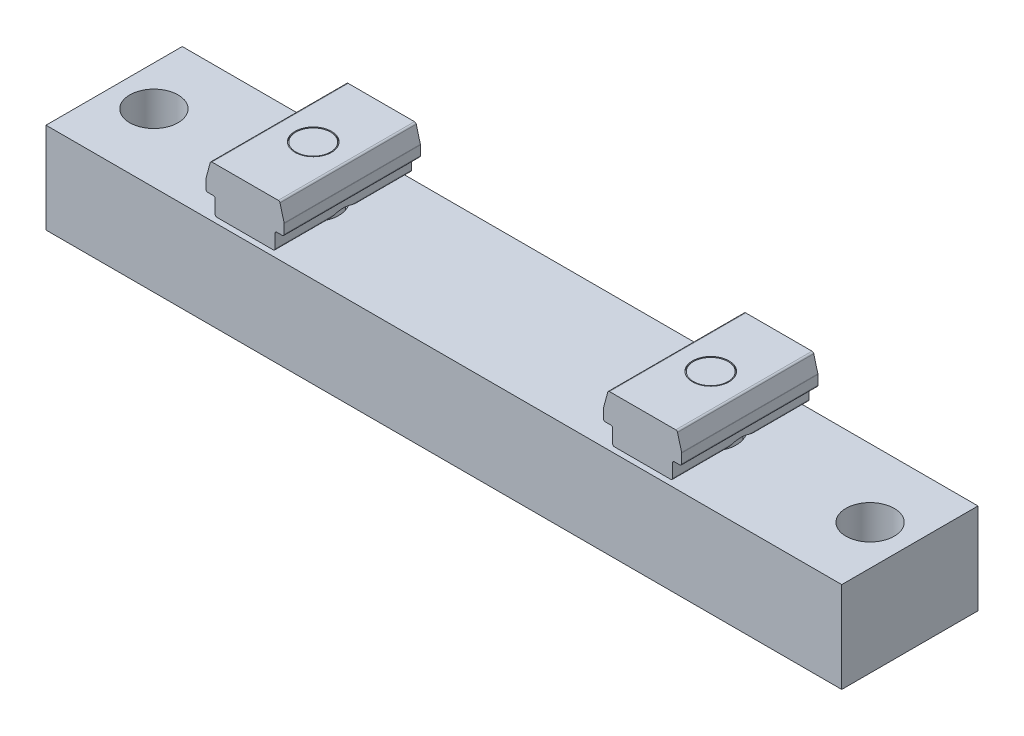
ISO-10303-21;
HEADER;
FILE_DESCRIPTION(('STEP AP214'),'2;1');
FILE_NAME('part.step','',(''),(''),'','','');
FILE_SCHEMA(('AUTOMOTIVE_DESIGN { 1 0 10303 214 1 1 1 1 }'));
ENDSEC;
DATA;
#1=APPLICATION_CONTEXT('core data for automotive mechanical design processes');
#2=APPLICATION_PROTOCOL_DEFINITION('international standard','automotive_design',2000,#1);
#3=PRODUCT_CONTEXT('',#1,'mechanical');
#4=PRODUCT('Part','Part','',(#3));
#5=PRODUCT_RELATED_PRODUCT_CATEGORY('part','',(#4));
#6=PRODUCT_DEFINITION_FORMATION('','',#4);
#7=PRODUCT_DEFINITION_CONTEXT('part definition',#1,'design');
#8=PRODUCT_DEFINITION('design','',#6,#7);
#9=PRODUCT_DEFINITION_SHAPE('','',#8);
#10=(LENGTH_UNIT() NAMED_UNIT(*) SI_UNIT(.MILLI.,.METRE.));
#11=(NAMED_UNIT(*) PLANE_ANGLE_UNIT() SI_UNIT($,.RADIAN.));
#12=(NAMED_UNIT(*) SI_UNIT($,.STERADIAN.) SOLID_ANGLE_UNIT());
#13=UNCERTAINTY_MEASURE_WITH_UNIT(LENGTH_MEASURE(1.E-05),#10,'distance_accuracy_value','');
#14=(GEOMETRIC_REPRESENTATION_CONTEXT(3) GLOBAL_UNCERTAINTY_ASSIGNED_CONTEXT((#13)) GLOBAL_UNIT_ASSIGNED_CONTEXT((#10,
#11,#12)) REPRESENTATION_CONTEXT('',''));
#15=CARTESIAN_POINT('',(0.,0.,0.));
#16=DIRECTION('',(0.,0.,1.));
#17=DIRECTION('',(1.,0.,0.));
#18=AXIS2_PLACEMENT_3D('',#15,#16,#17);
#19=CARTESIAN_POINT('',(55.626,-12.7,9.525));
#20=DIRECTION('',(0.,1.,0.));
#21=DIRECTION('',(0.,0.,1.));
#22=AXIS2_PLACEMENT_3D('',#19,#20,#21);
#23=PLANE('',#22);
#24=CARTESIAN_POINT('',(-27.7876,-12.7,0.));
#25=DIRECTION('',(0.,-1.,0.));
#26=DIRECTION('',(0.,0.,-1.));
#27=AXIS2_PLACEMENT_3D('',#24,#25,#26);
#28=CIRCLE('',#27,5.55625);
#29=CARTESIAN_POINT('',(-27.7876,-12.7,-5.55625));
#30=VERTEX_POINT('',#29);
#31=EDGE_CURVE('E2102',#30,#30,#28,.T.);
#32=ORIENTED_EDGE('',*,*,#31,.F.);
#33=EDGE_LOOP('',(#32));
#34=FACE_BOUND('',#33,.T.);
#35=CARTESIAN_POINT('',(27.7876,-12.7,0.));
#36=DIRECTION('',(0.,-1.,0.));
#37=DIRECTION('',(0.,0.,-1.));
#38=AXIS2_PLACEMENT_3D('',#35,#36,#37);
#39=CIRCLE('',#38,5.55625);
#40=CARTESIAN_POINT('',(27.7876,-12.7,-5.55625));
#41=VERTEX_POINT('',#40);
#42=EDGE_CURVE('E2114',#41,#41,#39,.T.);
#43=ORIENTED_EDGE('',*,*,#42,.F.);
#44=EDGE_LOOP('',(#43));
#45=FACE_BOUND('',#44,.T.);
#46=CARTESIAN_POINT('',(-50.0634,-12.7,0.));
#47=DIRECTION('',(0.,1.,0.));
#48=DIRECTION('',(0.,0.,1.));
#49=AXIS2_PLACEMENT_3D('',#46,#47,#48);
#50=CIRCLE('',#49,3.3782);
#51=CARTESIAN_POINT('',(-50.0634,-12.7,3.3782));
#52=VERTEX_POINT('',#51);
#53=EDGE_CURVE('E2117',#52,#52,#50,.T.);
#54=ORIENTED_EDGE('',*,*,#53,.T.);
#55=EDGE_LOOP('',(#54));
#56=FACE_BOUND('',#55,.T.);
#57=CARTESIAN_POINT('',(50.0634,-12.7,0.));
#58=DIRECTION('',(0.,1.,0.));
#59=DIRECTION('',(0.,0.,1.));
#60=AXIS2_PLACEMENT_3D('',#57,#58,#59);
#61=CIRCLE('',#60,3.3782);
#62=CARTESIAN_POINT('',(50.0634,-12.7,3.3782));
#63=VERTEX_POINT('',#62);
#64=EDGE_CURVE('E2123',#63,#63,#61,.T.);
#65=ORIENTED_EDGE('',*,*,#64,.T.);
#66=EDGE_LOOP('',(#65));
#67=FACE_BOUND('',#66,.T.);
#68=DIRECTION('',(0.,0.,-1.));
#69=VECTOR('',#68,1.);
#70=CARTESIAN_POINT('',(-55.626,-12.7,9.525));
#71=LINE('',#70,#69);
#72=CARTESIAN_POINT('',(-55.626,-12.7,9.525));
#73=VERTEX_POINT('',#72);
#74=CARTESIAN_POINT('',(-55.626,-12.7,-9.525));
#75=VERTEX_POINT('',#74);
#76=EDGE_CURVE('E2132',#73,#75,#71,.T.);
#77=ORIENTED_EDGE('',*,*,#76,.T.);
#78=DIRECTION('',(-1.,0.,0.));
#79=VECTOR('',#78,1.);
#80=CARTESIAN_POINT('',(55.626,-12.7,-9.525));
#81=LINE('',#80,#79);
#82=CARTESIAN_POINT('',(55.626,-12.7,-9.525));
#83=VERTEX_POINT('',#82);
#84=EDGE_CURVE('E2149',#83,#75,#81,.T.);
#85=ORIENTED_EDGE('',*,*,#84,.F.);
#86=DIRECTION('',(0.,0.,-1.));
#87=VECTOR('',#86,1.);
#88=CARTESIAN_POINT('',(55.626,-12.7,9.525));
#89=LINE('',#88,#87);
#90=CARTESIAN_POINT('',(55.626,-12.7,9.525));
#91=VERTEX_POINT('',#90);
#92=EDGE_CURVE('E2140',#91,#83,#89,.T.);
#93=ORIENTED_EDGE('',*,*,#92,.F.);
#94=DIRECTION('',(-1.,0.,0.));
#95=VECTOR('',#94,1.);
#96=CARTESIAN_POINT('',(55.626,-12.7,9.525));
#97=LINE('',#96,#95);
#98=EDGE_CURVE('E18',#91,#73,#97,.T.);
#99=ORIENTED_EDGE('',*,*,#98,.T.);
#100=EDGE_LOOP('',(#77,#85,#93,#99));
#101=FACE_BOUND('',#100,.T.);
#102=ADVANCED_FACE('F14',(#34,#45,#56,#67,#101),#23,.F.);
#103=CARTESIAN_POINT('',(-27.7876,-12.7,0.));
#104=DIRECTION('',(0.,-1.,0.));
#105=DIRECTION('',(0.,0.,-1.));
#106=AXIS2_PLACEMENT_3D('',#103,#104,#105);
#107=CYLINDRICAL_SURFACE('',#106,5.55625);
#108=CARTESIAN_POINT('',(-27.7876,-5.588,0.));
#109=DIRECTION('',(0.,-1.,0.));
#110=DIRECTION('',(0.,0.,-1.));
#111=AXIS2_PLACEMENT_3D('',#108,#109,#110);
#112=CIRCLE('',#111,5.55625);
#113=CARTESIAN_POINT('',(-27.7876,-5.588,-5.55625));
#114=VERTEX_POINT('',#113);
#115=EDGE_CURVE('E2099',#114,#114,#112,.T.);
#116=ORIENTED_EDGE('',*,*,#115,.F.);
#117=EDGE_LOOP('',(#116));
#118=FACE_BOUND('',#117,.T.);
#119=ORIENTED_EDGE('',*,*,#31,.T.);
#120=EDGE_LOOP('',(#119));
#121=FACE_BOUND('',#120,.T.);
#122=ADVANCED_FACE('F555',(#118,#121),#107,.F.);
#123=CARTESIAN_POINT('',(-24.21636,-5.588,0.));
#124=DIRECTION('',(0.,1.,0.));
#125=DIRECTION('',(0.,0.,1.));
#126=AXIS2_PLACEMENT_3D('',#123,#124,#125);
#127=PLANE('',#126);
#128=CARTESIAN_POINT('',(-27.7876,-5.588,0.));
#129=DIRECTION('',(0.,1.,0.));
#130=DIRECTION('',(0.866025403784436,0.,0.5));
#131=AXIS2_PLACEMENT_3D('',#128,#129,#130);
#132=CIRCLE('',#131,4.7625);
#133=CARTESIAN_POINT('',(-23.6631540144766,-5.588,2.38125));
#134=VERTEX_POINT('',#133);
#135=EDGE_CURVE('E23',#134,#134,#132,.T.);
#136=ORIENTED_EDGE('',*,*,#135,.T.);
#137=EDGE_LOOP('',(#136));
#138=FACE_BOUND('',#137,.T.);
#139=ORIENTED_EDGE('',*,*,#115,.T.);
#140=EDGE_LOOP('',(#139));
#141=FACE_BOUND('',#140,.T.);
#142=ADVANCED_FACE('F560',(#138,#141),#127,.F.);
#143=CARTESIAN_POINT('',(27.7876,-12.7,0.));
#144=DIRECTION('',(0.,-1.,0.));
#145=DIRECTION('',(0.,0.,-1.));
#146=AXIS2_PLACEMENT_3D('',#143,#144,#145);
#147=CYLINDRICAL_SURFACE('',#146,5.55625);
#148=CARTESIAN_POINT('',(27.7876,-5.588,0.));
#149=DIRECTION('',(0.,-1.,0.));
#150=DIRECTION('',(0.,0.,-1.));
#151=AXIS2_PLACEMENT_3D('',#148,#149,#150);
#152=CIRCLE('',#151,5.55625);
#153=CARTESIAN_POINT('',(27.7876,-5.588,-5.55625));
#154=VERTEX_POINT('',#153);
#155=EDGE_CURVE('E2111',#154,#154,#152,.T.);
#156=ORIENTED_EDGE('',*,*,#155,.F.);
#157=EDGE_LOOP('',(#156));
#158=FACE_BOUND('',#157,.T.);
#159=ORIENTED_EDGE('',*,*,#42,.T.);
#160=EDGE_LOOP('',(#159));
#161=FACE_BOUND('',#160,.T.);
#162=ADVANCED_FACE('F591',(#158,#161),#147,.F.);
#163=CARTESIAN_POINT('',(31.35884,-5.588,0.));
#164=DIRECTION('',(0.,1.,0.));
#165=DIRECTION('',(0.,0.,1.));
#166=AXIS2_PLACEMENT_3D('',#163,#164,#165);
#167=PLANE('',#166);
#168=CARTESIAN_POINT('',(27.7876,-5.588,0.));
#169=DIRECTION('',(0.,1.,0.));
#170=DIRECTION('',(0.866025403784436,0.,0.5));
#171=AXIS2_PLACEMENT_3D('',#168,#169,#170);
#172=CIRCLE('',#171,4.7625);
#173=CARTESIAN_POINT('',(31.9120459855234,-5.588,2.38125000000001));
#174=VERTEX_POINT('',#173);
#175=EDGE_CURVE('E9',#174,#174,#172,.T.);
#176=ORIENTED_EDGE('',*,*,#175,.T.);
#177=EDGE_LOOP('',(#176));
#178=FACE_BOUND('',#177,.T.);
#179=ORIENTED_EDGE('',*,*,#155,.T.);
#180=EDGE_LOOP('',(#179));
#181=FACE_BOUND('',#180,.T.);
#182=ADVANCED_FACE('F570',(#178,#181),#167,.F.);
#183=CARTESIAN_POINT('',(55.626,0.,-9.525));
#184=DIRECTION('',(0.,0.,1.));
#185=DIRECTION('',(0.,-1.,0.));
#186=AXIS2_PLACEMENT_3D('',#183,#184,#185);
#187=PLANE('',#186);
#188=DIRECTION('',(0.,1.,0.));
#189=VECTOR('',#188,1.);
#190=CARTESIAN_POINT('',(-55.626,0.,-9.525));
#191=LINE('',#190,#189);
#192=CARTESIAN_POINT('',(-55.626,0.,-9.525));
#193=VERTEX_POINT('',#192);
#194=EDGE_CURVE('E2134',#75,#193,#191,.T.);
#195=ORIENTED_EDGE('',*,*,#194,.T.);
#196=DIRECTION('',(-1.,0.,0.));
#197=VECTOR('',#196,1.);
#198=CARTESIAN_POINT('',(55.626,0.,-9.525));
#199=LINE('',#198,#197);
#200=CARTESIAN_POINT('',(55.626,0.,-9.525));
#201=VERTEX_POINT('',#200);
#202=EDGE_CURVE('E2147',#201,#193,#199,.T.);
#203=ORIENTED_EDGE('',*,*,#202,.F.);
#204=DIRECTION('',(0.,1.,0.));
#205=VECTOR('',#204,1.);
#206=CARTESIAN_POINT('',(55.626,0.,-9.525));
#207=LINE('',#206,#205);
#208=EDGE_CURVE('E36',#83,#201,#207,.T.);
#209=ORIENTED_EDGE('',*,*,#208,.F.);
#210=ORIENTED_EDGE('',*,*,#84,.T.);
#211=EDGE_LOOP('',(#195,#203,#209,#210));
#212=FACE_BOUND('',#211,.T.);
#213=ADVANCED_FACE('F566',(#212),#187,.F.);
#214=CARTESIAN_POINT('',(55.626,-12.7,9.525));
#215=DIRECTION('',(1.,0.,0.));
#216=DIRECTION('',(0.,0.,-1.));
#217=AXIS2_PLACEMENT_3D('',#214,#215,#216);
#218=PLANE('',#217);
#219=DIRECTION('',(0.,-1.,0.));
#220=VECTOR('',#219,1.);
#221=CARTESIAN_POINT('',(55.626,0.,9.525));
#222=LINE('',#221,#220);
#223=CARTESIAN_POINT('',(55.626,0.,9.525));
#224=VERTEX_POINT('',#223);
#225=EDGE_CURVE('E2138',#224,#91,#222,.T.);
#226=ORIENTED_EDGE('',*,*,#225,.T.);
#227=ORIENTED_EDGE('',*,*,#92,.T.);
#228=ORIENTED_EDGE('',*,*,#208,.T.);
#229=DIRECTION('',(0.,0.,1.));
#230=VECTOR('',#229,1.);
#231=CARTESIAN_POINT('',(55.626,0.,9.525));
#232=LINE('',#231,#230);
#233=EDGE_CURVE('E31',#201,#224,#232,.T.);
#234=ORIENTED_EDGE('',*,*,#233,.T.);
#235=EDGE_LOOP('',(#226,#227,#228,#234));
#236=FACE_BOUND('',#235,.T.);
#237=ADVANCED_FACE('F569',(#236),#218,.T.);
#238=CARTESIAN_POINT('',(55.626,0.,9.525));
#239=DIRECTION('',(0.,0.,-1.));
#240=DIRECTION('',(0.,1.,0.));
#241=AXIS2_PLACEMENT_3D('',#238,#239,#240);
#242=PLANE('',#241);
#243=DIRECTION('',(0.,-1.,0.));
#244=VECTOR('',#243,1.);
#245=CARTESIAN_POINT('',(-55.626,0.,9.525));
#246=LINE('',#245,#244);
#247=CARTESIAN_POINT('',(-55.626,0.,9.525));
#248=VERTEX_POINT('',#247);
#249=EDGE_CURVE('E2129',#248,#73,#246,.T.);
#250=ORIENTED_EDGE('',*,*,#249,.T.);
#251=ORIENTED_EDGE('',*,*,#98,.F.);
#252=ORIENTED_EDGE('',*,*,#225,.F.);
#253=DIRECTION('',(-1.,0.,0.));
#254=VECTOR('',#253,1.);
#255=CARTESIAN_POINT('',(55.626,0.,9.525));
#256=LINE('',#255,#254);
#257=EDGE_CURVE('E2144',#224,#248,#256,.T.);
#258=ORIENTED_EDGE('',*,*,#257,.T.);
#259=EDGE_LOOP('',(#250,#251,#252,#258));
#260=FACE_BOUND('',#259,.T.);
#261=ADVANCED_FACE('F16',(#260),#242,.F.);
#262=CARTESIAN_POINT('',(-55.626,-12.7,9.525));
#263=DIRECTION('',(1.,0.,0.));
#264=DIRECTION('',(0.,0.,-1.));
#265=AXIS2_PLACEMENT_3D('',#262,#263,#264);
#266=PLANE('',#265);
#267=ORIENTED_EDGE('',*,*,#249,.F.);
#268=DIRECTION('',(0.,0.,1.));
#269=VECTOR('',#268,1.);
#270=CARTESIAN_POINT('',(-55.626,0.,9.525));
#271=LINE('',#270,#269);
#272=EDGE_CURVE('E2136',#193,#248,#271,.T.);
#273=ORIENTED_EDGE('',*,*,#272,.F.);
#274=ORIENTED_EDGE('',*,*,#194,.F.);
#275=ORIENTED_EDGE('',*,*,#76,.F.);
#276=EDGE_LOOP('',(#267,#273,#274,#275));
#277=FACE_BOUND('',#276,.T.);
#278=ADVANCED_FACE('F580',(#277),#266,.F.);
#279=CARTESIAN_POINT('',(50.0634,0.,0.));
#280=DIRECTION('',(0.,1.,0.));
#281=DIRECTION('',(0.,0.,1.));
#282=AXIS2_PLACEMENT_3D('',#279,#280,#281);
#283=CYLINDRICAL_SURFACE('',#282,3.3782);
#284=ORIENTED_EDGE('',*,*,#64,.F.);
#285=EDGE_LOOP('',(#284));
#286=FACE_BOUND('',#285,.T.);
#287=CARTESIAN_POINT('',(50.0634,0.,0.));
#288=DIRECTION('',(0.,1.,0.));
#289=DIRECTION('',(0.,0.,1.));
#290=AXIS2_PLACEMENT_3D('',#287,#288,#289);
#291=CIRCLE('',#290,3.3782);
#292=CARTESIAN_POINT('',(50.0634,0.,3.3782));
#293=VERTEX_POINT('',#292);
#294=EDGE_CURVE('E2126',#293,#293,#291,.T.);
#295=ORIENTED_EDGE('',*,*,#294,.T.);
#296=EDGE_LOOP('',(#295));
#297=FACE_BOUND('',#296,.T.);
#298=ADVANCED_FACE('F583',(#286,#297),#283,.F.);
#299=CARTESIAN_POINT('',(-50.0634,0.,0.));
#300=DIRECTION('',(0.,1.,0.));
#301=DIRECTION('',(0.,0.,1.));
#302=AXIS2_PLACEMENT_3D('',#299,#300,#301);
#303=CYLINDRICAL_SURFACE('',#302,3.3782);
#304=ORIENTED_EDGE('',*,*,#53,.F.);
#305=EDGE_LOOP('',(#304));
#306=FACE_BOUND('',#305,.T.);
#307=CARTESIAN_POINT('',(-50.0634,0.,0.));
#308=DIRECTION('',(0.,1.,0.));
#309=DIRECTION('',(0.,0.,1.));
#310=AXIS2_PLACEMENT_3D('',#307,#308,#309);
#311=CIRCLE('',#310,3.3782);
#312=CARTESIAN_POINT('',(-50.0634,0.,3.3782));
#313=VERTEX_POINT('',#312);
#314=EDGE_CURVE('E2120',#313,#313,#311,.T.);
#315=ORIENTED_EDGE('',*,*,#314,.T.);
#316=EDGE_LOOP('',(#315));
#317=FACE_BOUND('',#316,.T.);
#318=ADVANCED_FACE('F576',(#306,#317),#303,.F.);
#319=CARTESIAN_POINT('',(55.626,0.,9.525));
#320=DIRECTION('',(0.,-1.,0.));
#321=DIRECTION('',(0.,0.,-1.));
#322=AXIS2_PLACEMENT_3D('',#319,#320,#321);
#323=PLANE('',#322);
#324=CARTESIAN_POINT('',(-27.7876,0.,0.));
#325=DIRECTION('',(0.,-1.,0.));
#326=DIRECTION('',(0.,0.,-1.));
#327=AXIS2_PLACEMENT_3D('',#324,#325,#326);
#328=CIRCLE('',#327,3.57124);
#329=CARTESIAN_POINT('',(-27.7876,0.,-3.57124));
#330=VERTEX_POINT('',#329);
#331=EDGE_CURVE('E2087',#330,#330,#328,.T.);
#332=ORIENTED_EDGE('',*,*,#331,.T.);
#333=EDGE_LOOP('',(#332));
#334=FACE_BOUND('',#333,.T.);
#335=CARTESIAN_POINT('',(27.7876,0.,0.));
#336=DIRECTION('',(0.,-1.,0.));
#337=DIRECTION('',(0.,0.,-1.));
#338=AXIS2_PLACEMENT_3D('',#335,#336,#337);
#339=CIRCLE('',#338,3.57124);
#340=CARTESIAN_POINT('',(27.7876,0.,-3.57124));
#341=VERTEX_POINT('',#340);
#342=EDGE_CURVE('E2105',#341,#341,#339,.T.);
#343=ORIENTED_EDGE('',*,*,#342,.T.);
#344=EDGE_LOOP('',(#343));
#345=FACE_BOUND('',#344,.T.);
#346=ORIENTED_EDGE('',*,*,#314,.F.);
#347=EDGE_LOOP('',(#346));
#348=FACE_BOUND('',#347,.T.);
#349=ORIENTED_EDGE('',*,*,#294,.F.);
#350=EDGE_LOOP('',(#349));
#351=FACE_BOUND('',#350,.T.);
#352=ORIENTED_EDGE('',*,*,#272,.T.);
#353=ORIENTED_EDGE('',*,*,#257,.F.);
#354=ORIENTED_EDGE('',*,*,#233,.F.);
#355=ORIENTED_EDGE('',*,*,#202,.T.);
#356=EDGE_LOOP('',(#352,#353,#354,#355));
#357=FACE_BOUND('',#356,.T.);
#358=ADVANCED_FACE('F572',(#334,#345,#348,#351,#357),#323,.F.);
#359=CARTESIAN_POINT('',(-27.7876,-12.7,0.));
#360=DIRECTION('',(0.,-1.,0.));
#361=DIRECTION('',(0.,0.,-1.));
#362=AXIS2_PLACEMENT_3D('',#359,#360,#361);
#363=CYLINDRICAL_SURFACE('',#362,3.57124);
#364=ORIENTED_EDGE('',*,*,#331,.F.);
#365=EDGE_LOOP('',(#364));
#366=FACE_BOUND('',#365,.T.);
#367=CARTESIAN_POINT('',(-27.7876,-5.588,0.));
#368=DIRECTION('',(0.,-1.,0.));
#369=DIRECTION('',(0.,0.,-1.));
#370=AXIS2_PLACEMENT_3D('',#367,#368,#369);
#371=CIRCLE('',#370,3.57124);
#372=CARTESIAN_POINT('',(-27.7876,-5.588,-3.57124));
#373=VERTEX_POINT('',#372);
#374=EDGE_CURVE('E2091',#373,#373,#371,.T.);
#375=ORIENTED_EDGE('',*,*,#374,.T.);
#376=EDGE_LOOP('',(#375));
#377=FACE_BOUND('',#376,.T.);
#378=ADVANCED_FACE('F575',(#366,#377),#363,.F.);
#379=CARTESIAN_POINT('',(27.7876,-12.7,0.));
#380=DIRECTION('',(0.,-1.,0.));
#381=DIRECTION('',(0.,0.,-1.));
#382=AXIS2_PLACEMENT_3D('',#379,#380,#381);
#383=CYLINDRICAL_SURFACE('',#382,3.57124);
#384=ORIENTED_EDGE('',*,*,#342,.F.);
#385=EDGE_LOOP('',(#384));
#386=FACE_BOUND('',#385,.T.);
#387=CARTESIAN_POINT('',(27.7876,-5.588,0.));
#388=DIRECTION('',(0.,-1.,0.));
#389=DIRECTION('',(0.,0.,-1.));
#390=AXIS2_PLACEMENT_3D('',#387,#388,#389);
#391=CIRCLE('',#390,3.57124);
#392=CARTESIAN_POINT('',(27.7876,-5.588,-3.57124));
#393=VERTEX_POINT('',#392);
#394=EDGE_CURVE('E2108',#393,#393,#391,.T.);
#395=ORIENTED_EDGE('',*,*,#394,.T.);
#396=EDGE_LOOP('',(#395));
#397=FACE_BOUND('',#396,.T.);
#398=ADVANCED_FACE('F598',(#386,#397),#383,.F.);
#399=CARTESIAN_POINT('',(-27.7876,7.112,0.));
#400=DIRECTION('',(0.,-1.,0.));
#401=DIRECTION('',(-0.866025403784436,0.,-0.5));
#402=AXIS2_PLACEMENT_3D('',#399,#400,#401);
#403=PLANE('',#402);
#404=CARTESIAN_POINT('',(-27.7876,7.112,0.));
#405=DIRECTION('',(0.,-1.,0.));
#406=DIRECTION('',(-0.866025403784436,0.,-0.5));
#407=AXIS2_PLACEMENT_3D('',#404,#405,#406);
#408=CIRCLE('',#407,2.41935);
#409=CARTESIAN_POINT('',(-29.8828185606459,7.112,-1.209675));
#410=VERTEX_POINT('',#409);
#411=EDGE_CURVE('E2278',#410,#410,#408,.T.);
#412=ORIENTED_EDGE('',*,*,#411,.F.);
#413=EDGE_LOOP('',(#412));
#414=FACE_BOUND('',#413,.T.);
#415=ADVANCED_FACE('F600',(#414),#403,.F.);
#416=CARTESIAN_POINT('',(-27.7876,7.112,0.));
#417=DIRECTION('',(0.,-1.,0.));
#418=DIRECTION('',(-0.866025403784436,0.,-0.5));
#419=AXIS2_PLACEMENT_3D('',#416,#417,#418);
#420=CONICAL_SURFACE('',#419,2.41935,0.785398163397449);
#421=ORIENTED_EDGE('',*,*,#411,.T.);
#422=EDGE_LOOP('',(#421));
#423=FACE_BOUND('',#422,.T.);
#424=CARTESIAN_POINT('',(-27.7876,6.97865,0.));
#425=DIRECTION('',(0.,-1.,0.));
#426=DIRECTION('',(1.,0.,0.));
#427=AXIS2_PLACEMENT_3D('',#424,#425,#426);
#428=CIRCLE('',#427,2.5527);
#429=CARTESIAN_POINT('',(-25.2349,6.97865,0.));
#430=VERTEX_POINT('',#429);
#431=EDGE_CURVE('E2166',#430,#430,#428,.T.);
#432=ORIENTED_EDGE('',*,*,#431,.F.);
#433=EDGE_LOOP('',(#432));
#434=FACE_BOUND('',#433,.T.);
#435=ADVANCED_FACE('F687',(#423,#434),#420,.T.);
#436=CARTESIAN_POINT('',(-27.7876,0.787399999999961,0.));
#437=DIRECTION('',(0.,-1.,0.));
#438=DIRECTION('',(0.,0.,-1.));
#439=AXIS2_PLACEMENT_3D('',#436,#437,#438);
#440=CYLINDRICAL_SURFACE('',#439,2.5527);
#441=CARTESIAN_POINT('',(-27.7876,7.1374,0.));
#442=DIRECTION('',(0.,-1.,0.));
#443=DIRECTION('',(0.,0.,-1.));
#444=AXIS2_PLACEMENT_3D('',#441,#442,#443);
#445=CIRCLE('',#444,2.5527);
#446=CARTESIAN_POINT('',(-27.7876,7.1374,-2.5527));
#447=VERTEX_POINT('',#446);
#448=EDGE_CURVE('E1071',#447,#447,#445,.T.);
#449=ORIENTED_EDGE('',*,*,#448,.F.);
#450=EDGE_LOOP('',(#449));
#451=FACE_BOUND('',#450,.T.);
#452=ORIENTED_EDGE('',*,*,#431,.T.);
#453=EDGE_LOOP('',(#452));
#454=FACE_BOUND('',#453,.T.);
#455=ADVANCED_FACE('F691',(#451,#454),#440,.F.);
#456=CARTESIAN_POINT('',(-33.2399451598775,4.8075003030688,-9.525));
#457=DIRECTION('',(-0.965925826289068,0.258819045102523,0.));
#458=DIRECTION('',(-0.258819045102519,-0.965925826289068,0.));
#459=AXIS2_PLACEMENT_3D('',#456,#457,#458);
#460=PLANE('',#459);
#461=DIRECTION('',(-0.258819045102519,-0.965925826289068,0.));
#462=VECTOR('',#461,1.);
#463=CARTESIAN_POINT('',(-33.2399451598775,4.8075003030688,9.525));
#464=LINE('',#463,#462);
#465=CARTESIAN_POINT('',(-32.6660945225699,6.949140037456,9.525));
#466=VERTEX_POINT('',#465);
#467=CARTESIAN_POINT('',(-33.2399451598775,4.8075003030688,9.525));
#468=VERTEX_POINT('',#467);
#469=EDGE_CURVE('E1042',#466,#468,#464,.T.);
#470=ORIENTED_EDGE('',*,*,#469,.F.);
#471=DIRECTION('',(0.,0.,1.));
#472=VECTOR('',#471,1.);
#473=CARTESIAN_POINT('',(-32.6660945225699,6.949140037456,-9.525));
#474=LINE('',#473,#472);
#475=CARTESIAN_POINT('',(-32.6660945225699,6.949140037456,-9.525));
#476=VERTEX_POINT('',#475);
#477=EDGE_CURVE('E891',#476,#466,#474,.T.);
#478=ORIENTED_EDGE('',*,*,#477,.F.);
#479=DIRECTION('',(-0.258819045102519,-0.965925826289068,0.));
#480=VECTOR('',#479,1.);
#481=CARTESIAN_POINT('',(-33.2399451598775,4.8075003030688,-9.525));
#482=LINE('',#481,#480);
#483=CARTESIAN_POINT('',(-33.2399451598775,4.8075003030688,-9.525));
#484=VERTEX_POINT('',#483);
#485=EDGE_CURVE('E968',#476,#484,#482,.T.);
#486=ORIENTED_EDGE('',*,*,#485,.T.);
#487=DIRECTION('',(0.,0.,1.));
#488=VECTOR('',#487,1.);
#489=CARTESIAN_POINT('',(-33.2399451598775,4.8075003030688,-9.525));
#490=LINE('',#489,#488);
#491=EDGE_CURVE('E890',#484,#468,#490,.T.);
#492=ORIENTED_EDGE('',*,*,#491,.T.);
#493=EDGE_LOOP('',(#470,#478,#486,#492));
#494=FACE_BOUND('',#493,.T.);
#495=ADVANCED_FACE('F672',(#494),#460,.T.);
#496=CARTESIAN_POINT('',(-32.9946,4.74176026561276,-9.525));
#497=DIRECTION('',(0.,0.,1.));
#498=DIRECTION('',(0.,-1.,0.));
#499=AXIS2_PLACEMENT_3D('',#496,#497,#498);
#500=CYLINDRICAL_SURFACE('',#499,0.254);
#501=CARTESIAN_POINT('',(-32.9946,4.74176026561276,9.525));
#502=DIRECTION('',(0.,0.,1.));
#503=DIRECTION('',(0.,1.,0.));
#504=AXIS2_PLACEMENT_3D('',#501,#502,#503);
#505=CIRCLE('',#504,0.254);
#506=CARTESIAN_POINT('',(-33.2486,4.74176026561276,9.525));
#507=VERTEX_POINT('',#506);
#508=EDGE_CURVE('E1043',#468,#507,#505,.T.);
#509=ORIENTED_EDGE('',*,*,#508,.F.);
#510=ORIENTED_EDGE('',*,*,#491,.F.);
#511=CARTESIAN_POINT('',(-32.9946,4.74176026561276,-9.525));
#512=DIRECTION('',(0.,0.,1.));
#513=DIRECTION('',(0.,1.,0.));
#514=AXIS2_PLACEMENT_3D('',#511,#512,#513);
#515=CIRCLE('',#514,0.254);
#516=CARTESIAN_POINT('',(-33.2486,4.74176026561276,-9.525));
#517=VERTEX_POINT('',#516);
#518=EDGE_CURVE('E971',#484,#517,#515,.T.);
#519=ORIENTED_EDGE('',*,*,#518,.T.);
#520=DIRECTION('',(0.,0.,1.));
#521=VECTOR('',#520,1.);
#522=CARTESIAN_POINT('',(-33.2486,4.74176026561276,-9.525));
#523=LINE('',#522,#521);
#524=EDGE_CURVE('E888',#517,#507,#523,.T.);
#525=ORIENTED_EDGE('',*,*,#524,.T.);
#526=EDGE_LOOP('',(#509,#510,#519,#525));
#527=FACE_BOUND('',#526,.T.);
#528=ADVANCED_FACE('F733',(#527),#500,.T.);
#529=CARTESIAN_POINT('',(-33.2486,3.42899999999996,-9.525));
#530=DIRECTION('',(-1.,0.,0.));
#531=DIRECTION('',(0.,-1.,0.));
#532=AXIS2_PLACEMENT_3D('',#529,#530,#531);
#533=PLANE('',#532);
#534=DIRECTION('',(0.,-1.,0.));
#535=VECTOR('',#534,1.);
#536=CARTESIAN_POINT('',(-33.2486,3.42899999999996,9.525));
#537=LINE('',#536,#535);
#538=CARTESIAN_POINT('',(-33.2486,3.42899999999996,9.525));
#539=VERTEX_POINT('',#538);
#540=EDGE_CURVE('E1048',#507,#539,#537,.T.);
#541=ORIENTED_EDGE('',*,*,#540,.F.);
#542=ORIENTED_EDGE('',*,*,#524,.F.);
#543=DIRECTION('',(0.,-1.,0.));
#544=VECTOR('',#543,1.);
#545=CARTESIAN_POINT('',(-33.2486,3.42899999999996,-9.525));
#546=LINE('',#545,#544);
#547=CARTESIAN_POINT('',(-33.2486,3.42899999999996,-9.525));
#548=VERTEX_POINT('',#547);
#549=EDGE_CURVE('E974',#517,#548,#546,.T.);
#550=ORIENTED_EDGE('',*,*,#549,.T.);
#551=DIRECTION('',(0.,0.,1.));
#552=VECTOR('',#551,1.);
#553=CARTESIAN_POINT('',(-33.2486,3.42899999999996,-9.525));
#554=LINE('',#553,#552);
#555=EDGE_CURVE('E886',#548,#539,#554,.T.);
#556=ORIENTED_EDGE('',*,*,#555,.T.);
#557=EDGE_LOOP('',(#541,#542,#550,#556));
#558=FACE_BOUND('',#557,.T.);
#559=ADVANCED_FACE('F737',(#558),#533,.T.);
#560=CARTESIAN_POINT('',(-32.9946,3.42899999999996,-9.525));
#561=DIRECTION('',(0.,0.,1.));
#562=DIRECTION('',(0.,-1.,0.));
#563=AXIS2_PLACEMENT_3D('',#560,#561,#562);
#564=CYLINDRICAL_SURFACE('',#563,0.254);
#565=CARTESIAN_POINT('',(-32.9946,3.42899999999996,9.525));
#566=DIRECTION('',(0.,0.,1.));
#567=DIRECTION('',(0.,1.,0.));
#568=AXIS2_PLACEMENT_3D('',#565,#566,#567);
#569=CIRCLE('',#568,0.254);
#570=CARTESIAN_POINT('',(-32.9946,3.17499999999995,9.525));
#571=VERTEX_POINT('',#570);
#572=EDGE_CURVE('E1051',#539,#571,#569,.T.);
#573=ORIENTED_EDGE('',*,*,#572,.F.);
#574=ORIENTED_EDGE('',*,*,#555,.F.);
#575=CARTESIAN_POINT('',(-32.9946,3.42899999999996,-9.525));
#576=DIRECTION('',(0.,0.,1.));
#577=DIRECTION('',(0.,1.,0.));
#578=AXIS2_PLACEMENT_3D('',#575,#576,#577);
#579=CIRCLE('',#578,0.254);
#580=CARTESIAN_POINT('',(-32.9946,3.17499999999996,-9.525));
#581=VERTEX_POINT('',#580);
#582=EDGE_CURVE('E977',#548,#581,#579,.T.);
#583=ORIENTED_EDGE('',*,*,#582,.T.);
#584=DIRECTION('',(0.,0.,1.));
#585=VECTOR('',#584,1.);
#586=CARTESIAN_POINT('',(-32.9946,3.17499999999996,-9.525));
#587=LINE('',#586,#585);
#588=EDGE_CURVE('E884',#581,#571,#587,.T.);
#589=ORIENTED_EDGE('',*,*,#588,.T.);
#590=EDGE_LOOP('',(#573,#574,#583,#589));
#591=FACE_BOUND('',#590,.T.);
#592=ADVANCED_FACE('F741',(#591),#564,.T.);
#593=CARTESIAN_POINT('',(-32.2326,3.17499999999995,-9.525));
#594=DIRECTION('',(0.,-1.,0.));
#595=DIRECTION('',(1.,0.,0.));
#596=AXIS2_PLACEMENT_3D('',#593,#594,#595);
#597=PLANE('',#596);
#598=DIRECTION('',(1.,0.,0.));
#599=VECTOR('',#598,1.);
#600=CARTESIAN_POINT('',(-32.2326,3.17499999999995,9.525));
#601=LINE('',#600,#599);
#602=CARTESIAN_POINT('',(-32.2326,3.17499999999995,9.525));
#603=VERTEX_POINT('',#602);
#604=EDGE_CURVE('E1054',#571,#603,#601,.T.);
#605=ORIENTED_EDGE('',*,*,#604,.F.);
#606=ORIENTED_EDGE('',*,*,#588,.F.);
#607=DIRECTION('',(1.,0.,0.));
#608=VECTOR('',#607,1.);
#609=CARTESIAN_POINT('',(-32.2326,3.17499999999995,-9.525));
#610=LINE('',#609,#608);
#611=CARTESIAN_POINT('',(-32.2326,3.17499999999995,-9.525));
#612=VERTEX_POINT('',#611);
#613=EDGE_CURVE('E980',#581,#612,#610,.T.);
#614=ORIENTED_EDGE('',*,*,#613,.T.);
#615=DIRECTION('',(0.,0.,1.));
#616=VECTOR('',#615,1.);
#617=CARTESIAN_POINT('',(-32.2326,3.17499999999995,-9.525));
#618=LINE('',#617,#616);
#619=EDGE_CURVE('E882',#612,#603,#618,.T.);
#620=ORIENTED_EDGE('',*,*,#619,.T.);
#621=EDGE_LOOP('',(#605,#606,#614,#620));
#622=FACE_BOUND('',#621,.T.);
#623=ADVANCED_FACE('F745',(#622),#597,.T.);
#624=CARTESIAN_POINT('',(-23.3426,3.1749999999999,-9.525));
#625=DIRECTION('',(0.,-1.,0.));
#626=DIRECTION('',(1.,0.,0.));
#627=AXIS2_PLACEMENT_3D('',#624,#625,#626);
#628=PLANE('',#627);
#629=DIRECTION('',(1.,0.,0.));
#630=VECTOR('',#629,1.);
#631=CARTESIAN_POINT('',(-23.3426,3.1749999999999,9.525));
#632=LINE('',#631,#630);
#633=CARTESIAN_POINT('',(-23.3426,3.1749999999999,9.525));
#634=VERTEX_POINT('',#633);
#635=CARTESIAN_POINT('',(-22.5806,3.1749999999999,9.525));
#636=VERTEX_POINT('',#635);
#637=EDGE_CURVE('E945',#634,#636,#632,.T.);
#638=ORIENTED_EDGE('',*,*,#637,.F.);
#639=DIRECTION('',(0.,0.,1.));
#640=VECTOR('',#639,1.);
#641=CARTESIAN_POINT('',(-23.3426,3.1749999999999,-9.525));
#642=LINE('',#641,#640);
#643=CARTESIAN_POINT('',(-23.3426,3.1749999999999,-9.525));
#644=VERTEX_POINT('',#643);
#645=EDGE_CURVE('E920',#644,#634,#642,.T.);
#646=ORIENTED_EDGE('',*,*,#645,.F.);
#647=DIRECTION('',(1.,0.,0.));
#648=VECTOR('',#647,1.);
#649=CARTESIAN_POINT('',(-23.3426,3.1749999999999,-9.525));
#650=LINE('',#649,#648);
#651=CARTESIAN_POINT('',(-22.5806,3.1749999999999,-9.525));
#652=VERTEX_POINT('',#651);
#653=EDGE_CURVE('E1002',#644,#652,#650,.T.);
#654=ORIENTED_EDGE('',*,*,#653,.T.);
#655=DIRECTION('',(0.,0.,1.));
#656=VECTOR('',#655,1.);
#657=CARTESIAN_POINT('',(-22.5806,3.1749999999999,-9.525));
#658=LINE('',#657,#656);
#659=EDGE_CURVE('E918',#652,#636,#658,.T.);
#660=ORIENTED_EDGE('',*,*,#659,.T.);
#661=EDGE_LOOP('',(#638,#646,#654,#660));
#662=FACE_BOUND('',#661,.T.);
#663=ADVANCED_FACE('F749',(#662),#628,.T.);
#664=CARTESIAN_POINT('',(-22.5806,3.4289999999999,-9.525));
#665=DIRECTION('',(0.,0.,1.));
#666=DIRECTION('',(0.,-1.,0.));
#667=AXIS2_PLACEMENT_3D('',#664,#665,#666);
#668=CYLINDRICAL_SURFACE('',#667,0.254);
#669=CARTESIAN_POINT('',(-22.5806,3.4289999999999,9.525));
#670=DIRECTION('',(0.,0.,1.));
#671=DIRECTION('',(0.,-1.,0.));
#672=AXIS2_PLACEMENT_3D('',#669,#670,#671);
#673=CIRCLE('',#672,0.254);
#674=CARTESIAN_POINT('',(-22.3266,3.4289999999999,9.525));
#675=VERTEX_POINT('',#674);
#676=EDGE_CURVE('E948',#636,#675,#673,.T.);
#677=ORIENTED_EDGE('',*,*,#676,.F.);
#678=ORIENTED_EDGE('',*,*,#659,.F.);
#679=CARTESIAN_POINT('',(-22.5806,3.4289999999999,-9.525));
#680=DIRECTION('',(0.,0.,1.));
#681=DIRECTION('',(0.,-1.,0.));
#682=AXIS2_PLACEMENT_3D('',#679,#680,#681);
#683=CIRCLE('',#682,0.254);
#684=CARTESIAN_POINT('',(-22.3266,3.4289999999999,-9.525));
#685=VERTEX_POINT('',#684);
#686=EDGE_CURVE('E1005',#652,#685,#683,.T.);
#687=ORIENTED_EDGE('',*,*,#686,.T.);
#688=DIRECTION('',(0.,0.,1.));
#689=VECTOR('',#688,1.);
#690=CARTESIAN_POINT('',(-22.3266,3.4289999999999,-9.525));
#691=LINE('',#690,#689);
#692=EDGE_CURVE('E916',#685,#675,#691,.T.);
#693=ORIENTED_EDGE('',*,*,#692,.T.);
#694=EDGE_LOOP('',(#677,#678,#687,#693));
#695=FACE_BOUND('',#694,.T.);
#696=ADVANCED_FACE('F1032',(#695),#668,.T.);
#697=CARTESIAN_POINT('',(-22.3266,3.4289999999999,-9.525));
#698=DIRECTION('',(1.,0.,0.));
#699=DIRECTION('',(0.,1.,0.));
#700=AXIS2_PLACEMENT_3D('',#697,#698,#699);
#701=PLANE('',#700);
#702=DIRECTION('',(0.,1.,0.));
#703=VECTOR('',#702,1.);
#704=CARTESIAN_POINT('',(-22.3266,3.4289999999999,9.525));
#705=LINE('',#704,#703);
#706=CARTESIAN_POINT('',(-22.3266,4.74176026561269,9.525));
#707=VERTEX_POINT('',#706);
#708=EDGE_CURVE('E951',#675,#707,#705,.T.);
#709=ORIENTED_EDGE('',*,*,#708,.F.);
#710=ORIENTED_EDGE('',*,*,#692,.F.);
#711=DIRECTION('',(0.,1.,0.));
#712=VECTOR('',#711,1.);
#713=CARTESIAN_POINT('',(-22.3266,3.4289999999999,-9.525));
#714=LINE('',#713,#712);
#715=CARTESIAN_POINT('',(-22.3266,4.74176026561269,-9.525));
#716=VERTEX_POINT('',#715);
#717=EDGE_CURVE('E1008',#685,#716,#714,.T.);
#718=ORIENTED_EDGE('',*,*,#717,.T.);
#719=DIRECTION('',(0.,0.,1.));
#720=VECTOR('',#719,1.);
#721=CARTESIAN_POINT('',(-22.3266,4.74176026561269,-9.525));
#722=LINE('',#721,#720);
#723=EDGE_CURVE('E914',#716,#707,#722,.T.);
#724=ORIENTED_EDGE('',*,*,#723,.T.);
#725=EDGE_LOOP('',(#709,#710,#718,#724));
#726=FACE_BOUND('',#725,.T.);
#727=ADVANCED_FACE('F1027',(#726),#701,.T.);
#728=CARTESIAN_POINT('',(-22.5806,4.74176026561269,-9.525));
#729=DIRECTION('',(0.,0.,1.));
#730=DIRECTION('',(0.,-1.,0.));
#731=AXIS2_PLACEMENT_3D('',#728,#729,#730);
#732=CYLINDRICAL_SURFACE('',#731,0.254);
#733=CARTESIAN_POINT('',(-22.5806,4.74176026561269,9.525));
#734=DIRECTION('',(0.,0.,1.));
#735=DIRECTION('',(0.,-1.,0.));
#736=AXIS2_PLACEMENT_3D('',#733,#734,#735);
#737=CIRCLE('',#736,0.254);
#738=CARTESIAN_POINT('',(-22.3352548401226,4.80750030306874,9.525));
#739=VERTEX_POINT('',#738);
#740=EDGE_CURVE('E954',#707,#739,#737,.T.);
#741=ORIENTED_EDGE('',*,*,#740,.F.);
#742=ORIENTED_EDGE('',*,*,#723,.F.);
#743=CARTESIAN_POINT('',(-22.5806,4.74176026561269,-9.525));
#744=DIRECTION('',(0.,0.,1.));
#745=DIRECTION('',(0.,-1.,0.));
#746=AXIS2_PLACEMENT_3D('',#743,#744,#745);
#747=CIRCLE('',#746,0.254);
#748=CARTESIAN_POINT('',(-22.3352548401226,4.80750030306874,-9.525));
#749=VERTEX_POINT('',#748);
#750=EDGE_CURVE('E1011',#716,#749,#747,.T.);
#751=ORIENTED_EDGE('',*,*,#750,.T.);
#752=DIRECTION('',(0.,0.,1.));
#753=VECTOR('',#752,1.);
#754=CARTESIAN_POINT('',(-22.3352548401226,4.80750030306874,-9.525));
#755=LINE('',#754,#753);
#756=EDGE_CURVE('E912',#749,#739,#755,.T.);
#757=ORIENTED_EDGE('',*,*,#756,.T.);
#758=EDGE_LOOP('',(#741,#742,#751,#757));
#759=FACE_BOUND('',#758,.T.);
#760=ADVANCED_FACE('F1024',(#759),#732,.T.);
#761=CARTESIAN_POINT('',(-22.3352548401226,4.80750030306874,-9.525));
#762=DIRECTION('',(0.965925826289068,0.258819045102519,0.));
#763=DIRECTION('',(-0.258819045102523,0.965925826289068,0.));
#764=AXIS2_PLACEMENT_3D('',#761,#762,#763);
#765=PLANE('',#764);
#766=DIRECTION('',(-0.258819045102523,0.965925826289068,0.));
#767=VECTOR('',#766,1.);
#768=CARTESIAN_POINT('',(-22.3352548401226,4.80750030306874,9.525));
#769=LINE('',#768,#767);
#770=CARTESIAN_POINT('',(-22.90910547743,6.94914003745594,9.525));
#771=VERTEX_POINT('',#770);
#772=EDGE_CURVE('E957',#739,#771,#769,.T.);
#773=ORIENTED_EDGE('',*,*,#772,.F.);
#774=ORIENTED_EDGE('',*,*,#756,.F.);
#775=DIRECTION('',(-0.258819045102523,0.965925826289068,0.));
#776=VECTOR('',#775,1.);
#777=CARTESIAN_POINT('',(-22.3352548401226,4.80750030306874,-9.525));
#778=LINE('',#777,#776);
#779=CARTESIAN_POINT('',(-22.90910547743,6.94914003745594,-9.525));
#780=VERTEX_POINT('',#779);
#781=EDGE_CURVE('E902',#749,#780,#778,.T.);
#782=ORIENTED_EDGE('',*,*,#781,.T.);
#783=DIRECTION('',(0.,0.,1.));
#784=VECTOR('',#783,1.);
#785=CARTESIAN_POINT('',(-22.90910547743,6.94914003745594,-9.525));
#786=LINE('',#785,#784);
#787=EDGE_CURVE('E910',#780,#771,#786,.T.);
#788=ORIENTED_EDGE('',*,*,#787,.T.);
#789=EDGE_LOOP('',(#773,#774,#782,#788));
#790=FACE_BOUND('',#789,.T.);
#791=ADVANCED_FACE('F729',(#790),#765,.T.);
#792=CARTESIAN_POINT('',(-23.1544506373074,6.8833999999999,-9.525));
#793=DIRECTION('',(0.,0.,1.));
#794=DIRECTION('',(0.,-1.,0.));
#795=AXIS2_PLACEMENT_3D('',#792,#793,#794);
#796=CYLINDRICAL_SURFACE('',#795,0.254);
#797=CARTESIAN_POINT('',(-23.1544506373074,6.8833999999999,9.525));
#798=DIRECTION('',(0.,0.,1.));
#799=DIRECTION('',(0.,-1.,0.));
#800=AXIS2_PLACEMENT_3D('',#797,#798,#799);
#801=CIRCLE('',#800,0.254);
#802=CARTESIAN_POINT('',(-23.1544506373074,7.13739999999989,9.525));
#803=VERTEX_POINT('',#802);
#804=EDGE_CURVE('E960',#771,#803,#801,.T.);
#805=ORIENTED_EDGE('',*,*,#804,.F.);
#806=ORIENTED_EDGE('',*,*,#787,.F.);
#807=CARTESIAN_POINT('',(-23.1544506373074,6.8833999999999,-9.525));
#808=DIRECTION('',(0.,0.,1.));
#809=DIRECTION('',(0.,-1.,0.));
#810=AXIS2_PLACEMENT_3D('',#807,#808,#809);
#811=CIRCLE('',#810,0.254);
#812=CARTESIAN_POINT('',(-23.1544506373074,7.13739999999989,-9.525));
#813=VERTEX_POINT('',#812);
#814=EDGE_CURVE('E897',#780,#813,#811,.T.);
#815=ORIENTED_EDGE('',*,*,#814,.T.);
#816=DIRECTION('',(0.,0.,1.));
#817=VECTOR('',#816,1.);
#818=CARTESIAN_POINT('',(-23.1544506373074,7.13739999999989,-9.525));
#819=LINE('',#818,#817);
#820=EDGE_CURVE('E908',#813,#803,#819,.T.);
#821=ORIENTED_EDGE('',*,*,#820,.T.);
#822=EDGE_LOOP('',(#805,#806,#815,#821));
#823=FACE_BOUND('',#822,.T.);
#824=ADVANCED_FACE('F730',(#823),#796,.T.);
#825=CARTESIAN_POINT('',(-32.4207493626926,7.1374,-9.525));
#826=DIRECTION('',(0.,1.,0.));
#827=DIRECTION('',(0.,0.,1.));
#828=AXIS2_PLACEMENT_3D('',#825,#826,#827);
#829=PLANE('',#828);
#830=ORIENTED_EDGE('',*,*,#448,.T.);
#831=EDGE_LOOP('',(#830));
#832=FACE_BOUND('',#831,.T.);
#833=DIRECTION('',(-1.,0.,0.));
#834=VECTOR('',#833,1.);
#835=CARTESIAN_POINT('',(-32.4207493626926,7.1374,9.525));
#836=LINE('',#835,#834);
#837=CARTESIAN_POINT('',(-32.4207493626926,7.1374,9.525));
#838=VERTEX_POINT('',#837);
#839=EDGE_CURVE('E963',#803,#838,#836,.T.);
#840=ORIENTED_EDGE('',*,*,#839,.F.);
#841=ORIENTED_EDGE('',*,*,#820,.F.);
#842=DIRECTION('',(-1.,0.,0.));
#843=VECTOR('',#842,1.);
#844=CARTESIAN_POINT('',(-32.4207493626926,7.1374,-9.525));
#845=LINE('',#844,#843);
#846=CARTESIAN_POINT('',(-32.4207493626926,7.1374,-9.525));
#847=VERTEX_POINT('',#846);
#848=EDGE_CURVE('E892',#813,#847,#845,.T.);
#849=ORIENTED_EDGE('',*,*,#848,.T.);
#850=DIRECTION('',(0.,0.,1.));
#851=VECTOR('',#850,1.);
#852=CARTESIAN_POINT('',(-32.4207493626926,7.1374,-9.525));
#853=LINE('',#852,#851);
#854=EDGE_CURVE('E906',#847,#838,#853,.T.);
#855=ORIENTED_EDGE('',*,*,#854,.T.);
#856=EDGE_LOOP('',(#840,#841,#849,#855));
#857=FACE_BOUND('',#856,.T.);
#858=ADVANCED_FACE('F727',(#832,#857),#829,.T.);
#859=CARTESIAN_POINT('',(-32.4207493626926,6.8834,-9.525));
#860=DIRECTION('',(0.,0.,1.));
#861=DIRECTION('',(0.,-1.,0.));
#862=AXIS2_PLACEMENT_3D('',#859,#860,#861);
#863=CYLINDRICAL_SURFACE('',#862,0.254);
#864=CARTESIAN_POINT('',(-32.4207493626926,6.8834,9.525));
#865=DIRECTION('',(0.,0.,1.));
#866=DIRECTION('',(0.,1.,0.));
#867=AXIS2_PLACEMENT_3D('',#864,#865,#866);
#868=CIRCLE('',#867,0.254);
#869=EDGE_CURVE('E1040',#838,#466,#868,.T.);
#870=ORIENTED_EDGE('',*,*,#869,.F.);
#871=ORIENTED_EDGE('',*,*,#854,.F.);
#872=CARTESIAN_POINT('',(-32.4207493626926,6.8834,-9.525));
#873=DIRECTION('',(0.,0.,1.));
#874=DIRECTION('',(0.,1.,0.));
#875=AXIS2_PLACEMENT_3D('',#872,#873,#874);
#876=CIRCLE('',#875,0.254);
#877=EDGE_CURVE('E966',#847,#476,#876,.T.);
#878=ORIENTED_EDGE('',*,*,#877,.T.);
#879=ORIENTED_EDGE('',*,*,#477,.T.);
#880=EDGE_LOOP('',(#870,#871,#878,#879));
#881=FACE_BOUND('',#880,.T.);
#882=ADVANCED_FACE('F723',(#881),#863,.T.);
#883=CARTESIAN_POINT('',(-32.2326,2.92099999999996,-9.525));
#884=DIRECTION('',(0.,0.,1.));
#885=DIRECTION('',(0.,-1.,0.));
#886=AXIS2_PLACEMENT_3D('',#883,#884,#885);
#887=CYLINDRICAL_SURFACE('',#886,0.254);
#888=CARTESIAN_POINT('',(-32.2326,2.92099999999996,9.525));
#889=DIRECTION('',(0.,0.,-1.));
#890=DIRECTION('',(0.,1.,0.));
#891=AXIS2_PLACEMENT_3D('',#888,#889,#890);
#892=CIRCLE('',#891,0.254);
#893=CARTESIAN_POINT('',(-31.9786,2.92099999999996,9.525));
#894=VERTEX_POINT('',#893);
#895=EDGE_CURVE('E1057',#603,#894,#892,.T.);
#896=ORIENTED_EDGE('',*,*,#895,.F.);
#897=ORIENTED_EDGE('',*,*,#619,.F.);
#898=CARTESIAN_POINT('',(-32.2326,2.92099999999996,-9.525));
#899=DIRECTION('',(0.,0.,-1.));
#900=DIRECTION('',(0.,1.,0.));
#901=AXIS2_PLACEMENT_3D('',#898,#899,#900);
#902=CIRCLE('',#901,0.254);
#903=CARTESIAN_POINT('',(-31.9786,2.92099999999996,-9.525));
#904=VERTEX_POINT('',#903);
#905=EDGE_CURVE('E983',#612,#904,#902,.T.);
#906=ORIENTED_EDGE('',*,*,#905,.T.);
#907=DIRECTION('',(0.,0.,1.));
#908=VECTOR('',#907,1.);
#909=CARTESIAN_POINT('',(-31.9786,2.92099999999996,-9.525));
#910=LINE('',#909,#908);
#911=EDGE_CURVE('E880',#904,#894,#910,.T.);
#912=ORIENTED_EDGE('',*,*,#911,.T.);
#913=EDGE_LOOP('',(#896,#897,#906,#912));
#914=FACE_BOUND('',#913,.T.);
#915=ADVANCED_FACE('F726',(#914),#887,.F.);
#916=CARTESIAN_POINT('',(-32.4207493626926,6.8834,9.525));
#917=DIRECTION('',(0.,0.,-1.));
#918=DIRECTION('',(0.,1.,0.));
#919=AXIS2_PLACEMENT_3D('',#916,#917,#918);
#920=PLANE('',#919);
#921=ORIENTED_EDGE('',*,*,#869,.T.);
#922=ORIENTED_EDGE('',*,*,#469,.T.);
#923=ORIENTED_EDGE('',*,*,#508,.T.);
#924=ORIENTED_EDGE('',*,*,#540,.T.);
#925=ORIENTED_EDGE('',*,*,#572,.T.);
#926=ORIENTED_EDGE('',*,*,#604,.T.);
#927=ORIENTED_EDGE('',*,*,#895,.T.);
#928=DIRECTION('',(0.,-1.,0.));
#929=VECTOR('',#928,1.);
#930=CARTESIAN_POINT('',(-31.9786,1.04139999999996,9.525));
#931=LINE('',#930,#929);
#932=CARTESIAN_POINT('',(-31.9786,1.04139999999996,9.525));
#933=VERTEX_POINT('',#932);
#934=EDGE_CURVE('E1060',#894,#933,#931,.T.);
#935=ORIENTED_EDGE('',*,*,#934,.T.);
#936=CARTESIAN_POINT('',(-31.7246,1.04139999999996,9.525));
#937=DIRECTION('',(0.,0.,1.));
#938=DIRECTION('',(0.,-1.,0.));
#939=AXIS2_PLACEMENT_3D('',#936,#937,#938);
#940=CIRCLE('',#939,0.254);
#941=CARTESIAN_POINT('',(-31.7246,0.78739999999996,9.525));
#942=VERTEX_POINT('',#941);
#943=EDGE_CURVE('E940',#933,#942,#940,.T.);
#944=ORIENTED_EDGE('',*,*,#943,.T.);
#945=DIRECTION('',(1.,0.,0.));
#946=VECTOR('',#945,1.);
#947=CARTESIAN_POINT('',(-31.7246,0.78739999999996,9.525));
#948=LINE('',#947,#946);
#949=CARTESIAN_POINT('',(-23.8506,0.787399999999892,9.525));
#950=VERTEX_POINT('',#949);
#951=EDGE_CURVE('E938',#942,#950,#948,.T.);
#952=ORIENTED_EDGE('',*,*,#951,.T.);
#953=CARTESIAN_POINT('',(-23.8506,1.04139999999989,9.525));
#954=DIRECTION('',(0.,0.,1.));
#955=DIRECTION('',(0.,1.,0.));
#956=AXIS2_PLACEMENT_3D('',#953,#954,#955);
#957=CIRCLE('',#956,0.254);
#958=CARTESIAN_POINT('',(-23.5966,1.04139999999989,9.525));
#959=VERTEX_POINT('',#958);
#960=EDGE_CURVE('E863',#950,#959,#957,.T.);
#961=ORIENTED_EDGE('',*,*,#960,.T.);
#962=DIRECTION('',(0.,1.,0.));
#963=VECTOR('',#962,1.);
#964=CARTESIAN_POINT('',(-23.5966,1.04139999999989,9.525));
#965=LINE('',#964,#963);
#966=CARTESIAN_POINT('',(-23.5966,2.92099999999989,9.525));
#967=VERTEX_POINT('',#966);
#968=EDGE_CURVE('E931',#959,#967,#965,.T.);
#969=ORIENTED_EDGE('',*,*,#968,.T.);
#970=CARTESIAN_POINT('',(-23.3426,2.92099999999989,9.525));
#971=DIRECTION('',(0.,0.,-1.));
#972=DIRECTION('',(0.,-1.,0.));
#973=AXIS2_PLACEMENT_3D('',#970,#971,#972);
#974=CIRCLE('',#973,0.254);
#975=EDGE_CURVE('E934',#967,#634,#974,.T.);
#976=ORIENTED_EDGE('',*,*,#975,.T.);
#977=ORIENTED_EDGE('',*,*,#637,.T.);
#978=ORIENTED_EDGE('',*,*,#676,.T.);
#979=ORIENTED_EDGE('',*,*,#708,.T.);
#980=ORIENTED_EDGE('',*,*,#740,.T.);
#981=ORIENTED_EDGE('',*,*,#772,.T.);
#982=ORIENTED_EDGE('',*,*,#804,.T.);
#983=ORIENTED_EDGE('',*,*,#839,.T.);
#984=EDGE_LOOP('',(#921,#922,#923,#924,#925,#926,#927,#935,#944,#952,#961,#969,#976,#977,#978,
#979,#980,#981,#982,#983));
#985=FACE_BOUND('',#984,.T.);
#986=ADVANCED_FACE('F753',(#985),#920,.F.);
#987=CARTESIAN_POINT('',(-23.3426,2.92099999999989,-9.525));
#988=DIRECTION('',(0.,0.,1.));
#989=DIRECTION('',(0.,-1.,0.));
#990=AXIS2_PLACEMENT_3D('',#987,#988,#989);
#991=CYLINDRICAL_SURFACE('',#990,0.254);
#992=ORIENTED_EDGE('',*,*,#975,.F.);
#993=DIRECTION('',(0.,0.,1.));
#994=VECTOR('',#993,1.);
#995=CARTESIAN_POINT('',(-23.5966,2.92099999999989,-9.525));
#996=LINE('',#995,#994);
#997=CARTESIAN_POINT('',(-23.5966,2.92099999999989,-9.525));
#998=VERTEX_POINT('',#997);
#999=EDGE_CURVE('E921',#998,#967,#996,.T.);
#1000=ORIENTED_EDGE('',*,*,#999,.F.);
#1001=CARTESIAN_POINT('',(-23.3426,2.92099999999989,-9.525));
#1002=DIRECTION('',(0.,0.,-1.));
#1003=DIRECTION('',(0.,-1.,0.));
#1004=AXIS2_PLACEMENT_3D('',#1001,#1002,#1003);
#1005=CIRCLE('',#1004,0.254);
#1006=EDGE_CURVE('E999',#998,#644,#1005,.T.);
#1007=ORIENTED_EDGE('',*,*,#1006,.T.);
#1008=ORIENTED_EDGE('',*,*,#645,.T.);
#1009=EDGE_LOOP('',(#992,#1000,#1007,#1008));
#1010=FACE_BOUND('',#1009,.T.);
#1011=ADVANCED_FACE('F828',(#1010),#991,.F.);
#1012=CARTESIAN_POINT('',(-32.4207493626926,6.8834,-9.525));
#1013=DIRECTION('',(0.,0.,-1.));
#1014=DIRECTION('',(0.,1.,0.));
#1015=AXIS2_PLACEMENT_3D('',#1012,#1013,#1014);
#1016=PLANE('',#1015);
#1017=ORIENTED_EDGE('',*,*,#877,.F.);
#1018=ORIENTED_EDGE('',*,*,#848,.F.);
#1019=ORIENTED_EDGE('',*,*,#814,.F.);
#1020=ORIENTED_EDGE('',*,*,#781,.F.);
#1021=ORIENTED_EDGE('',*,*,#750,.F.);
#1022=ORIENTED_EDGE('',*,*,#717,.F.);
#1023=ORIENTED_EDGE('',*,*,#686,.F.);
#1024=ORIENTED_EDGE('',*,*,#653,.F.);
#1025=ORIENTED_EDGE('',*,*,#1006,.F.);
#1026=DIRECTION('',(0.,1.,0.));
#1027=VECTOR('',#1026,1.);
#1028=CARTESIAN_POINT('',(-23.5966,1.0413999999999,-9.525));
#1029=LINE('',#1028,#1027);
#1030=CARTESIAN_POINT('',(-23.5966,1.0413999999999,-9.525));
#1031=VERTEX_POINT('',#1030);
#1032=EDGE_CURVE('E997',#1031,#998,#1029,.T.);
#1033=ORIENTED_EDGE('',*,*,#1032,.F.);
#1034=CARTESIAN_POINT('',(-23.8506,1.0413999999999,-9.525));
#1035=DIRECTION('',(0.,0.,1.));
#1036=DIRECTION('',(0.,1.,0.));
#1037=AXIS2_PLACEMENT_3D('',#1034,#1035,#1036);
#1038=CIRCLE('',#1037,0.254);
#1039=CARTESIAN_POINT('',(-23.8506,0.787399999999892,-9.525));
#1040=VERTEX_POINT('',#1039);
#1041=EDGE_CURVE('E995',#1040,#1031,#1038,.T.);
#1042=ORIENTED_EDGE('',*,*,#1041,.F.);
#1043=DIRECTION('',(1.,0.,0.));
#1044=VECTOR('',#1043,1.);
#1045=CARTESIAN_POINT('',(-31.7246,0.78739999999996,-9.525));
#1046=LINE('',#1045,#1044);
#1047=CARTESIAN_POINT('',(-31.7246,0.78739999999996,-9.525));
#1048=VERTEX_POINT('',#1047);
#1049=EDGE_CURVE('E992',#1048,#1040,#1046,.T.);
#1050=ORIENTED_EDGE('',*,*,#1049,.F.);
#1051=CARTESIAN_POINT('',(-31.7246,1.04139999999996,-9.525));
#1052=DIRECTION('',(0.,0.,1.));
#1053=DIRECTION('',(0.,-1.,0.));
#1054=AXIS2_PLACEMENT_3D('',#1051,#1052,#1053);
#1055=CIRCLE('',#1054,0.254);
#1056=CARTESIAN_POINT('',(-31.9786,1.04139999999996,-9.525));
#1057=VERTEX_POINT('',#1056);
#1058=EDGE_CURVE('E989',#1057,#1048,#1055,.T.);
#1059=ORIENTED_EDGE('',*,*,#1058,.F.);
#1060=DIRECTION('',(0.,-1.,0.));
#1061=VECTOR('',#1060,1.);
#1062=CARTESIAN_POINT('',(-31.9786,1.04139999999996,-9.525));
#1063=LINE('',#1062,#1061);
#1064=EDGE_CURVE('E986',#904,#1057,#1063,.T.);
#1065=ORIENTED_EDGE('',*,*,#1064,.F.);
#1066=ORIENTED_EDGE('',*,*,#905,.F.);
#1067=ORIENTED_EDGE('',*,*,#613,.F.);
#1068=ORIENTED_EDGE('',*,*,#582,.F.);
#1069=ORIENTED_EDGE('',*,*,#549,.F.);
#1070=ORIENTED_EDGE('',*,*,#518,.F.);
#1071=ORIENTED_EDGE('',*,*,#485,.F.);
#1072=EDGE_LOOP('',(#1017,#1018,#1019,#1020,#1021,#1022,#1023,#1024,#1025,#1033,#1042,#1050,
#1059,#1065,#1066,#1067,#1068,#1069,#1070,#1071));
#1073=FACE_BOUND('',#1072,.T.);
#1074=ADVANCED_FACE('F837',(#1073),#1016,.T.);
#1075=CARTESIAN_POINT('',(-31.7246,0.78739999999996,-9.525));
#1076=DIRECTION('',(0.,-1.,0.));
#1077=DIRECTION('',(0.,0.,-1.));
#1078=AXIS2_PLACEMENT_3D('',#1075,#1076,#1077);
#1079=PLANE('',#1078);
#1080=CARTESIAN_POINT('',(-27.7876,0.787399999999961,0.));
#1081=DIRECTION('',(0.,-1.,0.));
#1082=DIRECTION('',(0.,0.,-1.));
#1083=AXIS2_PLACEMENT_3D('',#1080,#1081,#1082);
#1084=CIRCLE('',#1083,4.572);
#1085=CARTESIAN_POINT('',(-31.7246,0.78739999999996,-2.32448166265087));
#1086=VERTEX_POINT('',#1085);
#1087=CARTESIAN_POINT('',(-23.8506,0.787399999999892,-2.32448166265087));
#1088=VERTEX_POINT('',#1087);
#1089=EDGE_CURVE('E775',#1086,#1088,#1084,.T.);
#1090=ORIENTED_EDGE('',*,*,#1089,.F.);
#1091=DIRECTION('',(0.,0.,1.));
#1092=VECTOR('',#1091,1.);
#1093=CARTESIAN_POINT('',(-31.7246,0.78739999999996,-9.525));
#1094=LINE('',#1093,#1092);
#1095=EDGE_CURVE('E866',#1048,#1086,#1094,.T.);
#1096=ORIENTED_EDGE('',*,*,#1095,.F.);
#1097=ORIENTED_EDGE('',*,*,#1049,.T.);
#1098=DIRECTION('',(0.,0.,1.));
#1099=VECTOR('',#1098,1.);
#1100=CARTESIAN_POINT('',(-23.8506,0.787399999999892,-9.525));
#1101=LINE('',#1100,#1099);
#1102=EDGE_CURVE('E865',#1040,#1088,#1101,.T.);
#1103=ORIENTED_EDGE('',*,*,#1102,.T.);
#1104=EDGE_LOOP('',(#1090,#1096,#1097,#1103));
#1105=FACE_BOUND('',#1104,.T.);
#1106=ADVANCED_FACE('F834',(#1105),#1079,.T.);
#1107=CARTESIAN_POINT('',(-31.7246,1.04139999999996,-9.525));
#1108=DIRECTION('',(0.,0.,1.));
#1109=DIRECTION('',(0.,-1.,0.));
#1110=AXIS2_PLACEMENT_3D('',#1107,#1108,#1109);
#1111=CYLINDRICAL_SURFACE('',#1110,0.254);
#1112=CARTESIAN_POINT('',(-31.9607936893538,1.13482666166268,-0.904013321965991));
#1113=CARTESIAN_POINT('',(-31.9627261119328,1.12992448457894,-0.915222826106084));
#1114=CARTESIAN_POINT('',(-31.9644183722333,1.12521754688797,-0.926550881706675));
#1115=CARTESIAN_POINT('',(-31.9674143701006,1.11610574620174,-0.949366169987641));
#1116=CARTESIAN_POINT('',(-31.9687184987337,1.11170058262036,-0.960853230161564));
#1117=CARTESIAN_POINT('',(-31.9718053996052,1.1002251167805,-0.991625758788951));
#1118=CARTESIAN_POINT('',(-31.9733274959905,1.09333631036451,-1.01100385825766));
#1119=CARTESIAN_POINT('',(-31.9757537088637,1.07992241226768,-1.04993867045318));
#1120=CARTESIAN_POINT('',(-31.9766572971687,1.0733976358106,-1.06949552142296));
#1121=CARTESIAN_POINT('',(-31.978645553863,1.05380802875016,-1.12953215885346));
#1122=CARTESIAN_POINT('',(-31.9789034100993,1.04115664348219,-1.17017487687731));
#1123=CARTESIAN_POINT('',(-31.9776741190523,1.01650292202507,-1.2516351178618));
#1124=CARTESIAN_POINT('',(-31.9761863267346,1.00450082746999,-1.2924526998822));
#1125=CARTESIAN_POINT('',(-31.9693211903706,0.969257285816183,-1.41496030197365));
#1126=CARTESIAN_POINT('',(-31.9615429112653,0.946767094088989,-1.49674185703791));
#1127=CARTESIAN_POINT('',(-31.9392997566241,0.903475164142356,-1.66156399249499));
#1128=CARTESIAN_POINT('',(-31.9247111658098,0.882713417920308,-1.74459912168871));
#1129=CARTESIAN_POINT('',(-31.8967919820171,0.854205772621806,-1.86863962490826));
#1130=CARTESIAN_POINT('',(-31.8864431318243,0.845121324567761,-1.91001279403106));
#1131=CARTESIAN_POINT('',(-31.8634233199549,0.828211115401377,-1.99235569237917));
#1132=CARTESIAN_POINT('',(-31.8507540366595,0.820384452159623,-2.03332569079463));
#1133=CARTESIAN_POINT('',(-31.8279035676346,0.809151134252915,-2.09935749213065));
#1134=CARTESIAN_POINT('',(-31.8185731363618,0.805188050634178,-2.12461886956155));
#1135=CARTESIAN_POINT('',(-31.7986482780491,0.798203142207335,-2.17476670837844));
#1136=CARTESIAN_POINT('',(-31.7880544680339,0.795180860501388,-2.1996533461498));
#1137=CARTESIAN_POINT('',(-31.7654780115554,0.7904483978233,-2.24859094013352));
#1138=CARTESIAN_POINT('',(-31.7535118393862,0.788724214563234,-2.27264806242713));
#1139=CARTESIAN_POINT('',(-31.7277579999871,0.787089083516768,-2.31981179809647));
#1140=CARTESIAN_POINT('',(-31.7139753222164,0.787173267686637,-2.34292079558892));
#1141=CARTESIAN_POINT('',(-31.6933057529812,0.789271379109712,-2.37357915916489));
#1142=CARTESIAN_POINT('',(-31.6874390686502,0.790056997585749,-2.38189556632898));
#1143=CARTESIAN_POINT('',(-31.6752866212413,0.792157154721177,-2.39820428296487));
#1144=CARTESIAN_POINT('',(-31.6689990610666,0.793474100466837,-2.40619493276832));
#1145=CARTESIAN_POINT('',(-31.662490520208,0.795110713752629,-2.41395148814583));
#1146=B_SPLINE_CURVE_WITH_KNOTS('',3,(#1112,#1113,#1114,#1115,#1116,#1117,#1118,#1119,#1120,
#1121,#1122,#1123,#1124,#1125,#1126,#1127,#1128,#1129,#1130,#1131,#1132,#1133,#1134,#1135,#1136,
#1137,#1138,#1139,#1140,#1141,#1142,#1143,#1144,#1145),.UNSPECIFIED.,.F.,.F.,(4,2,2,2,2,2,2,2,2,
2,2,2,2,2,2,2,4),(0.,0.0371433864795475,0.0742492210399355,0.136096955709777,0.197997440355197,
0.32563668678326,0.453323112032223,0.70858096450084,0.968667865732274,1.09942375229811,
1.23008543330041,1.31170852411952,1.39329191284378,1.47398214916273,1.55445519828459,
1.5850544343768,1.61579388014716),.UNSPECIFIED.);
#1147=CARTESIAN_POINT('',(-31.9786,1.04139999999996,-1.16981648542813));
#1148=VERTEX_POINT('',#1147);
#1149=EDGE_CURVE('E793',#1148,#1086,#1146,.T.);
#1150=ORIENTED_EDGE('',*,*,#1149,.F.);
#1151=DIRECTION('',(0.,0.,1.));
#1152=VECTOR('',#1151,1.);
#1153=CARTESIAN_POINT('',(-31.9786,1.04139999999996,-9.525));
#1154=LINE('',#1153,#1152);
#1155=EDGE_CURVE('E876',#1057,#1148,#1154,.T.);
#1156=ORIENTED_EDGE('',*,*,#1155,.F.);
#1157=ORIENTED_EDGE('',*,*,#1058,.T.);
#1158=ORIENTED_EDGE('',*,*,#1095,.T.);
#1159=EDGE_LOOP('',(#1150,#1156,#1157,#1158));
#1160=FACE_BOUND('',#1159,.T.);
#1161=ADVANCED_FACE('F760',(#1160),#1111,.T.);
#1162=CARTESIAN_POINT('',(-31.9786,1.04139999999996,-9.525));
#1163=DIRECTION('',(-1.,0.,0.));
#1164=DIRECTION('',(0.,0.,-1.));
#1165=AXIS2_PLACEMENT_3D('',#1162,#1163,#1164);
#1166=PLANE('',#1165);
#1167=CARTESIAN_POINT('',(-31.9786,-6.93570546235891,-10.4785558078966));
#1168=CARTESIAN_POINT('',(-31.9786,-6.69110909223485,-10.249532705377));
#1169=CARTESIAN_POINT('',(-31.9786,-6.44700593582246,-10.019979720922));
#1170=CARTESIAN_POINT('',(-31.9786,-5.9600493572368,-9.55952899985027));
#1171=CARTESIAN_POINT('',(-31.9786,-5.71719599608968,-9.32863119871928));
#1172=CARTESIAN_POINT('',(-31.9786,-5.23240617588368,-8.86463469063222));
#1173=CARTESIAN_POINT('',(-31.9786,-4.99047365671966,-8.63153186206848));
#1174=CARTESIAN_POINT('',(-31.9786,-4.50855554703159,-8.1633325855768));
#1175=CARTESIAN_POINT('',(-31.9786,-4.26856990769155,-7.92823618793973));
#1176=CARTESIAN_POINT('',(-31.9786,-3.76670749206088,-7.43142429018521));
#1177=CARTESIAN_POINT('',(-31.9786,-3.50509569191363,-7.16944042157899));
#1178=CARTESIAN_POINT('',(-31.9786,-2.98591329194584,-6.64150746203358));
#1179=CARTESIAN_POINT('',(-31.9786,-2.72834256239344,-6.37555849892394));
#1180=CARTESIAN_POINT('',(-31.9786,-2.21911559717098,-5.83870178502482));
#1181=CARTESIAN_POINT('',(-31.9786,-1.96745184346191,-5.5678012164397));
#1182=CARTESIAN_POINT('',(-31.9786,-1.59605283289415,-5.15598345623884));
#1183=CARTESIAN_POINT('',(-31.9786,-1.47327718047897,-5.01780903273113));
#1184=CARTESIAN_POINT('',(-31.9786,-1.23022893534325,-4.73927908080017));
#1185=CARTESIAN_POINT('',(-31.9786,-1.10995624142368,-4.59892364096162));
#1186=CARTESIAN_POINT('',(-31.9786,-0.889410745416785,-4.33576613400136));
#1187=CARTESIAN_POINT('',(-31.9786,-0.788727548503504,-4.21330856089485));
#1188=CARTESIAN_POINT('',(-31.9786,-0.590147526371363,-3.96614311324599));
#1189=CARTESIAN_POINT('',(-31.9786,-0.492250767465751,-3.84143518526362));
#1190=CARTESIAN_POINT('',(-31.9786,-0.299721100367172,-3.5891444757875));
#1191=CARTESIAN_POINT('',(-31.9786,-0.205094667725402,-3.46155673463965));
#1192=CARTESIAN_POINT('',(-31.9786,-0.0201740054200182,-3.20327302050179));
#1193=CARTESIAN_POINT('',(-31.9786,0.0701204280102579,-3.07257719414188));
#1194=CARTESIAN_POINT('',(-31.9786,0.243297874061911,-2.81044673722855));
#1195=CARTESIAN_POINT('',(-31.9786,0.326300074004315,-2.6790913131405));
#1196=CARTESIAN_POINT('',(-31.9786,0.485626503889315,-2.41231123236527));
#1197=CARTESIAN_POINT('',(-31.9786,0.561949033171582,-2.276885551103));
#1198=CARTESIAN_POINT('',(-31.9786,0.705736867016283,-2.0019503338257));
#1199=CARTESIAN_POINT('',(-31.9786,0.773231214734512,-1.86245613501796));
#1200=CARTESIAN_POINT('',(-31.9786,0.897204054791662,-1.57867161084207));
#1201=CARTESIAN_POINT('',(-31.9786,0.953689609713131,-1.4343844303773));
#1202=CARTESIAN_POINT('',(-31.9786,1.03922352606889,-1.18122836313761));
#1203=CARTESIAN_POINT('',(-31.9786,1.07155032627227,-1.07347043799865));
#1204=CARTESIAN_POINT('',(-31.9786,1.12773025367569,-0.85572916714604));
#1205=CARTESIAN_POINT('',(-31.9786,1.15158281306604,-0.745745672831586));
#1206=CARTESIAN_POINT('',(-31.9786,1.18970804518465,-0.524477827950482));
#1207=CARTESIAN_POINT('',(-31.9786,1.20401160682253,-0.413198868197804));
#1208=CARTESIAN_POINT('',(-31.9786,1.22245042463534,-0.189795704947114));
#1209=CARTESIAN_POINT('',(-31.9786,1.22658628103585,-0.0776715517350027));
#1210=CARTESIAN_POINT('',(-31.9786,1.22446063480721,0.147424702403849));
#1211=CARTESIAN_POINT('',(-31.9786,1.21811103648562,0.260395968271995));
#1212=CARTESIAN_POINT('',(-31.9786,1.19518865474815,0.485285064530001));
#1213=CARTESIAN_POINT('',(-31.9786,1.17861541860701,0.597202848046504));
#1214=CARTESIAN_POINT('',(-31.9786,1.13598622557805,0.819617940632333));
#1215=CARTESIAN_POINT('',(-31.9786,1.10989591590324,0.930108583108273));
#1216=CARTESIAN_POINT('',(-31.9786,1.04935017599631,1.14875818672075));
#1217=CARTESIAN_POINT('',(-31.9786,1.01489341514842,1.25691677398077));
#1218=CARTESIAN_POINT('',(-31.9786,0.913676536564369,1.54126867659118));
#1219=CARTESIAN_POINT('',(-31.9786,0.840611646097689,1.71521658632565));
#1220=CARTESIAN_POINT('',(-31.9786,0.679710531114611,2.05613818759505));
#1221=CARTESIAN_POINT('',(-31.9786,0.591861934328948,2.22310589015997));
#1222=CARTESIAN_POINT('',(-31.9786,0.451495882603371,2.46964027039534));
#1223=CARTESIAN_POINT('',(-31.9786,0.403019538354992,2.55155176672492));
#1224=CARTESIAN_POINT('',(-31.9786,0.30366905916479,2.71391164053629));
#1225=CARTESIAN_POINT('',(-31.9786,0.252794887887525,2.79435999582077));
#1226=CARTESIAN_POINT('',(-31.9786,0.1490135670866,2.95387298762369));
#1227=CARTESIAN_POINT('',(-31.9786,0.0961074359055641,3.03293828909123));
#1228=CARTESIAN_POINT('',(-31.9786,-0.0114846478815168,3.18983974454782));
#1229=CARTESIAN_POINT('',(-31.9786,-0.0661705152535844,3.26767595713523));
#1230=CARTESIAN_POINT('',(-31.9786,-0.260370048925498,3.53831480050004));
#1231=CARTESIAN_POINT('',(-31.9786,-0.403935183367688,3.72821561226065));
#1232=CARTESIAN_POINT('',(-31.9786,-0.697971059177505,4.10261497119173));
#1233=CARTESIAN_POINT('',(-31.9786,-0.848443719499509,4.28711199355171));
#1234=CARTESIAN_POINT('',(-31.9786,-1.1546293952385,4.65198393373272));
#1235=CARTESIAN_POINT('',(-31.9786,-1.31034716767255,4.83235484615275));
#1236=CARTESIAN_POINT('',(-31.9786,-1.62563566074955,5.18964985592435));
#1237=CARTESIAN_POINT('',(-31.9786,-1.78520598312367,5.36657430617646));
#1238=CARTESIAN_POINT('',(-31.9786,-2.10799735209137,5.7183699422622));
#1239=CARTESIAN_POINT('',(-31.9786,-2.27123051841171,5.89322998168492));
#1240=CARTESIAN_POINT('',(-31.9786,-2.60009636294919,6.24068093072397));
#1241=CARTESIAN_POINT('',(-31.9786,-2.7657290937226,6.41327179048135));
#1242=CARTESIAN_POINT('',(-31.9786,-3.26531594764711,6.92807701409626));
#1243=CARTESIAN_POINT('',(-31.9786,-3.60213306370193,7.26751185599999));
#1244=CARTESIAN_POINT('',(-31.9786,-4.24377649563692,7.90435865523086));
#1245=CARTESIAN_POINT('',(-31.9786,-4.548073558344,8.20230706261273));
#1246=CARTESIAN_POINT('',(-31.9786,-5.15972291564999,8.79514081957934));
#1247=CARTESIAN_POINT('',(-31.9786,-5.46707565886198,9.09002570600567));
#1248=CARTESIAN_POINT('',(-31.9786,-6.08158331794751,9.67506923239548));
#1249=CARTESIAN_POINT('',(-31.9786,-6.38872024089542,9.965246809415));
#1250=CARTESIAN_POINT('',(-31.9786,-7.00469507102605,10.543674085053));
#1251=CARTESIAN_POINT('',(-31.9786,-7.3135326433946,10.8319241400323));
#1252=CARTESIAN_POINT('',(-31.9786,-7.6230156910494,11.1194739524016));
#1253=B_SPLINE_CURVE_WITH_KNOTS('',3,(#1167,#1168,#1169,#1170,#1171,#1172,#1173,#1174,#1175,
#1176,#1177,#1178,#1179,#1180,#1181,#1182,#1183,#1184,#1185,#1186,#1187,#1188,#1189,#1190,#1191,
#1192,#1193,#1194,#1195,#1196,#1197,#1198,#1199,#1200,#1201,#1202,#1203,#1204,#1205,#1206,#1207,
#1208,#1209,#1210,#1211,#1212,#1213,#1214,#1215,#1216,#1217,#1218,#1219,#1220,#1221,#1222,#1223,
#1224,#1225,#1226,#1227,#1228,#1229,#1230,#1231,#1232,#1233,#1234,#1235,#1236,#1237,#1238,#1239,
#1240,#1241,#1242,#1243,#1244,#1245,#1246,#1247,#1248,#1249,#1250,#1251,#1252),.UNSPECIFIED.,
.F.,.F.,(4,2,2,2,2,2,2,2,2,2,2,2,2,2,2,2,2,2,2,2,2,2,2,2,2,2,2,2,2,2,2,2,2,2,2,2,2,2,2,2,2,2,4),
(0.,1.00524399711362,2.01053662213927,3.01840329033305,4.02624460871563,5.1369252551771,
6.24757017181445,7.35671510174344,7.91121426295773,8.46569096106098,8.9412596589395,
9.41683966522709,9.89331291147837,10.3697637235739,10.8357549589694,11.3018644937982,
11.7663998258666,12.2306361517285,12.5678520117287,12.9050904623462,13.2412326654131,
13.5773550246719,13.9163157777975,14.2552915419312,14.5955031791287,14.9357689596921,
15.5007668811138,16.0662400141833,16.3517500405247,16.6372643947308,16.9226374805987,
17.2079969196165,17.9219243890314,18.6360514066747,19.3508445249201,20.065564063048,
20.7831635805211,21.5007788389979,22.9352407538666,24.2128448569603,25.490639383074,
26.7582373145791,28.0255940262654),.UNSPECIFIED.);
#1254=CARTESIAN_POINT('',(-31.9786,1.04140000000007,1.16981648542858));
#1255=VERTEX_POINT('',#1254);
#1256=EDGE_CURVE('E765',#1255,#1148,#1253,.F.);
#1257=ORIENTED_EDGE('',*,*,#1256,.F.);
#1258=EDGE_CURVE('E879',#1255,#933,#1154,.T.);
#1259=ORIENTED_EDGE('',*,*,#1258,.T.);
#1260=ORIENTED_EDGE('',*,*,#934,.F.);
#1261=ORIENTED_EDGE('',*,*,#911,.F.);
#1262=ORIENTED_EDGE('',*,*,#1064,.T.);
#1263=ORIENTED_EDGE('',*,*,#1155,.T.);
#1264=EDGE_LOOP('',(#1257,#1259,#1260,#1261,#1262,#1263));
#1265=FACE_BOUND('',#1264,.T.);
#1266=ADVANCED_FACE('F755',(#1265),#1166,.T.);
#1267=CARTESIAN_POINT('',(-31.6624905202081,0.795110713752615,2.41395148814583));
#1268=CARTESIAN_POINT('',(-31.6689970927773,0.793475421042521,2.40619600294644));
#1269=CARTESIAN_POINT('',(-31.6752838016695,0.792158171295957,2.39820720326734));
#1270=CARTESIAN_POINT('',(-31.6874370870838,0.790056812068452,2.38189908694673));
#1271=CARTESIAN_POINT('',(-31.6933053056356,0.789270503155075,2.37358128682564));
#1272=CARTESIAN_POINT('',(-31.7098923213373,0.787589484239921,2.34897415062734));
#1273=CARTESIAN_POINT('',(-31.7201498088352,0.787250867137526,2.33233819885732));
#1274=CARTESIAN_POINT('',(-31.7396271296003,0.787659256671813,2.29847510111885));
#1275=CARTESIAN_POINT('',(-31.7488455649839,0.788407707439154,2.28124719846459));
#1276=CARTESIAN_POINT('',(-31.7753250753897,0.791871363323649,2.22873172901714));
#1277=CARTESIAN_POINT('',(-31.7912563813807,0.79581158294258,2.192855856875));
#1278=CARTESIAN_POINT('',(-31.8170732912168,0.804540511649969,2.12870877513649));
#1279=CARTESIAN_POINT('',(-31.827506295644,0.808924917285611,2.10058871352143));
#1280=CARTESIAN_POINT('',(-31.8470191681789,0.818581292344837,2.0440300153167));
#1281=CARTESIAN_POINT('',(-31.8560989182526,0.823853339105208,2.0155913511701));
#1282=CARTESIAN_POINT('',(-31.8816026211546,0.840691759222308,1.92985378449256));
#1283=CARTESIAN_POINT('',(-31.8962550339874,0.85326625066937,1.87222660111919));
#1284=CARTESIAN_POINT('',(-31.9216840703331,0.880112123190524,1.75654571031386));
#1285=CARTESIAN_POINT('',(-31.932460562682,0.894383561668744,1.69849198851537));
#1286=CARTESIAN_POINT('',(-31.9505865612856,0.924142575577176,1.58215734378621));
#1287=CARTESIAN_POINT('',(-31.957935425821,0.939630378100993,1.5238763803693));
#1288=CARTESIAN_POINT('',(-31.9698763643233,0.972884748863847,1.40255238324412));
#1289=CARTESIAN_POINT('',(-31.974197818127,0.990734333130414,1.3395049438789));
#1290=CARTESIAN_POINT('',(-31.9777309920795,1.0184628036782,1.24522694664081));
#1291=CARTESIAN_POINT('',(-31.9784184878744,1.02784850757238,1.21390083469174));
#1292=CARTESIAN_POINT('',(-31.9787200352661,1.04704855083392,1.15137502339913));
#1293=CARTESIAN_POINT('',(-31.9783342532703,1.05686282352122,1.12017530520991));
#1294=CARTESIAN_POINT('',(-31.9767888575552,1.07210763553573,1.07344637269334));
#1295=CARTESIAN_POINT('',(-31.9761081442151,1.07729724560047,1.05782248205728));
#1296=CARTESIAN_POINT('',(-31.974365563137,1.08789614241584,1.02667602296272));
#1297=CARTESIAN_POINT('',(-31.9733038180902,1.0933053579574,1.01115342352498));
#1298=CARTESIAN_POINT('',(-31.9707217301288,1.10443672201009,0.980203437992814));
#1299=CARTESIAN_POINT('',(-31.9692000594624,1.1101597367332,0.964776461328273));
#1300=CARTESIAN_POINT('',(-31.9655196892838,1.1220878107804,0.934172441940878));
#1301=CARTESIAN_POINT('',(-31.9633603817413,1.12829332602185,0.918995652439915));
#1302=CARTESIAN_POINT('',(-31.9607936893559,1.13482666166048,0.904013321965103));
#1303=B_SPLINE_CURVE_WITH_KNOTS('',3,(#1267,#1268,#1269,#1270,#1271,#1272,#1273,#1274,#1275,
#1276,#1277,#1278,#1279,#1280,#1281,#1282,#1283,#1284,#1285,#1286,#1287,#1288,#1289,#1290,#1291,
#1292,#1293,#1294,#1295,#1296,#1297,#1298,#1299,#1300,#1301,#1302),.UNSPECIFIED.,.F.,.F.,(4,2,2,
2,2,2,2,2,2,2,2,2,2,2,2,2,2,4),(0.,0.0307333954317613,0.0613386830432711,0.119877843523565,
0.178494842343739,0.296586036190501,0.387484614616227,0.478391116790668,0.66050581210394,
0.842626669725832,1.02478161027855,1.22164974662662,1.31976321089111,1.41786146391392,
1.46728845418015,1.51669954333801,1.56625466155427,1.61585718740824),.UNSPECIFIED.);
#1304=CARTESIAN_POINT('',(-31.7246,0.78739999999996,2.32448166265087));
#1305=VERTEX_POINT('',#1304);
#1306=EDGE_CURVE('E803',#1305,#1255,#1303,.T.);
#1307=ORIENTED_EDGE('',*,*,#1306,.F.);
#1308=EDGE_CURVE('E858',#1305,#942,#1094,.T.);
#1309=ORIENTED_EDGE('',*,*,#1308,.T.);
#1310=ORIENTED_EDGE('',*,*,#943,.F.);
#1311=ORIENTED_EDGE('',*,*,#1258,.F.);
#1312=EDGE_LOOP('',(#1307,#1309,#1310,#1311));
#1313=FACE_BOUND('',#1312,.T.);
#1314=ADVANCED_FACE('F759',(#1313),#1111,.T.);
#1315=CARTESIAN_POINT('',(-23.8506,0.787399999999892,2.32448166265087));
#1316=VERTEX_POINT('',#1315);
#1317=EDGE_CURVE('E774',#1316,#1305,#1084,.T.);
#1318=ORIENTED_EDGE('',*,*,#1317,.F.);
#1319=EDGE_CURVE('E856',#1316,#950,#1101,.T.);
#1320=ORIENTED_EDGE('',*,*,#1319,.T.);
#1321=ORIENTED_EDGE('',*,*,#951,.F.);
#1322=ORIENTED_EDGE('',*,*,#1308,.F.);
#1323=EDGE_LOOP('',(#1318,#1320,#1321,#1322));
#1324=FACE_BOUND('',#1323,.T.);
#1325=ADVANCED_FACE('F832',(#1324),#1079,.T.);
#1326=CARTESIAN_POINT('',(-23.8506,1.0413999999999,-9.525));
#1327=DIRECTION('',(0.,0.,1.));
#1328=DIRECTION('',(0.,-1.,0.));
#1329=AXIS2_PLACEMENT_3D('',#1326,#1327,#1328);
#1330=CYLINDRICAL_SURFACE('',#1329,0.254);
#1331=CARTESIAN_POINT('',(-23.6144063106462,1.13482666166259,0.904013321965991));
#1332=CARTESIAN_POINT('',(-23.6124738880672,1.12992448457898,0.915222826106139));
#1333=CARTESIAN_POINT('',(-23.6107816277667,1.12521754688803,0.926550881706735));
#1334=CARTESIAN_POINT('',(-23.6077856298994,1.11610574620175,0.949366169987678));
#1335=CARTESIAN_POINT('',(-23.6064815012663,1.11170058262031,0.960853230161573));
#1336=CARTESIAN_POINT('',(-23.6033946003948,1.10022511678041,0.991625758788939));
#1337=CARTESIAN_POINT('',(-23.6018725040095,1.09333631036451,1.01100385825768));
#1338=CARTESIAN_POINT('',(-23.5994462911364,1.07992241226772,1.04993867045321));
#1339=CARTESIAN_POINT('',(-23.5985427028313,1.07339763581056,1.06949552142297));
#1340=CARTESIAN_POINT('',(-23.596554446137,1.05380802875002,1.12953215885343));
#1341=CARTESIAN_POINT('',(-23.5962965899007,1.04115664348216,1.17017487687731));
#1342=CARTESIAN_POINT('',(-23.5975258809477,1.01650292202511,1.25163511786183));
#1343=CARTESIAN_POINT('',(-23.5990136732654,1.00450082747,1.29245269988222));
#1344=CARTESIAN_POINT('',(-23.6058788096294,0.969257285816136,1.41496030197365));
#1345=CARTESIAN_POINT('',(-23.6136570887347,0.946767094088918,1.49674185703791));
#1346=CARTESIAN_POINT('',(-23.6359002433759,0.903475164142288,1.66156399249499));
#1347=CARTESIAN_POINT('',(-23.6504888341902,0.882713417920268,1.74459912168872));
#1348=CARTESIAN_POINT('',(-23.6784080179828,0.854205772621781,1.86863962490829));
#1349=CARTESIAN_POINT('',(-23.6887568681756,0.845121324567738,1.91001279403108));
#1350=CARTESIAN_POINT('',(-23.711776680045,0.828211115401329,1.99235569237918));
#1351=CARTESIAN_POINT('',(-23.7244459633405,0.82038445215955,2.03332569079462));
#1352=CARTESIAN_POINT('',(-23.7472964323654,0.809151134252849,2.09935749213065));
#1353=CARTESIAN_POINT('',(-23.7566268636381,0.805188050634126,2.12461886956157));
#1354=CARTESIAN_POINT('',(-23.7765517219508,0.798203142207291,2.17476670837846));
#1355=CARTESIAN_POINT('',(-23.787145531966,0.795180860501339,2.19965334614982));
#1356=CARTESIAN_POINT('',(-23.8097219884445,0.790448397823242,2.24859094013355));
#1357=CARTESIAN_POINT('',(-23.8216881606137,0.788724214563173,2.27264806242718));
#1358=CARTESIAN_POINT('',(-23.8474420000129,0.787089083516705,2.31981179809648));
#1359=CARTESIAN_POINT('',(-23.8612246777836,0.787173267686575,2.34292079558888));
#1360=CARTESIAN_POINT('',(-23.8818942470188,0.789271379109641,2.3735791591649));
#1361=CARTESIAN_POINT('',(-23.8877609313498,0.790056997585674,2.38189556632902));
#1362=CARTESIAN_POINT('',(-23.8999133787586,0.792157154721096,2.39820428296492));
#1363=CARTESIAN_POINT('',(-23.9062009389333,0.793474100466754,2.40619493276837));
#1364=CARTESIAN_POINT('',(-23.9127094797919,0.795110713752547,2.41395148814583));
#1365=B_SPLINE_CURVE_WITH_KNOTS('',3,(#1331,#1332,#1333,#1334,#1335,#1336,#1337,#1338,#1339,
#1340,#1341,#1342,#1343,#1344,#1345,#1346,#1347,#1348,#1349,#1350,#1351,#1352,#1353,#1354,#1355,
#1356,#1357,#1358,#1359,#1360,#1361,#1362,#1363,#1364),.UNSPECIFIED.,.F.,.F.,(4,2,2,2,2,2,2,2,2,
2,2,2,2,2,2,2,4),(0.,0.0371433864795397,0.0742492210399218,0.136096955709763,0.197997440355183,
0.32563668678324,0.453323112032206,0.708580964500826,0.968667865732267,1.09942375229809,
1.2300854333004,1.31170852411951,1.39329191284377,1.47398214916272,1.55445519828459,
1.58505443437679,1.61579388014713),.UNSPECIFIED.);
#1366=CARTESIAN_POINT('',(-23.5966,1.0413999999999,1.16981648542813));
#1367=VERTEX_POINT('',#1366);
#1368=EDGE_CURVE('E773',#1367,#1316,#1365,.T.);
#1369=ORIENTED_EDGE('',*,*,#1368,.F.);
#1370=DIRECTION('',(0.,0.,1.));
#1371=VECTOR('',#1370,1.);
#1372=CARTESIAN_POINT('',(-23.5966,1.0413999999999,-9.525));
#1373=LINE('',#1372,#1371);
#1374=EDGE_CURVE('E869',#1367,#959,#1373,.T.);
#1375=ORIENTED_EDGE('',*,*,#1374,.T.);
#1376=ORIENTED_EDGE('',*,*,#960,.F.);
#1377=ORIENTED_EDGE('',*,*,#1319,.F.);
#1378=EDGE_LOOP('',(#1369,#1375,#1376,#1377));
#1379=FACE_BOUND('',#1378,.T.);
#1380=ADVANCED_FACE('F826',(#1379),#1330,.T.);
#1381=CARTESIAN_POINT('',(-23.5966,1.0413999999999,-9.525));
#1382=DIRECTION('',(1.,0.,0.));
#1383=DIRECTION('',(0.,0.,1.));
#1384=AXIS2_PLACEMENT_3D('',#1381,#1382,#1383);
#1385=PLANE('',#1384);
#1386=CARTESIAN_POINT('',(-23.5966,-6.93570546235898,-10.4785558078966));
#1387=CARTESIAN_POINT('',(-23.5966,-6.69110909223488,-10.2495327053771));
#1388=CARTESIAN_POINT('',(-23.5966,-6.44700593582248,-10.0199797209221));
#1389=CARTESIAN_POINT('',(-23.5966,-5.9600493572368,-9.55952899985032));
#1390=CARTESIAN_POINT('',(-23.5966,-5.71719599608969,-9.32863119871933));
#1391=CARTESIAN_POINT('',(-23.5966,-5.23240617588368,-8.86463469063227));
#1392=CARTESIAN_POINT('',(-23.5966,-4.99047365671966,-8.63153186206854));
#1393=CARTESIAN_POINT('',(-23.5966,-4.5085555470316,-8.16333258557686));
#1394=CARTESIAN_POINT('',(-23.5966,-4.26856990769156,-7.92823618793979));
#1395=CARTESIAN_POINT('',(-23.5966,-3.7667074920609,-7.43142429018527));
#1396=CARTESIAN_POINT('',(-23.5966,-3.50509569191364,-7.16944042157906));
#1397=CARTESIAN_POINT('',(-23.5966,-2.98591329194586,-6.64150746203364));
#1398=CARTESIAN_POINT('',(-23.5966,-2.72834256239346,-6.37555849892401));
#1399=CARTESIAN_POINT('',(-23.5966,-2.219115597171,-5.83870178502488));
#1400=CARTESIAN_POINT('',(-23.5966,-1.96745184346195,-5.56780121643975));
#1401=CARTESIAN_POINT('',(-23.5966,-1.59605283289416,-5.15598345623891));
#1402=CARTESIAN_POINT('',(-23.5966,-1.47327718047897,-5.0178090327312));
#1403=CARTESIAN_POINT('',(-23.5966,-1.23022893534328,-4.73927908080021));
#1404=CARTESIAN_POINT('',(-23.5966,-1.10995624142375,-4.59892364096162));
#1405=CARTESIAN_POINT('',(-23.5966,-0.889410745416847,-4.33576613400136));
#1406=CARTESIAN_POINT('',(-23.5966,-0.788727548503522,-4.21330856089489));
#1407=CARTESIAN_POINT('',(-23.5966,-0.590147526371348,-3.96614311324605));
#1408=CARTESIAN_POINT('',(-23.5966,-0.492250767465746,-3.84143518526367));
#1409=CARTESIAN_POINT('',(-23.5966,-0.299721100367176,-3.58914447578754));
#1410=CARTESIAN_POINT('',(-23.5966,-0.205094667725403,-3.4615567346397));
#1411=CARTESIAN_POINT('',(-23.5966,-0.0201740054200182,-3.20327302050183));
#1412=CARTESIAN_POINT('',(-23.5966,0.0701204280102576,-3.07257719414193));
#1413=CARTESIAN_POINT('',(-23.5966,0.243297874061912,-2.8104467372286));
#1414=CARTESIAN_POINT('',(-23.5966,0.326300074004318,-2.67909131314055));
#1415=CARTESIAN_POINT('',(-23.5966,0.485626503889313,-2.41231123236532));
#1416=CARTESIAN_POINT('',(-23.5966,0.561949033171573,-2.27688555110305));
#1417=CARTESIAN_POINT('',(-23.5966,0.70573686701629,-2.00195033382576));
#1418=CARTESIAN_POINT('',(-23.5966,0.773231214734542,-1.86245613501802));
#1419=CARTESIAN_POINT('',(-23.5966,0.897204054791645,-1.5786716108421));
#1420=CARTESIAN_POINT('',(-23.5966,0.953689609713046,-1.4343844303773));
#1421=CARTESIAN_POINT('',(-23.5966,1.03922352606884,-1.18122836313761));
#1422=CARTESIAN_POINT('',(-23.5966,1.07155032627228,-1.07347043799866));
#1423=CARTESIAN_POINT('',(-23.5966,1.12773025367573,-0.855729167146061));
#1424=CARTESIAN_POINT('',(-23.5966,1.15158281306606,-0.745745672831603));
#1425=CARTESIAN_POINT('',(-23.5966,1.18970804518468,-0.524477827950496));
#1426=CARTESIAN_POINT('',(-23.5966,1.20401160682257,-0.41319886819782));
#1427=CARTESIAN_POINT('',(-23.5966,1.22245042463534,-0.189795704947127));
#1428=CARTESIAN_POINT('',(-23.5966,1.22658628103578,-0.0776715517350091));
#1429=CARTESIAN_POINT('',(-23.5966,1.22446063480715,0.147424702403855));
#1430=CARTESIAN_POINT('',(-23.5966,1.21811103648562,0.260395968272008));
#1431=CARTESIAN_POINT('',(-23.5966,1.19518865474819,0.485285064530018));
#1432=CARTESIAN_POINT('',(-23.5966,1.17861541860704,0.597202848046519));
#1433=CARTESIAN_POINT('',(-23.5966,1.13598622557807,0.819617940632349));
#1434=CARTESIAN_POINT('',(-23.5966,1.10989591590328,0.930108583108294));
#1435=CARTESIAN_POINT('',(-23.5966,1.04935017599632,1.14875818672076));
#1436=CARTESIAN_POINT('',(-23.5966,1.01489341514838,1.25691677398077));
#1437=CARTESIAN_POINT('',(-23.5966,0.913676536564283,1.54126867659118));
#1438=CARTESIAN_POINT('',(-23.5966,0.840611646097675,1.71521658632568));
#1439=CARTESIAN_POINT('',(-23.5966,0.679710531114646,2.0561381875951));
#1440=CARTESIAN_POINT('',(-23.5966,0.591861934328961,2.22310589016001));
#1441=CARTESIAN_POINT('',(-23.5966,0.451495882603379,2.46964027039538));
#1442=CARTESIAN_POINT('',(-23.5966,0.403019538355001,2.55155176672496));
#1443=CARTESIAN_POINT('',(-23.5966,0.303669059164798,2.71391164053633));
#1444=CARTESIAN_POINT('',(-23.5966,0.252794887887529,2.79435999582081));
#1445=CARTESIAN_POINT('',(-23.5966,0.14901356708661,2.95387298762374));
#1446=CARTESIAN_POINT('',(-23.5966,0.0961074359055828,3.03293828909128));
#1447=CARTESIAN_POINT('',(-23.5966,-0.0114846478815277,3.18983974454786));
#1448=CARTESIAN_POINT('',(-23.5966,-0.0661705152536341,3.26767595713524));
#1449=CARTESIAN_POINT('',(-23.5966,-0.260370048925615,3.53831480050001));
#1450=CARTESIAN_POINT('',(-23.5966,-0.403935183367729,3.72821561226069));
#1451=CARTESIAN_POINT('',(-23.5966,-0.697971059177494,4.10261497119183));
#1452=CARTESIAN_POINT('',(-23.5966,-0.848443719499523,4.28711199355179));
#1453=CARTESIAN_POINT('',(-23.5966,-1.15462939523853,4.65198393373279));
#1454=CARTESIAN_POINT('',(-23.5966,-1.31034716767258,4.83235484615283));
#1455=CARTESIAN_POINT('',(-23.5966,-1.62563566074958,5.18964985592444));
#1456=CARTESIAN_POINT('',(-23.5966,-1.7852059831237,5.36657430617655));
#1457=CARTESIAN_POINT('',(-23.5966,-2.1079973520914,5.71836994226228));
#1458=CARTESIAN_POINT('',(-23.5966,-2.27123051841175,5.893229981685));
#1459=CARTESIAN_POINT('',(-23.5966,-2.60009636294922,6.24068093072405));
#1460=CARTESIAN_POINT('',(-23.5966,-2.76572909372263,6.41327179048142));
#1461=CARTESIAN_POINT('',(-23.5966,-3.26531594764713,6.92807701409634));
#1462=CARTESIAN_POINT('',(-23.5966,-3.60213306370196,7.26751185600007));
#1463=CARTESIAN_POINT('',(-23.5966,-4.24377649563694,7.90435865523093));
#1464=CARTESIAN_POINT('',(-23.5966,-4.54807355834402,8.2023070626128));
#1465=CARTESIAN_POINT('',(-23.5966,-5.15972291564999,8.79514081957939));
#1466=CARTESIAN_POINT('',(-23.5966,-5.46707565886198,9.09002570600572));
#1467=CARTESIAN_POINT('',(-23.5966,-6.0815833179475,9.67506923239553));
#1468=CARTESIAN_POINT('',(-23.5966,-6.38872024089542,9.96524680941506));
#1469=CARTESIAN_POINT('',(-23.5966,-7.00469507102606,10.543674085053));
#1470=CARTESIAN_POINT('',(-23.5966,-7.31353264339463,10.8319241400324));
#1471=CARTESIAN_POINT('',(-23.5966,-7.62301569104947,11.1194739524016));
#1472=B_SPLINE_CURVE_WITH_KNOTS('',3,(#1386,#1387,#1388,#1389,#1390,#1391,#1392,#1393,#1394,
#1395,#1396,#1397,#1398,#1399,#1400,#1401,#1402,#1403,#1404,#1405,#1406,#1407,#1408,#1409,#1410,
#1411,#1412,#1413,#1414,#1415,#1416,#1417,#1418,#1419,#1420,#1421,#1422,#1423,#1424,#1425,#1426,
#1427,#1428,#1429,#1430,#1431,#1432,#1433,#1434,#1435,#1436,#1437,#1438,#1439,#1440,#1441,#1442,
#1443,#1444,#1445,#1446,#1447,#1448,#1449,#1450,#1451,#1452,#1453,#1454,#1455,#1456,#1457,#1458,
#1459,#1460,#1461,#1462,#1463,#1464,#1465,#1466,#1467,#1468,#1469,#1470,#1471),.UNSPECIFIED.,
.F.,.F.,(4,2,2,2,2,2,2,2,2,2,2,2,2,2,2,2,2,2,2,2,2,2,2,2,2,2,2,2,2,2,2,2,2,2,2,2,2,2,2,2,2,2,4),
(0.,1.00524399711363,2.01053662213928,3.01840329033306,4.02624460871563,5.1369252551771,
6.24757017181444,7.35671510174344,7.91121426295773,8.46569096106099,8.94125965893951,
9.41683966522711,9.89331291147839,10.369763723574,10.8357549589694,11.3018644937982,
11.7663998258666,12.2306361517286,12.5678520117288,12.9050904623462,13.2412326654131,
13.577355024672,13.9163157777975,14.2552915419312,14.5955031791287,14.9357689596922,
15.5007668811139,16.0662400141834,16.3517500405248,16.6372643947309,16.9226374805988,
17.2079969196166,17.9219243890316,18.6360514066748,19.3508445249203,20.0655640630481,
20.7831635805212,21.5007788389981,22.9352407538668,24.2128448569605,25.4906393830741,
26.7582373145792,28.0255940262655),.UNSPECIFIED.);
#1473=CARTESIAN_POINT('',(-23.5966,1.0413999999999,-1.16981648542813));
#1474=VERTEX_POINT('',#1473);
#1475=EDGE_CURVE('E810',#1474,#1367,#1472,.T.);
#1476=ORIENTED_EDGE('',*,*,#1475,.F.);
#1477=EDGE_CURVE('E873',#1031,#1474,#1373,.T.);
#1478=ORIENTED_EDGE('',*,*,#1477,.F.);
#1479=ORIENTED_EDGE('',*,*,#1032,.T.);
#1480=ORIENTED_EDGE('',*,*,#999,.T.);
#1481=ORIENTED_EDGE('',*,*,#968,.F.);
#1482=ORIENTED_EDGE('',*,*,#1374,.F.);
#1483=EDGE_LOOP('',(#1476,#1478,#1479,#1480,#1481,#1482));
#1484=FACE_BOUND('',#1483,.T.);
#1485=ADVANCED_FACE('F822',(#1484),#1385,.T.);
#1486=CARTESIAN_POINT('',(-23.912709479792,0.795110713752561,-2.41395148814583));
#1487=CARTESIAN_POINT('',(-23.9062029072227,0.793475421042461,-2.4061960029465));
#1488=CARTESIAN_POINT('',(-23.8999161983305,0.792158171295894,-2.3982072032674));
#1489=CARTESIAN_POINT('',(-23.8877629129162,0.790056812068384,-2.38189908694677));
#1490=CARTESIAN_POINT('',(-23.8818946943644,0.789270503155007,-2.37358128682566));
#1491=CARTESIAN_POINT('',(-23.8653076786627,0.787589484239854,-2.34897415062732));
#1492=CARTESIAN_POINT('',(-23.8550501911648,0.787250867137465,-2.33233819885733));
#1493=CARTESIAN_POINT('',(-23.8355728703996,0.787659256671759,-2.29847510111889));
#1494=CARTESIAN_POINT('',(-23.826354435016,0.788407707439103,-2.28124719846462));
#1495=CARTESIAN_POINT('',(-23.7998749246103,0.791871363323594,-2.22873172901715));
#1496=CARTESIAN_POINT('',(-23.7839436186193,0.795811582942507,-2.192855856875));
#1497=CARTESIAN_POINT('',(-23.7581267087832,0.804540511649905,-2.12870877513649));
#1498=CARTESIAN_POINT('',(-23.7476937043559,0.808924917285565,-2.10058871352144));
#1499=CARTESIAN_POINT('',(-23.728180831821,0.818581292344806,-2.04403001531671));
#1500=CARTESIAN_POINT('',(-23.7191010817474,0.823853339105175,-2.01559135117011));
#1501=CARTESIAN_POINT('',(-23.6935973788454,0.840691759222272,-1.92985378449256));
#1502=CARTESIAN_POINT('',(-23.6789449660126,0.853266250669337,-1.87222660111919));
#1503=CARTESIAN_POINT('',(-23.6535159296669,0.880112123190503,-1.75654571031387));
#1504=CARTESIAN_POINT('',(-23.6427394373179,0.894383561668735,-1.69849198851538));
#1505=CARTESIAN_POINT('',(-23.6246134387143,0.924142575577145,-1.58215734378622));
#1506=CARTESIAN_POINT('',(-23.617264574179,0.939630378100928,-1.5238763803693));
#1507=CARTESIAN_POINT('',(-23.6053236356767,0.972884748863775,-1.40255238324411));
#1508=CARTESIAN_POINT('',(-23.601002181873,0.990734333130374,-1.33950494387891));
#1509=CARTESIAN_POINT('',(-23.5974690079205,1.01846280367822,-1.24522694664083));
#1510=CARTESIAN_POINT('',(-23.5967815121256,1.02784850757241,-1.21390083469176));
#1511=CARTESIAN_POINT('',(-23.5964799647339,1.04704855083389,-1.15137502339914));
#1512=CARTESIAN_POINT('',(-23.5968657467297,1.05686282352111,-1.12017530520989));
#1513=CARTESIAN_POINT('',(-23.5984111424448,1.07210763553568,-1.07344637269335));
#1514=CARTESIAN_POINT('',(-23.5990918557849,1.07729724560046,-1.0578224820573));
#1515=CARTESIAN_POINT('',(-23.600834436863,1.08789614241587,-1.02667602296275));
#1516=CARTESIAN_POINT('',(-23.6018961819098,1.09330535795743,-1.01115342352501));
#1517=CARTESIAN_POINT('',(-23.6044782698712,1.10443672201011,-0.980203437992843));
#1518=CARTESIAN_POINT('',(-23.6059999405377,1.11015973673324,-0.964776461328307));
#1519=CARTESIAN_POINT('',(-23.6096803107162,1.12208781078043,-0.93417244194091));
#1520=CARTESIAN_POINT('',(-23.6118396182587,1.12829332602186,-0.91899565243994));
#1521=CARTESIAN_POINT('',(-23.6144063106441,1.13482666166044,-0.904013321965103));
#1522=B_SPLINE_CURVE_WITH_KNOTS('',3,(#1486,#1487,#1488,#1489,#1490,#1491,#1492,#1493,#1494,
#1495,#1496,#1497,#1498,#1499,#1500,#1501,#1502,#1503,#1504,#1505,#1506,#1507,#1508,#1509,#1510,
#1511,#1512,#1513,#1514,#1515,#1516,#1517,#1518,#1519,#1520,#1521),.UNSPECIFIED.,.F.,.F.,(4,2,2,
2,2,2,2,2,2,2,2,2,2,2,2,2,2,4),(0.,0.0307333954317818,0.0613386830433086,0.11987784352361,
0.178494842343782,0.296586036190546,0.38748461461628,0.478391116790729,0.660505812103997,
0.842626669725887,1.0247816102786,1.22164974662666,1.31976321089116,1.41786146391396,
1.46728845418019,1.51669954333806,1.56625466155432,1.61585718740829),.UNSPECIFIED.);
#1523=EDGE_CURVE('E816',#1088,#1474,#1522,.T.);
#1524=ORIENTED_EDGE('',*,*,#1523,.F.);
#1525=ORIENTED_EDGE('',*,*,#1102,.F.);
#1526=ORIENTED_EDGE('',*,*,#1041,.T.);
#1527=ORIENTED_EDGE('',*,*,#1477,.T.);
#1528=EDGE_LOOP('',(#1524,#1525,#1526,#1527));
#1529=FACE_BOUND('',#1528,.T.);
#1530=ADVANCED_FACE('F786',(#1529),#1330,.T.);
#1531=CARTESIAN_POINT('',(-27.7876,0.787399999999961,0.));
#1532=DIRECTION('',(0.,-1.,0.));
#1533=DIRECTION('',(0.,0.,-1.));
#1534=AXIS2_PLACEMENT_3D('',#1531,#1532,#1533);
#1535=CONICAL_SURFACE('',#1534,4.572,0.715584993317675);
#1536=ORIENTED_EDGE('',*,*,#1523,.T.);
#1537=ORIENTED_EDGE('',*,*,#1475,.T.);
#1538=ORIENTED_EDGE('',*,*,#1368,.T.);
#1539=ORIENTED_EDGE('',*,*,#1317,.T.);
#1540=ORIENTED_EDGE('',*,*,#1306,.T.);
#1541=ORIENTED_EDGE('',*,*,#1256,.T.);
#1542=ORIENTED_EDGE('',*,*,#1149,.T.);
#1543=ORIENTED_EDGE('',*,*,#1089,.T.);
#1544=EDGE_LOOP('',(#1536,#1537,#1538,#1539,#1540,#1541,#1542,#1543));
#1545=FACE_BOUND('',#1544,.T.);
#1546=CARTESIAN_POINT('',(-27.7876,2.39446466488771,0.));
#1547=DIRECTION('',(0.,-1.,0.));
#1548=DIRECTION('',(1.,0.,0.));
#1549=AXIS2_PLACEMENT_3D('',#1546,#1547,#1548);
#1550=CIRCLE('',#1549,3.175);
#1551=CARTESIAN_POINT('',(-24.6126,2.39446466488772,0.));
#1552=VERTEX_POINT('',#1551);
#1553=EDGE_CURVE('E2163',#1552,#1552,#1550,.F.);
#1554=ORIENTED_EDGE('',*,*,#1553,.T.);
#1555=EDGE_LOOP('',(#1554));
#1556=FACE_BOUND('',#1555,.T.);
#1557=ADVANCED_FACE('F695',(#1545,#1556),#1535,.F.);
#1558=CARTESIAN_POINT('',(-27.7876,-5.588,0.));
#1559=DIRECTION('',(0.,-1.,0.));
#1560=DIRECTION('',(-0.866025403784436,0.,-0.5));
#1561=AXIS2_PLACEMENT_3D('',#1558,#1559,#1560);
#1562=CYLINDRICAL_SURFACE('',#1561,3.175);
#1563=CARTESIAN_POINT('',(-27.7876,-5.588,0.));
#1564=DIRECTION('',(0.,-1.,0.));
#1565=DIRECTION('',(-0.866025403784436,0.,-0.5));
#1566=AXIS2_PLACEMENT_3D('',#1563,#1564,#1565);
#1567=CIRCLE('',#1566,3.175);
#1568=CARTESIAN_POINT('',(-30.5372306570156,-5.588,-1.5875));
#1569=VERTEX_POINT('',#1568);
#1570=EDGE_CURVE('E2281',#1569,#1569,#1567,.T.);
#1571=ORIENTED_EDGE('',*,*,#1570,.F.);
#1572=EDGE_LOOP('',(#1571));
#1573=FACE_BOUND('',#1572,.T.);
#1574=ORIENTED_EDGE('',*,*,#1553,.F.);
#1575=EDGE_LOOP('',(#1574));
#1576=FACE_BOUND('',#1575,.T.);
#1577=ADVANCED_FACE('F670',(#1573,#1576),#1562,.T.);
#1578=CARTESIAN_POINT('',(-27.7876,-5.588,0.));
#1579=DIRECTION('',(0.,1.,0.));
#1580=DIRECTION('',(0.866025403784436,0.,0.5));
#1581=AXIS2_PLACEMENT_3D('',#1578,#1579,#1580);
#1582=PLANE('',#1581);
#1583=ORIENTED_EDGE('',*,*,#1570,.T.);
#1584=EDGE_LOOP('',(#1583));
#1585=FACE_BOUND('',#1584,.T.);
#1586=ORIENTED_EDGE('',*,*,#374,.F.);
#1587=EDGE_LOOP('',(#1586));
#1588=FACE_BOUND('',#1587,.T.);
#1589=ADVANCED_FACE('F666',(#1585,#1588),#1582,.T.);
#1590=CARTESIAN_POINT('',(-23.6631540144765,-8.89,-2.38125000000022));
#1591=DIRECTION('',(0.,-1.,0.));
#1592=DIRECTION('',(-0.866025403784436,0.,-0.5));
#1593=AXIS2_PLACEMENT_3D('',#1590,#1591,#1592);
#1594=PLANE('',#1593);
#1595=DIRECTION('',(1.,0.,0.));
#1596=VECTOR('',#1595,1.);
#1597=CARTESIAN_POINT('',(-29.1624153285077,-8.89,-2.3812500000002));
#1598=LINE('',#1597,#1596);
#1599=CARTESIAN_POINT('',(-29.1624153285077,-8.89,-2.3812500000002));
#1600=VERTEX_POINT('',#1599);
#1601=CARTESIAN_POINT('',(-26.4127846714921,-8.89,-2.38125000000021));
#1602=VERTEX_POINT('',#1601);
#1603=EDGE_CURVE('E2314',#1600,#1602,#1598,.T.);
#1604=ORIENTED_EDGE('',*,*,#1603,.T.);
#1605=DIRECTION('',(0.5,0.,0.866025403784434));
#1606=VECTOR('',#1605,1.);
#1607=CARTESIAN_POINT('',(-26.4127846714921,-8.89,-2.38125000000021));
#1608=LINE('',#1607,#1606);
#1609=CARTESIAN_POINT('',(-25.0379693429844,-8.89,0.));
#1610=VERTEX_POINT('',#1609);
#1611=EDGE_CURVE('E2311',#1602,#1610,#1608,.T.);
#1612=ORIENTED_EDGE('',*,*,#1611,.T.);
#1613=DIRECTION('',(-0.5,0.,0.866025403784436));
#1614=VECTOR('',#1613,1.);
#1615=CARTESIAN_POINT('',(-25.0379693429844,-8.89,0.));
#1616=LINE('',#1615,#1614);
#1617=CARTESIAN_POINT('',(-26.4127846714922,-8.89,2.38124999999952));
#1618=VERTEX_POINT('',#1617);
#1619=EDGE_CURVE('E2308',#1610,#1618,#1616,.T.);
#1620=ORIENTED_EDGE('',*,*,#1619,.T.);
#1621=DIRECTION('',(-1.,0.,0.));
#1622=VECTOR('',#1621,1.);
#1623=CARTESIAN_POINT('',(-26.4127846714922,-8.89,2.38124999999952));
#1624=LINE('',#1623,#1622);
#1625=CARTESIAN_POINT('',(-29.1624153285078,-8.89,2.38124999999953));
#1626=VERTEX_POINT('',#1625);
#1627=EDGE_CURVE('E2305',#1618,#1626,#1624,.T.);
#1628=ORIENTED_EDGE('',*,*,#1627,.T.);
#1629=DIRECTION('',(-0.5,0.,-0.866025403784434));
#1630=VECTOR('',#1629,1.);
#1631=CARTESIAN_POINT('',(-29.1624153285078,-8.89,2.38124999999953));
#1632=LINE('',#1631,#1630);
#1633=CARTESIAN_POINT('',(-30.5372306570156,-8.89,0.));
#1634=VERTEX_POINT('',#1633);
#1635=EDGE_CURVE('E2302',#1626,#1634,#1632,.T.);
#1636=ORIENTED_EDGE('',*,*,#1635,.T.);
#1637=DIRECTION('',(0.5,0.,-0.866025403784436));
#1638=VECTOR('',#1637,1.);
#1639=CARTESIAN_POINT('',(-30.5372306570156,-8.89,0.));
#1640=LINE('',#1639,#1638);
#1641=EDGE_CURVE('E2291',#1634,#1600,#1640,.T.);
#1642=ORIENTED_EDGE('',*,*,#1641,.T.);
#1643=EDGE_LOOP('',(#1604,#1612,#1620,#1628,#1636,#1642));
#1644=FACE_BOUND('',#1643,.T.);
#1645=ADVANCED_FACE('F669',(#1644),#1594,.T.);
#1646=CARTESIAN_POINT('',(-26.4127846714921,-8.89,-2.38125000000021));
#1647=DIRECTION('',(0.866025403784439,0.,-0.5));
#1648=DIRECTION('',(0.5,0.,0.866025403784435));
#1649=AXIS2_PLACEMENT_3D('',#1646,#1647,#1648);
#1650=PLANE('',#1649);
#1651=DIRECTION('',(0.5,0.,0.866025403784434));
#1652=VECTOR('',#1651,1.);
#1653=CARTESIAN_POINT('',(-26.4127846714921,-11.938,-2.38125000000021));
#1654=LINE('',#1653,#1652);
#1655=CARTESIAN_POINT('',(-26.4127846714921,-11.938,-2.38125000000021));
#1656=VERTEX_POINT('',#1655);
#1657=CARTESIAN_POINT('',(-25.0379693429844,-11.938,0.));
#1658=VERTEX_POINT('',#1657);
#1659=EDGE_CURVE('E1067',#1656,#1658,#1654,.T.);
#1660=ORIENTED_EDGE('',*,*,#1659,.T.);
#1661=DIRECTION('',(0.,-1.,0.));
#1662=VECTOR('',#1661,1.);
#1663=CARTESIAN_POINT('',(-25.0379693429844,-8.89,0.));
#1664=LINE('',#1663,#1662);
#1665=EDGE_CURVE('E2290',#1610,#1658,#1664,.T.);
#1666=ORIENTED_EDGE('',*,*,#1665,.F.);
#1667=ORIENTED_EDGE('',*,*,#1611,.F.);
#1668=DIRECTION('',(0.,-1.,0.));
#1669=VECTOR('',#1668,1.);
#1670=CARTESIAN_POINT('',(-26.4127846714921,-8.89,-2.38125000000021));
#1671=LINE('',#1670,#1669);
#1672=EDGE_CURVE('E2287',#1602,#1656,#1671,.T.);
#1673=ORIENTED_EDGE('',*,*,#1672,.T.);
#1674=EDGE_LOOP('',(#1660,#1666,#1667,#1673));
#1675=FACE_BOUND('',#1674,.T.);
#1676=ADVANCED_FACE('F701',(#1675),#1650,.F.);
#1677=CARTESIAN_POINT('',(-25.0379693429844,-8.89,0.));
#1678=DIRECTION('',(0.866025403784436,0.,0.5));
#1679=DIRECTION('',(-0.5,0.,0.866025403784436));
#1680=AXIS2_PLACEMENT_3D('',#1677,#1678,#1679);
#1681=PLANE('',#1680);
#1682=DIRECTION('',(-0.5,0.,0.866025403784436));
#1683=VECTOR('',#1682,1.);
#1684=CARTESIAN_POINT('',(-25.0379693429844,-11.938,0.));
#1685=LINE('',#1684,#1683);
#1686=CARTESIAN_POINT('',(-26.4127846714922,-11.938,2.38124999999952));
#1687=VERTEX_POINT('',#1686);
#1688=EDGE_CURVE('E2326',#1658,#1687,#1685,.T.);
#1689=ORIENTED_EDGE('',*,*,#1688,.T.);
#1690=DIRECTION('',(0.,-1.,0.));
#1691=VECTOR('',#1690,1.);
#1692=CARTESIAN_POINT('',(-26.4127846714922,-8.89,2.38124999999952));
#1693=LINE('',#1692,#1691);
#1694=EDGE_CURVE('E2293',#1618,#1687,#1693,.T.);
#1695=ORIENTED_EDGE('',*,*,#1694,.F.);
#1696=ORIENTED_EDGE('',*,*,#1619,.F.);
#1697=ORIENTED_EDGE('',*,*,#1665,.T.);
#1698=EDGE_LOOP('',(#1689,#1695,#1696,#1697));
#1699=FACE_BOUND('',#1698,.T.);
#1700=ADVANCED_FACE('F704',(#1699),#1681,.F.);
#1701=CARTESIAN_POINT('',(-26.4127846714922,-8.89,2.38124999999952));
#1702=DIRECTION('',(0.,0.,1.));
#1703=DIRECTION('',(-1.,0.,0.));
#1704=AXIS2_PLACEMENT_3D('',#1701,#1702,#1703);
#1705=PLANE('',#1704);
#1706=DIRECTION('',(-1.,0.,0.));
#1707=VECTOR('',#1706,1.);
#1708=CARTESIAN_POINT('',(-26.4127846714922,-11.938,2.38124999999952));
#1709=LINE('',#1708,#1707);
#1710=CARTESIAN_POINT('',(-29.1624153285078,-11.938,2.38124999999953));
#1711=VERTEX_POINT('',#1710);
#1712=EDGE_CURVE('E2323',#1687,#1711,#1709,.T.);
#1713=ORIENTED_EDGE('',*,*,#1712,.T.);
#1714=DIRECTION('',(0.,-1.,0.));
#1715=VECTOR('',#1714,1.);
#1716=CARTESIAN_POINT('',(-29.1624153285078,-8.89,2.38124999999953));
#1717=LINE('',#1716,#1715);
#1718=EDGE_CURVE('E2295',#1626,#1711,#1717,.T.);
#1719=ORIENTED_EDGE('',*,*,#1718,.F.);
#1720=ORIENTED_EDGE('',*,*,#1627,.F.);
#1721=ORIENTED_EDGE('',*,*,#1694,.T.);
#1722=EDGE_LOOP('',(#1713,#1719,#1720,#1721));
#1723=FACE_BOUND('',#1722,.T.);
#1724=ADVANCED_FACE('F708',(#1723),#1705,.F.);
#1725=CARTESIAN_POINT('',(-29.1624153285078,-8.89,2.38124999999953));
#1726=DIRECTION('',(-0.866025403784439,0.,0.5));
#1727=DIRECTION('',(-0.5,0.,-0.866025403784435));
#1728=AXIS2_PLACEMENT_3D('',#1725,#1726,#1727);
#1729=PLANE('',#1728);
#1730=DIRECTION('',(-0.5,0.,-0.866025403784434));
#1731=VECTOR('',#1730,1.);
#1732=CARTESIAN_POINT('',(-29.1624153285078,-11.938,2.38124999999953));
#1733=LINE('',#1732,#1731);
#1734=CARTESIAN_POINT('',(-30.5372306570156,-11.938,0.));
#1735=VERTEX_POINT('',#1734);
#1736=EDGE_CURVE('E2320',#1711,#1735,#1733,.T.);
#1737=ORIENTED_EDGE('',*,*,#1736,.T.);
#1738=DIRECTION('',(0.,-1.,0.));
#1739=VECTOR('',#1738,1.);
#1740=CARTESIAN_POINT('',(-30.5372306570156,-8.89,0.));
#1741=LINE('',#1740,#1739);
#1742=EDGE_CURVE('E2297',#1634,#1735,#1741,.T.);
#1743=ORIENTED_EDGE('',*,*,#1742,.F.);
#1744=ORIENTED_EDGE('',*,*,#1635,.F.);
#1745=ORIENTED_EDGE('',*,*,#1718,.T.);
#1746=EDGE_LOOP('',(#1737,#1743,#1744,#1745));
#1747=FACE_BOUND('',#1746,.T.);
#1748=ADVANCED_FACE('F712',(#1747),#1729,.F.);
#1749=CARTESIAN_POINT('',(-30.5372306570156,-8.89,0.));
#1750=DIRECTION('',(-0.866025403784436,0.,-0.5));
#1751=DIRECTION('',(0.5,0.,-0.866025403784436));
#1752=AXIS2_PLACEMENT_3D('',#1749,#1750,#1751);
#1753=PLANE('',#1752);
#1754=DIRECTION('',(0.5,0.,-0.866025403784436));
#1755=VECTOR('',#1754,1.);
#1756=CARTESIAN_POINT('',(-30.5372306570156,-11.938,0.));
#1757=LINE('',#1756,#1755);
#1758=CARTESIAN_POINT('',(-29.1624153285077,-11.938,-2.3812500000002));
#1759=VERTEX_POINT('',#1758);
#1760=EDGE_CURVE('E2317',#1735,#1759,#1757,.T.);
#1761=ORIENTED_EDGE('',*,*,#1760,.T.);
#1762=DIRECTION('',(0.,-1.,0.));
#1763=VECTOR('',#1762,1.);
#1764=CARTESIAN_POINT('',(-29.1624153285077,-8.89,-2.3812500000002));
#1765=LINE('',#1764,#1763);
#1766=EDGE_CURVE('E2286',#1600,#1759,#1765,.T.);
#1767=ORIENTED_EDGE('',*,*,#1766,.F.);
#1768=ORIENTED_EDGE('',*,*,#1641,.F.);
#1769=ORIENTED_EDGE('',*,*,#1742,.T.);
#1770=EDGE_LOOP('',(#1761,#1767,#1768,#1769));
#1771=FACE_BOUND('',#1770,.T.);
#1772=ADVANCED_FACE('F699',(#1771),#1753,.F.);
#1773=CARTESIAN_POINT('',(-29.1624153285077,-8.89,-2.3812500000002));
#1774=DIRECTION('',(0.,0.,-1.));
#1775=DIRECTION('',(1.,0.,0.));
#1776=AXIS2_PLACEMENT_3D('',#1773,#1774,#1775);
#1777=PLANE('',#1776);
#1778=DIRECTION('',(1.,0.,0.));
#1779=VECTOR('',#1778,1.);
#1780=CARTESIAN_POINT('',(-29.1624153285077,-11.938,-2.3812500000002));
#1781=LINE('',#1780,#1779);
#1782=EDGE_CURVE('E1066',#1759,#1656,#1781,.T.);
#1783=ORIENTED_EDGE('',*,*,#1782,.T.);
#1784=ORIENTED_EDGE('',*,*,#1672,.F.);
#1785=ORIENTED_EDGE('',*,*,#1603,.F.);
#1786=ORIENTED_EDGE('',*,*,#1766,.T.);
#1787=EDGE_LOOP('',(#1783,#1784,#1785,#1786));
#1788=FACE_BOUND('',#1787,.T.);
#1789=ADVANCED_FACE('F683',(#1788),#1777,.F.);
#1790=CARTESIAN_POINT('',(-25.6444750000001,-11.938,-3.7120013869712));
#1791=DIRECTION('',(0.,-1.,0.));
#1792=DIRECTION('',(-0.866025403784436,0.,-0.5));
#1793=AXIS2_PLACEMENT_3D('',#1790,#1791,#1792);
#1794=PLANE('',#1793);
#1795=ORIENTED_EDGE('',*,*,#1782,.F.);
#1796=ORIENTED_EDGE('',*,*,#1760,.F.);
#1797=ORIENTED_EDGE('',*,*,#1736,.F.);
#1798=ORIENTED_EDGE('',*,*,#1712,.F.);
#1799=ORIENTED_EDGE('',*,*,#1688,.F.);
#1800=ORIENTED_EDGE('',*,*,#1659,.F.);
#1801=EDGE_LOOP('',(#1795,#1796,#1797,#1798,#1799,#1800));
#1802=FACE_BOUND('',#1801,.T.);
#1803=CARTESIAN_POINT('',(-27.7876,-11.938,0.));
#1804=DIRECTION('',(0.,1.,0.));
#1805=DIRECTION('',(0.866025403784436,0.,0.5));
#1806=AXIS2_PLACEMENT_3D('',#1803,#1804,#1805);
#1807=CIRCLE('',#1806,4.28625);
#1808=CARTESIAN_POINT('',(-24.075598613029,-11.938,2.143125));
#1809=VERTEX_POINT('',#1808);
#1810=EDGE_CURVE('E2275',#1809,#1809,#1807,.T.);
#1811=ORIENTED_EDGE('',*,*,#1810,.F.);
#1812=EDGE_LOOP('',(#1811));
#1813=FACE_BOUND('',#1812,.T.);
#1814=ADVANCED_FACE('F679',(#1802,#1813),#1794,.T.);
#1815=CARTESIAN_POINT('',(-27.7876,-11.46175,0.));
#1816=DIRECTION('',(0.,1.,0.));
#1817=DIRECTION('',(0.866025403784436,0.,0.5));
#1818=AXIS2_PLACEMENT_3D('',#1815,#1816,#1817);
#1819=CONICAL_SURFACE('',#1818,4.7625,0.785398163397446);
#1820=ORIENTED_EDGE('',*,*,#1810,.T.);
#1821=EDGE_LOOP('',(#1820));
#1822=FACE_BOUND('',#1821,.T.);
#1823=CARTESIAN_POINT('',(-27.7876,-11.46175,0.));
#1824=DIRECTION('',(0.,1.,0.));
#1825=DIRECTION('',(0.866025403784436,0.,0.5));
#1826=AXIS2_PLACEMENT_3D('',#1823,#1824,#1825);
#1827=CIRCLE('',#1826,4.7625);
#1828=CARTESIAN_POINT('',(-23.6631540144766,-11.46175,2.38125));
#1829=VERTEX_POINT('',#1828);
#1830=EDGE_CURVE('E2161',#1829,#1829,#1827,.T.);
#1831=ORIENTED_EDGE('',*,*,#1830,.F.);
#1832=EDGE_LOOP('',(#1831));
#1833=FACE_BOUND('',#1832,.T.);
#1834=ADVANCED_FACE('F675',(#1822,#1833),#1819,.T.);
#1835=CARTESIAN_POINT('',(-27.7876,-5.588,0.));
#1836=DIRECTION('',(0.,1.,0.));
#1837=DIRECTION('',(0.866025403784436,0.,0.5));
#1838=AXIS2_PLACEMENT_3D('',#1835,#1836,#1837);
#1839=CYLINDRICAL_SURFACE('',#1838,4.7625);
#1840=ORIENTED_EDGE('',*,*,#1830,.T.);
#1841=EDGE_LOOP('',(#1840));
#1842=FACE_BOUND('',#1841,.T.);
#1843=ORIENTED_EDGE('',*,*,#135,.F.);
#1844=EDGE_LOOP('',(#1843));
#1845=FACE_BOUND('',#1844,.T.);
#1846=ADVANCED_FACE('F632',(#1842,#1845),#1839,.T.);
#1847=CARTESIAN_POINT('',(27.7876,7.112,0.));
#1848=DIRECTION('',(0.,-1.,0.));
#1849=DIRECTION('',(-0.866025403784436,0.,-0.5));
#1850=AXIS2_PLACEMENT_3D('',#1847,#1848,#1849);
#1851=PLANE('',#1850);
#1852=CARTESIAN_POINT('',(27.7876,7.112,0.));
#1853=DIRECTION('',(0.,-1.,0.));
#1854=DIRECTION('',(-0.866025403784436,0.,-0.5));
#1855=AXIS2_PLACEMENT_3D('',#1852,#1853,#1854);
#1856=CIRCLE('',#1855,2.41935);
#1857=CARTESIAN_POINT('',(25.6923814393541,7.112,-1.20967499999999));
#1858=VERTEX_POINT('',#1857);
#1859=EDGE_CURVE('E2220',#1858,#1858,#1856,.T.);
#1860=ORIENTED_EDGE('',*,*,#1859,.F.);
#1861=EDGE_LOOP('',(#1860));
#1862=FACE_BOUND('',#1861,.T.);
#1863=ADVANCED_FACE('F628',(#1862),#1851,.F.);
#1864=CARTESIAN_POINT('',(27.7876,7.112,0.));
#1865=DIRECTION('',(0.,-1.,0.));
#1866=DIRECTION('',(-0.866025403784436,0.,-0.5));
#1867=AXIS2_PLACEMENT_3D('',#1864,#1865,#1866);
#1868=CONICAL_SURFACE('',#1867,2.41935,0.785398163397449);
#1869=ORIENTED_EDGE('',*,*,#1859,.T.);
#1870=EDGE_LOOP('',(#1869));
#1871=FACE_BOUND('',#1870,.T.);
#1872=CARTESIAN_POINT('',(27.7876,6.97865,0.));
#1873=DIRECTION('',(0.,-1.,0.));
#1874=DIRECTION('',(1.,0.,0.));
#1875=AXIS2_PLACEMENT_3D('',#1872,#1873,#1874);
#1876=CIRCLE('',#1875,2.5527);
#1877=CARTESIAN_POINT('',(30.3403,6.97865,0.));
#1878=VERTEX_POINT('',#1877);
#1879=EDGE_CURVE('E2085',#1878,#1878,#1876,.T.);
#1880=ORIENTED_EDGE('',*,*,#1879,.F.);
#1881=EDGE_LOOP('',(#1880));
#1882=FACE_BOUND('',#1881,.T.);
#1883=ADVANCED_FACE('F631',(#1871,#1882),#1868,.T.);
#1884=CARTESIAN_POINT('',(27.7876,0.787399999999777,0.));
#1885=DIRECTION('',(0.,-1.,0.));
#1886=DIRECTION('',(0.,0.,-1.));
#1887=AXIS2_PLACEMENT_3D('',#1884,#1885,#1886);
#1888=CYLINDRICAL_SURFACE('',#1887,2.5527);
#1889=CARTESIAN_POINT('',(27.7876,7.13739999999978,0.));
#1890=DIRECTION('',(0.,-1.,0.));
#1891=DIRECTION('',(0.,0.,-1.));
#1892=AXIS2_PLACEMENT_3D('',#1889,#1890,#1891);
#1893=CIRCLE('',#1892,2.5527);
#1894=CARTESIAN_POINT('',(27.7876,7.13739999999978,-2.55269999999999));
#1895=VERTEX_POINT('',#1894);
#1896=EDGE_CURVE('E428',#1895,#1895,#1893,.T.);
#1897=ORIENTED_EDGE('',*,*,#1896,.F.);
#1898=EDGE_LOOP('',(#1897));
#1899=FACE_BOUND('',#1898,.T.);
#1900=ORIENTED_EDGE('',*,*,#1879,.T.);
#1901=EDGE_LOOP('',(#1900));
#1902=FACE_BOUND('',#1901,.T.);
#1903=ADVANCED_FACE('F496',(#1899,#1902),#1888,.F.);
#1904=CARTESIAN_POINT('',(22.3352548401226,4.80750030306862,-9.525));
#1905=DIRECTION('',(-0.965925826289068,0.258819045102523,0.));
#1906=DIRECTION('',(-0.258819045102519,-0.965925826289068,0.));
#1907=AXIS2_PLACEMENT_3D('',#1904,#1905,#1906);
#1908=PLANE('',#1907);
#1909=DIRECTION('',(-0.258819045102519,-0.965925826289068,0.));
#1910=VECTOR('',#1909,1.);
#1911=CARTESIAN_POINT('',(22.3352548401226,4.80750030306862,9.525));
#1912=LINE('',#1911,#1910);
#1913=CARTESIAN_POINT('',(22.90910547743,6.94914003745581,9.525));
#1914=VERTEX_POINT('',#1913);
#1915=CARTESIAN_POINT('',(22.3352548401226,4.80750030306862,9.525));
#1916=VERTEX_POINT('',#1915);
#1917=EDGE_CURVE('E2369',#1914,#1916,#1912,.T.);
#1918=ORIENTED_EDGE('',*,*,#1917,.F.);
#1919=DIRECTION('',(0.,0.,1.));
#1920=VECTOR('',#1919,1.);
#1921=CARTESIAN_POINT('',(22.90910547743,6.94914003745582,-9.525));
#1922=LINE('',#1921,#1920);
#1923=CARTESIAN_POINT('',(22.90910547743,6.94914003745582,-9.525));
#1924=VERTEX_POINT('',#1923);
#1925=EDGE_CURVE('E469',#1924,#1914,#1922,.T.);
#1926=ORIENTED_EDGE('',*,*,#1925,.F.);
#1927=DIRECTION('',(-0.258819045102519,-0.965925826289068,0.));
#1928=VECTOR('',#1927,1.);
#1929=CARTESIAN_POINT('',(22.3352548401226,4.80750030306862,-9.525));
#1930=LINE('',#1929,#1928);
#1931=CARTESIAN_POINT('',(22.3352548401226,4.80750030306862,-9.525));
#1932=VERTEX_POINT('',#1931);
#1933=EDGE_CURVE('E2002',#1924,#1932,#1930,.T.);
#1934=ORIENTED_EDGE('',*,*,#1933,.T.);
#1935=DIRECTION('',(0.,0.,1.));
#1936=VECTOR('',#1935,1.);
#1937=CARTESIAN_POINT('',(22.3352548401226,4.80750030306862,-9.525));
#1938=LINE('',#1937,#1936);
#1939=EDGE_CURVE('E467',#1932,#1916,#1938,.T.);
#1940=ORIENTED_EDGE('',*,*,#1939,.T.);
#1941=EDGE_LOOP('',(#1918,#1926,#1934,#1940));
#1942=FACE_BOUND('',#1941,.T.);
#1943=ADVANCED_FACE('F614',(#1942),#1908,.T.);
#1944=CARTESIAN_POINT('',(22.5806,4.74176026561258,-9.525));
#1945=DIRECTION('',(0.,0.,1.));
#1946=DIRECTION('',(0.,-1.,0.));
#1947=AXIS2_PLACEMENT_3D('',#1944,#1945,#1946);
#1948=CYLINDRICAL_SURFACE('',#1947,0.254);
#1949=CARTESIAN_POINT('',(22.5806,4.74176026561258,9.525));
#1950=DIRECTION('',(0.,0.,1.));
#1951=DIRECTION('',(0.,1.,0.));
#1952=AXIS2_PLACEMENT_3D('',#1949,#1950,#1951);
#1953=CIRCLE('',#1952,0.254);
#1954=CARTESIAN_POINT('',(22.3266,4.74176026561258,9.525));
#1955=VERTEX_POINT('',#1954);
#1956=EDGE_CURVE('E2370',#1916,#1955,#1953,.T.);
#1957=ORIENTED_EDGE('',*,*,#1956,.F.);
#1958=ORIENTED_EDGE('',*,*,#1939,.F.);
#1959=CARTESIAN_POINT('',(22.5806,4.74176026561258,-9.525));
#1960=DIRECTION('',(0.,0.,1.));
#1961=DIRECTION('',(0.,1.,0.));
#1962=AXIS2_PLACEMENT_3D('',#1959,#1960,#1961);
#1963=CIRCLE('',#1962,0.254);
#1964=CARTESIAN_POINT('',(22.3266,4.74176026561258,-9.525));
#1965=VERTEX_POINT('',#1964);
#1966=EDGE_CURVE('E2005',#1932,#1965,#1963,.T.);
#1967=ORIENTED_EDGE('',*,*,#1966,.T.);
#1968=DIRECTION('',(0.,0.,1.));
#1969=VECTOR('',#1968,1.);
#1970=CARTESIAN_POINT('',(22.3266,4.74176026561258,-9.525));
#1971=LINE('',#1970,#1969);
#1972=EDGE_CURVE('E465',#1965,#1955,#1971,.T.);
#1973=ORIENTED_EDGE('',*,*,#1972,.T.);
#1974=EDGE_LOOP('',(#1957,#1958,#1967,#1973));
#1975=FACE_BOUND('',#1974,.T.);
#1976=ADVANCED_FACE('F1166',(#1975),#1948,.T.);
#1977=CARTESIAN_POINT('',(22.3266,3.42899999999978,-9.525));
#1978=DIRECTION('',(-1.,0.,0.));
#1979=DIRECTION('',(0.,-1.,0.));
#1980=AXIS2_PLACEMENT_3D('',#1977,#1978,#1979);
#1981=PLANE('',#1980);
#1982=DIRECTION('',(0.,-1.,0.));
#1983=VECTOR('',#1982,1.);
#1984=CARTESIAN_POINT('',(22.3266,3.42899999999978,9.525));
#1985=LINE('',#1984,#1983);
#1986=CARTESIAN_POINT('',(22.3266,3.42899999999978,9.525));
#1987=VERTEX_POINT('',#1986);
#1988=EDGE_CURVE('E2375',#1955,#1987,#1985,.T.);
#1989=ORIENTED_EDGE('',*,*,#1988,.F.);
#1990=ORIENTED_EDGE('',*,*,#1972,.F.);
#1991=DIRECTION('',(0.,-1.,0.));
#1992=VECTOR('',#1991,1.);
#1993=CARTESIAN_POINT('',(22.3266,3.42899999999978,-9.525));
#1994=LINE('',#1993,#1992);
#1995=CARTESIAN_POINT('',(22.3266,3.42899999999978,-9.525));
#1996=VERTEX_POINT('',#1995);
#1997=EDGE_CURVE('E2008',#1965,#1996,#1994,.T.);
#1998=ORIENTED_EDGE('',*,*,#1997,.T.);
#1999=DIRECTION('',(0.,0.,1.));
#2000=VECTOR('',#1999,1.);
#2001=CARTESIAN_POINT('',(22.3266,3.42899999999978,-9.525));
#2002=LINE('',#2001,#2000);
#2003=EDGE_CURVE('E463',#1996,#1987,#2002,.T.);
#2004=ORIENTED_EDGE('',*,*,#2003,.T.);
#2005=EDGE_LOOP('',(#1989,#1990,#1998,#2004));
#2006=FACE_BOUND('',#2005,.T.);
#2007=ADVANCED_FACE('F1174',(#2006),#1981,.T.);
#2008=CARTESIAN_POINT('',(22.5806,3.42899999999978,-9.525));
#2009=DIRECTION('',(0.,0.,1.));
#2010=DIRECTION('',(0.,-1.,0.));
#2011=AXIS2_PLACEMENT_3D('',#2008,#2009,#2010);
#2012=CYLINDRICAL_SURFACE('',#2011,0.254);
#2013=CARTESIAN_POINT('',(22.5806,3.42899999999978,9.525));
#2014=DIRECTION('',(0.,0.,1.));
#2015=DIRECTION('',(0.,1.,0.));
#2016=AXIS2_PLACEMENT_3D('',#2013,#2014,#2015);
#2017=CIRCLE('',#2016,0.254);
#2018=CARTESIAN_POINT('',(22.5806,3.17499999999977,9.525));
#2019=VERTEX_POINT('',#2018);
#2020=EDGE_CURVE('E2378',#1987,#2019,#2017,.T.);
#2021=ORIENTED_EDGE('',*,*,#2020,.F.);
#2022=ORIENTED_EDGE('',*,*,#2003,.F.);
#2023=CARTESIAN_POINT('',(22.5806,3.42899999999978,-9.525));
#2024=DIRECTION('',(0.,0.,1.));
#2025=DIRECTION('',(0.,1.,0.));
#2026=AXIS2_PLACEMENT_3D('',#2023,#2024,#2025);
#2027=CIRCLE('',#2026,0.254);
#2028=CARTESIAN_POINT('',(22.5806,3.17499999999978,-9.525));
#2029=VERTEX_POINT('',#2028);
#2030=EDGE_CURVE('E2011',#1996,#2029,#2027,.T.);
#2031=ORIENTED_EDGE('',*,*,#2030,.T.);
#2032=DIRECTION('',(0.,0.,1.));
#2033=VECTOR('',#2032,1.);
#2034=CARTESIAN_POINT('',(22.5806,3.17499999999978,-9.525));
#2035=LINE('',#2034,#2033);
#2036=EDGE_CURVE('E461',#2029,#2019,#2035,.T.);
#2037=ORIENTED_EDGE('',*,*,#2036,.T.);
#2038=EDGE_LOOP('',(#2021,#2022,#2031,#2037));
#2039=FACE_BOUND('',#2038,.T.);
#2040=ADVANCED_FACE('F1182',(#2039),#2012,.T.);
#2041=CARTESIAN_POINT('',(23.3426,3.17499999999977,-9.525));
#2042=DIRECTION('',(0.,-1.,0.));
#2043=DIRECTION('',(1.,0.,0.));
#2044=AXIS2_PLACEMENT_3D('',#2041,#2042,#2043);
#2045=PLANE('',#2044);
#2046=DIRECTION('',(1.,0.,0.));
#2047=VECTOR('',#2046,1.);
#2048=CARTESIAN_POINT('',(23.3426,3.17499999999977,9.525));
#2049=LINE('',#2048,#2047);
#2050=CARTESIAN_POINT('',(23.3426,3.17499999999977,9.525));
#2051=VERTEX_POINT('',#2050);
#2052=EDGE_CURVE('E1964',#2019,#2051,#2049,.T.);
#2053=ORIENTED_EDGE('',*,*,#2052,.F.);
#2054=ORIENTED_EDGE('',*,*,#2036,.F.);
#2055=DIRECTION('',(1.,0.,0.));
#2056=VECTOR('',#2055,1.);
#2057=CARTESIAN_POINT('',(23.3426,3.17499999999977,-9.525));
#2058=LINE('',#2057,#2056);
#2059=CARTESIAN_POINT('',(23.3426,3.17499999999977,-9.525));
#2060=VERTEX_POINT('',#2059);
#2061=EDGE_CURVE('E2014',#2029,#2060,#2058,.T.);
#2062=ORIENTED_EDGE('',*,*,#2061,.T.);
#2063=DIRECTION('',(0.,0.,1.));
#2064=VECTOR('',#2063,1.);
#2065=CARTESIAN_POINT('',(23.3426,3.17499999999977,-9.525));
#2066=LINE('',#2065,#2064);
#2067=EDGE_CURVE('E459',#2060,#2051,#2066,.T.);
#2068=ORIENTED_EDGE('',*,*,#2067,.T.);
#2069=EDGE_LOOP('',(#2053,#2054,#2062,#2068));
#2070=FACE_BOUND('',#2069,.T.);
#2071=ADVANCED_FACE('F1190',(#2070),#2045,.T.);
#2072=CARTESIAN_POINT('',(32.2326,3.17499999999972,-9.525));
#2073=DIRECTION('',(0.,-1.,0.));
#2074=DIRECTION('',(1.,0.,0.));
#2075=AXIS2_PLACEMENT_3D('',#2072,#2073,#2074);
#2076=PLANE('',#2075);
#2077=DIRECTION('',(1.,0.,0.));
#2078=VECTOR('',#2077,1.);
#2079=CARTESIAN_POINT('',(32.2326,3.17499999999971,9.525));
#2080=LINE('',#2079,#2078);
#2081=CARTESIAN_POINT('',(32.2326,3.17499999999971,9.525));
#2082=VERTEX_POINT('',#2081);
#2083=CARTESIAN_POINT('',(32.9946,3.17499999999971,9.525));
#2084=VERTEX_POINT('',#2083);
#2085=EDGE_CURVE('E1978',#2082,#2084,#2080,.T.);
#2086=ORIENTED_EDGE('',*,*,#2085,.F.);
#2087=DIRECTION('',(0.,0.,1.));
#2088=VECTOR('',#2087,1.);
#2089=CARTESIAN_POINT('',(32.2326,3.17499999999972,-9.525));
#2090=LINE('',#2089,#2088);
#2091=CARTESIAN_POINT('',(32.2326,3.17499999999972,-9.525));
#2092=VERTEX_POINT('',#2091);
#2093=EDGE_CURVE('E2067',#2092,#2082,#2090,.T.);
#2094=ORIENTED_EDGE('',*,*,#2093,.F.);
#2095=DIRECTION('',(1.,0.,0.));
#2096=VECTOR('',#2095,1.);
#2097=CARTESIAN_POINT('',(32.2326,3.17499999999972,-9.525));
#2098=LINE('',#2097,#2096);
#2099=CARTESIAN_POINT('',(32.9946,3.17499999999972,-9.525));
#2100=VERTEX_POINT('',#2099);
#2101=EDGE_CURVE('E2034',#2092,#2100,#2098,.T.);
#2102=ORIENTED_EDGE('',*,*,#2101,.T.);
#2103=DIRECTION('',(0.,0.,1.));
#2104=VECTOR('',#2103,1.);
#2105=CARTESIAN_POINT('',(32.9946,3.17499999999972,-9.525));
#2106=LINE('',#2105,#2104);
#2107=EDGE_CURVE('E2065',#2100,#2084,#2106,.T.);
#2108=ORIENTED_EDGE('',*,*,#2107,.T.);
#2109=EDGE_LOOP('',(#2086,#2094,#2102,#2108));
#2110=FACE_BOUND('',#2109,.T.);
#2111=ADVANCED_FACE('F1198',(#2110),#2076,.T.);
#2112=CARTESIAN_POINT('',(32.9946,3.42899999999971,-9.525));
#2113=DIRECTION('',(0.,0.,1.));
#2114=DIRECTION('',(0.,-1.,0.));
#2115=AXIS2_PLACEMENT_3D('',#2112,#2113,#2114);
#2116=CYLINDRICAL_SURFACE('',#2115,0.254);
#2117=CARTESIAN_POINT('',(32.9946,3.42899999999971,9.525));
#2118=DIRECTION('',(0.,0.,1.));
#2119=DIRECTION('',(0.,-1.,0.));
#2120=AXIS2_PLACEMENT_3D('',#2117,#2118,#2119);
#2121=CIRCLE('',#2120,0.254);
#2122=CARTESIAN_POINT('',(33.2486,3.42899999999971,9.525));
#2123=VERTEX_POINT('',#2122);
#2124=EDGE_CURVE('E1981',#2084,#2123,#2121,.T.);
#2125=ORIENTED_EDGE('',*,*,#2124,.F.);
#2126=ORIENTED_EDGE('',*,*,#2107,.F.);
#2127=CARTESIAN_POINT('',(32.9946,3.42899999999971,-9.525));
#2128=DIRECTION('',(0.,0.,1.));
#2129=DIRECTION('',(0.,-1.,0.));
#2130=AXIS2_PLACEMENT_3D('',#2127,#2128,#2129);
#2131=CIRCLE('',#2130,0.254);
#2132=CARTESIAN_POINT('',(33.2486,3.42899999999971,-9.525));
#2133=VERTEX_POINT('',#2132);
#2134=EDGE_CURVE('E2037',#2100,#2133,#2131,.T.);
#2135=ORIENTED_EDGE('',*,*,#2134,.T.);
#2136=DIRECTION('',(0.,0.,1.));
#2137=VECTOR('',#2136,1.);
#2138=CARTESIAN_POINT('',(33.2486,3.42899999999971,-9.525));
#2139=LINE('',#2138,#2137);
#2140=EDGE_CURVE('E2063',#2133,#2123,#2139,.T.);
#2141=ORIENTED_EDGE('',*,*,#2140,.T.);
#2142=EDGE_LOOP('',(#2125,#2126,#2135,#2141));
#2143=FACE_BOUND('',#2142,.T.);
#2144=ADVANCED_FACE('F1206',(#2143),#2116,.T.);
#2145=CARTESIAN_POINT('',(33.2486,3.42899999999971,-9.525));
#2146=DIRECTION('',(1.,0.,0.));
#2147=DIRECTION('',(0.,1.,0.));
#2148=AXIS2_PLACEMENT_3D('',#2145,#2146,#2147);
#2149=PLANE('',#2148);
#2150=DIRECTION('',(0.,1.,0.));
#2151=VECTOR('',#2150,1.);
#2152=CARTESIAN_POINT('',(33.2486,3.42899999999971,9.525));
#2153=LINE('',#2152,#2151);
#2154=CARTESIAN_POINT('',(33.2486,4.74176026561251,9.525));
#2155=VERTEX_POINT('',#2154);
#2156=EDGE_CURVE('E1984',#2123,#2155,#2153,.T.);
#2157=ORIENTED_EDGE('',*,*,#2156,.F.);
#2158=ORIENTED_EDGE('',*,*,#2140,.F.);
#2159=DIRECTION('',(0.,1.,0.));
#2160=VECTOR('',#2159,1.);
#2161=CARTESIAN_POINT('',(33.2486,3.42899999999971,-9.525));
#2162=LINE('',#2161,#2160);
#2163=CARTESIAN_POINT('',(33.2486,4.74176026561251,-9.525));
#2164=VERTEX_POINT('',#2163);
#2165=EDGE_CURVE('E2040',#2133,#2164,#2162,.T.);
#2166=ORIENTED_EDGE('',*,*,#2165,.T.);
#2167=DIRECTION('',(0.,0.,1.));
#2168=VECTOR('',#2167,1.);
#2169=CARTESIAN_POINT('',(33.2486,4.74176026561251,-9.525));
#2170=LINE('',#2169,#2168);
#2171=EDGE_CURVE('E2061',#2164,#2155,#2170,.T.);
#2172=ORIENTED_EDGE('',*,*,#2171,.T.);
#2173=EDGE_LOOP('',(#2157,#2158,#2166,#2172));
#2174=FACE_BOUND('',#2173,.T.);
#2175=ADVANCED_FACE('F1213',(#2174),#2149,.T.);
#2176=CARTESIAN_POINT('',(32.9946,4.74176026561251,-9.525));
#2177=DIRECTION('',(0.,0.,1.));
#2178=DIRECTION('',(0.,-1.,0.));
#2179=AXIS2_PLACEMENT_3D('',#2176,#2177,#2178);
#2180=CYLINDRICAL_SURFACE('',#2179,0.254);
#2181=CARTESIAN_POINT('',(32.9946,4.74176026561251,9.525));
#2182=DIRECTION('',(0.,0.,1.));
#2183=DIRECTION('',(0.,-1.,0.));
#2184=AXIS2_PLACEMENT_3D('',#2181,#2182,#2183);
#2185=CIRCLE('',#2184,0.254);
#2186=CARTESIAN_POINT('',(33.2399451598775,4.80750030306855,9.525));
#2187=VERTEX_POINT('',#2186);
#2188=EDGE_CURVE('E1987',#2155,#2187,#2185,.T.);
#2189=ORIENTED_EDGE('',*,*,#2188,.F.);
#2190=ORIENTED_EDGE('',*,*,#2171,.F.);
#2191=CARTESIAN_POINT('',(32.9946,4.74176026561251,-9.525));
#2192=DIRECTION('',(0.,0.,1.));
#2193=DIRECTION('',(0.,-1.,0.));
#2194=AXIS2_PLACEMENT_3D('',#2191,#2192,#2193);
#2195=CIRCLE('',#2194,0.254);
#2196=CARTESIAN_POINT('',(33.2399451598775,4.80750030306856,-9.525));
#2197=VERTEX_POINT('',#2196);
#2198=EDGE_CURVE('E2043',#2164,#2197,#2195,.T.);
#2199=ORIENTED_EDGE('',*,*,#2198,.T.);
#2200=DIRECTION('',(0.,0.,1.));
#2201=VECTOR('',#2200,1.);
#2202=CARTESIAN_POINT('',(33.2399451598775,4.80750030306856,-9.525));
#2203=LINE('',#2202,#2201);
#2204=EDGE_CURVE('E2059',#2197,#2187,#2203,.T.);
#2205=ORIENTED_EDGE('',*,*,#2204,.T.);
#2206=EDGE_LOOP('',(#2189,#2190,#2199,#2205));
#2207=FACE_BOUND('',#2206,.T.);
#2208=ADVANCED_FACE('F1221',(#2207),#2180,.T.);
#2209=CARTESIAN_POINT('',(33.2399451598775,4.80750030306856,-9.525));
#2210=DIRECTION('',(0.965925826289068,0.258819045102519,0.));
#2211=DIRECTION('',(-0.258819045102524,0.965925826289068,0.));
#2212=AXIS2_PLACEMENT_3D('',#2209,#2210,#2211);
#2213=PLANE('',#2212);
#2214=DIRECTION('',(-0.258819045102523,0.965925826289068,0.));
#2215=VECTOR('',#2214,1.);
#2216=CARTESIAN_POINT('',(33.2399451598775,4.80750030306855,9.525));
#2217=LINE('',#2216,#2215);
#2218=CARTESIAN_POINT('',(32.66609452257,6.94914003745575,9.525));
#2219=VERTEX_POINT('',#2218);
#2220=EDGE_CURVE('E1990',#2187,#2219,#2217,.T.);
#2221=ORIENTED_EDGE('',*,*,#2220,.F.);
#2222=ORIENTED_EDGE('',*,*,#2204,.F.);
#2223=DIRECTION('',(-0.258819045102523,0.965925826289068,0.));
#2224=VECTOR('',#2223,1.);
#2225=CARTESIAN_POINT('',(33.2399451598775,4.80750030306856,-9.525));
#2226=LINE('',#2225,#2224);
#2227=CARTESIAN_POINT('',(32.66609452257,6.94914003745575,-9.525));
#2228=VERTEX_POINT('',#2227);
#2229=EDGE_CURVE('E2046',#2197,#2228,#2226,.T.);
#2230=ORIENTED_EDGE('',*,*,#2229,.T.);
#2231=DIRECTION('',(0.,0.,1.));
#2232=VECTOR('',#2231,1.);
#2233=CARTESIAN_POINT('',(32.66609452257,6.94914003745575,-9.525));
#2234=LINE('',#2233,#2232);
#2235=EDGE_CURVE('E2057',#2228,#2219,#2234,.T.);
#2236=ORIENTED_EDGE('',*,*,#2235,.T.);
#2237=EDGE_LOOP('',(#2221,#2222,#2230,#2236));
#2238=FACE_BOUND('',#2237,.T.);
#2239=ADVANCED_FACE('F1229',(#2238),#2213,.T.);
#2240=CARTESIAN_POINT('',(32.4207493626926,6.88339999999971,-9.525));
#2241=DIRECTION('',(0.,0.,1.));
#2242=DIRECTION('',(0.,-1.,0.));
#2243=AXIS2_PLACEMENT_3D('',#2240,#2241,#2242);
#2244=CYLINDRICAL_SURFACE('',#2243,0.254);
#2245=CARTESIAN_POINT('',(32.4207493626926,6.88339999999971,9.525));
#2246=DIRECTION('',(0.,0.,1.));
#2247=DIRECTION('',(0.,-1.,0.));
#2248=AXIS2_PLACEMENT_3D('',#2245,#2246,#2247);
#2249=CIRCLE('',#2248,0.254);
#2250=CARTESIAN_POINT('',(32.4207493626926,7.13739999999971,9.525));
#2251=VERTEX_POINT('',#2250);
#2252=EDGE_CURVE('E1993',#2219,#2251,#2249,.T.);
#2253=ORIENTED_EDGE('',*,*,#2252,.F.);
#2254=ORIENTED_EDGE('',*,*,#2235,.F.);
#2255=CARTESIAN_POINT('',(32.4207493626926,6.88339999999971,-9.525));
#2256=DIRECTION('',(0.,0.,1.));
#2257=DIRECTION('',(0.,-1.,0.));
#2258=AXIS2_PLACEMENT_3D('',#2255,#2256,#2257);
#2259=CIRCLE('',#2258,0.254);
#2260=CARTESIAN_POINT('',(32.4207493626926,7.13739999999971,-9.525));
#2261=VERTEX_POINT('',#2260);
#2262=EDGE_CURVE('E2049',#2228,#2261,#2259,.T.);
#2263=ORIENTED_EDGE('',*,*,#2262,.T.);
#2264=DIRECTION('',(0.,0.,1.));
#2265=VECTOR('',#2264,1.);
#2266=CARTESIAN_POINT('',(32.4207493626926,7.13739999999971,-9.525));
#2267=LINE('',#2266,#2265);
#2268=EDGE_CURVE('E2055',#2261,#2251,#2267,.T.);
#2269=ORIENTED_EDGE('',*,*,#2268,.T.);
#2270=EDGE_LOOP('',(#2253,#2254,#2263,#2269));
#2271=FACE_BOUND('',#2270,.T.);
#2272=ADVANCED_FACE('F1237',(#2271),#2244,.T.);
#2273=CARTESIAN_POINT('',(23.1544506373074,7.13739999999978,-9.525));
#2274=DIRECTION('',(0.,1.,0.));
#2275=DIRECTION('',(0.,0.,1.));
#2276=AXIS2_PLACEMENT_3D('',#2273,#2274,#2275);
#2277=PLANE('',#2276);
#2278=ORIENTED_EDGE('',*,*,#1896,.T.);
#2279=EDGE_LOOP('',(#2278));
#2280=FACE_BOUND('',#2279,.T.);
#2281=DIRECTION('',(-1.,0.,0.));
#2282=VECTOR('',#2281,1.);
#2283=CARTESIAN_POINT('',(23.1544506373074,7.13739999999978,9.525));
#2284=LINE('',#2283,#2282);
#2285=CARTESIAN_POINT('',(23.1544506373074,7.13739999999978,9.525));
#2286=VERTEX_POINT('',#2285);
#2287=EDGE_CURVE('E1996',#2251,#2286,#2284,.T.);
#2288=ORIENTED_EDGE('',*,*,#2287,.F.);
#2289=ORIENTED_EDGE('',*,*,#2268,.F.);
#2290=DIRECTION('',(-1.,0.,0.));
#2291=VECTOR('',#2290,1.);
#2292=CARTESIAN_POINT('',(23.1544506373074,7.13739999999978,-9.525));
#2293=LINE('',#2292,#2291);
#2294=CARTESIAN_POINT('',(23.1544506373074,7.13739999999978,-9.525));
#2295=VERTEX_POINT('',#2294);
#2296=EDGE_CURVE('E471',#2261,#2295,#2293,.T.);
#2297=ORIENTED_EDGE('',*,*,#2296,.T.);
#2298=DIRECTION('',(0.,0.,1.));
#2299=VECTOR('',#2298,1.);
#2300=CARTESIAN_POINT('',(23.1544506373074,7.13739999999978,-9.525));
#2301=LINE('',#2300,#2299);
#2302=EDGE_CURVE('E480',#2295,#2286,#2301,.T.);
#2303=ORIENTED_EDGE('',*,*,#2302,.T.);
#2304=EDGE_LOOP('',(#2288,#2289,#2297,#2303));
#2305=FACE_BOUND('',#2304,.T.);
#2306=ADVANCED_FACE('F495',(#2280,#2305),#2277,.T.);
#2307=CARTESIAN_POINT('',(23.1544506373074,6.88339999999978,-9.525));
#2308=DIRECTION('',(0.,0.,1.));
#2309=DIRECTION('',(0.,-1.,0.));
#2310=AXIS2_PLACEMENT_3D('',#2307,#2308,#2309);
#2311=CYLINDRICAL_SURFACE('',#2310,0.254);
#2312=CARTESIAN_POINT('',(23.1544506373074,6.88339999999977,9.525));
#2313=DIRECTION('',(0.,0.,1.));
#2314=DIRECTION('',(0.,1.,0.));
#2315=AXIS2_PLACEMENT_3D('',#2312,#2313,#2314);
#2316=CIRCLE('',#2315,0.254);
#2317=EDGE_CURVE('E437',#2286,#1914,#2316,.T.);
#2318=ORIENTED_EDGE('',*,*,#2317,.F.);
#2319=ORIENTED_EDGE('',*,*,#2302,.F.);
#2320=CARTESIAN_POINT('',(23.1544506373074,6.88339999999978,-9.525));
#2321=DIRECTION('',(0.,0.,1.));
#2322=DIRECTION('',(0.,1.,0.));
#2323=AXIS2_PLACEMENT_3D('',#2320,#2321,#2322);
#2324=CIRCLE('',#2323,0.254);
#2325=EDGE_CURVE('E1999',#2295,#1924,#2324,.T.);
#2326=ORIENTED_EDGE('',*,*,#2325,.T.);
#2327=ORIENTED_EDGE('',*,*,#1925,.T.);
#2328=EDGE_LOOP('',(#2318,#2319,#2326,#2327));
#2329=FACE_BOUND('',#2328,.T.);
#2330=ADVANCED_FACE('F1240',(#2329),#2311,.T.);
#2331=CARTESIAN_POINT('',(23.3426,2.92099999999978,-9.525));
#2332=DIRECTION('',(0.,0.,1.));
#2333=DIRECTION('',(0.,-1.,0.));
#2334=AXIS2_PLACEMENT_3D('',#2331,#2332,#2333);
#2335=CYLINDRICAL_SURFACE('',#2334,0.254);
#2336=CARTESIAN_POINT('',(23.3426,2.92099999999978,9.525));
#2337=DIRECTION('',(0.,0.,-1.));
#2338=DIRECTION('',(0.,1.,0.));
#2339=AXIS2_PLACEMENT_3D('',#2336,#2337,#2338);
#2340=CIRCLE('',#2339,0.254);
#2341=CARTESIAN_POINT('',(23.5966,2.92099999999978,9.525));
#2342=VERTEX_POINT('',#2341);
#2343=EDGE_CURVE('E1962',#2051,#2342,#2340,.T.);
#2344=ORIENTED_EDGE('',*,*,#2343,.F.);
#2345=ORIENTED_EDGE('',*,*,#2067,.F.);
#2346=CARTESIAN_POINT('',(23.3426,2.92099999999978,-9.525));
#2347=DIRECTION('',(0.,0.,-1.));
#2348=DIRECTION('',(0.,1.,0.));
#2349=AXIS2_PLACEMENT_3D('',#2346,#2347,#2348);
#2350=CIRCLE('',#2349,0.254);
#2351=CARTESIAN_POINT('',(23.5966,2.92099999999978,-9.525));
#2352=VERTEX_POINT('',#2351);
#2353=EDGE_CURVE('E2017',#2060,#2352,#2350,.T.);
#2354=ORIENTED_EDGE('',*,*,#2353,.T.);
#2355=DIRECTION('',(0.,0.,1.));
#2356=VECTOR('',#2355,1.);
#2357=CARTESIAN_POINT('',(23.5966,2.92099999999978,-9.525));
#2358=LINE('',#2357,#2356);
#2359=EDGE_CURVE('E457',#2352,#2342,#2358,.T.);
#2360=ORIENTED_EDGE('',*,*,#2359,.T.);
#2361=EDGE_LOOP('',(#2344,#2345,#2354,#2360));
#2362=FACE_BOUND('',#2361,.T.);
#2363=ADVANCED_FACE('F1248',(#2362),#2335,.F.);
#2364=CARTESIAN_POINT('',(23.1544506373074,6.88339999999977,9.525));
#2365=DIRECTION('',(0.,0.,-1.));
#2366=DIRECTION('',(0.,1.,0.));
#2367=AXIS2_PLACEMENT_3D('',#2364,#2365,#2366);
#2368=PLANE('',#2367);
#2369=ORIENTED_EDGE('',*,*,#2317,.T.);
#2370=ORIENTED_EDGE('',*,*,#1917,.T.);
#2371=ORIENTED_EDGE('',*,*,#1956,.T.);
#2372=ORIENTED_EDGE('',*,*,#1988,.T.);
#2373=ORIENTED_EDGE('',*,*,#2020,.T.);
#2374=ORIENTED_EDGE('',*,*,#2052,.T.);
#2375=ORIENTED_EDGE('',*,*,#2343,.T.);
#2376=DIRECTION('',(0.,-1.,0.));
#2377=VECTOR('',#2376,1.);
#2378=CARTESIAN_POINT('',(23.5966,1.04139999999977,9.525));
#2379=LINE('',#2378,#2377);
#2380=CARTESIAN_POINT('',(23.5966,1.04139999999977,9.525));
#2381=VERTEX_POINT('',#2380);
#2382=EDGE_CURVE('E1956',#2342,#2381,#2379,.T.);
#2383=ORIENTED_EDGE('',*,*,#2382,.T.);
#2384=CARTESIAN_POINT('',(23.8506,1.04139999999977,9.525));
#2385=DIRECTION('',(0.,0.,1.));
#2386=DIRECTION('',(0.,-1.,0.));
#2387=AXIS2_PLACEMENT_3D('',#2384,#2385,#2386);
#2388=CIRCLE('',#2387,0.254);
#2389=CARTESIAN_POINT('',(23.8506,0.787399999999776,9.525));
#2390=VERTEX_POINT('',#2389);
#2391=EDGE_CURVE('E1951',#2381,#2390,#2388,.T.);
#2392=ORIENTED_EDGE('',*,*,#2391,.T.);
#2393=DIRECTION('',(1.,0.,0.));
#2394=VECTOR('',#2393,1.);
#2395=CARTESIAN_POINT('',(23.8506,0.787399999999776,9.525));
#2396=LINE('',#2395,#2394);
#2397=CARTESIAN_POINT('',(31.7246,0.787399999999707,9.525));
#2398=VERTEX_POINT('',#2397);
#2399=EDGE_CURVE('E1955',#2390,#2398,#2396,.T.);
#2400=ORIENTED_EDGE('',*,*,#2399,.T.);
#2401=CARTESIAN_POINT('',(31.7246,1.0413999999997,9.525));
#2402=DIRECTION('',(0.,0.,1.));
#2403=DIRECTION('',(0.,1.,0.));
#2404=AXIS2_PLACEMENT_3D('',#2401,#2402,#2403);
#2405=CIRCLE('',#2404,0.254);
#2406=CARTESIAN_POINT('',(31.9786,1.0413999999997,9.525));
#2407=VERTEX_POINT('',#2406);
#2408=EDGE_CURVE('E1969',#2398,#2407,#2405,.T.);
#2409=ORIENTED_EDGE('',*,*,#2408,.T.);
#2410=DIRECTION('',(0.,1.,0.));
#2411=VECTOR('',#2410,1.);
#2412=CARTESIAN_POINT('',(31.9786,1.0413999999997,9.525));
#2413=LINE('',#2412,#2411);
#2414=CARTESIAN_POINT('',(31.9786,2.9209999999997,9.525));
#2415=VERTEX_POINT('',#2414);
#2416=EDGE_CURVE('E1972',#2407,#2415,#2413,.T.);
#2417=ORIENTED_EDGE('',*,*,#2416,.T.);
#2418=CARTESIAN_POINT('',(32.2326,2.9209999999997,9.525));
#2419=DIRECTION('',(0.,0.,-1.));
#2420=DIRECTION('',(0.,-1.,0.));
#2421=AXIS2_PLACEMENT_3D('',#2418,#2419,#2420);
#2422=CIRCLE('',#2421,0.254);
#2423=EDGE_CURVE('E1975',#2415,#2082,#2422,.T.);
#2424=ORIENTED_EDGE('',*,*,#2423,.T.);
#2425=ORIENTED_EDGE('',*,*,#2085,.T.);
#2426=ORIENTED_EDGE('',*,*,#2124,.T.);
#2427=ORIENTED_EDGE('',*,*,#2156,.T.);
#2428=ORIENTED_EDGE('',*,*,#2188,.T.);
#2429=ORIENTED_EDGE('',*,*,#2220,.T.);
#2430=ORIENTED_EDGE('',*,*,#2252,.T.);
#2431=ORIENTED_EDGE('',*,*,#2287,.T.);
#2432=EDGE_LOOP('',(#2369,#2370,#2371,#2372,#2373,#2374,#2375,#2383,#2392,#2400,#2409,#2417,
#2424,#2425,#2426,#2427,#2428,#2429,#2430,#2431));
#2433=FACE_BOUND('',#2432,.T.);
#2434=ADVANCED_FACE('F497',(#2433),#2368,.F.);
#2435=CARTESIAN_POINT('',(32.2326,2.92099999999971,-9.525));
#2436=DIRECTION('',(0.,0.,1.));
#2437=DIRECTION('',(0.,-1.,0.));
#2438=AXIS2_PLACEMENT_3D('',#2435,#2436,#2437);
#2439=CYLINDRICAL_SURFACE('',#2438,0.254);
#2440=ORIENTED_EDGE('',*,*,#2423,.F.);
#2441=DIRECTION('',(0.,0.,1.));
#2442=VECTOR('',#2441,1.);
#2443=CARTESIAN_POINT('',(31.9786,2.92099999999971,-9.525));
#2444=LINE('',#2443,#2442);
#2445=CARTESIAN_POINT('',(31.9786,2.92099999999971,-9.525));
#2446=VERTEX_POINT('',#2445);
#2447=EDGE_CURVE('E2068',#2446,#2415,#2444,.T.);
#2448=ORIENTED_EDGE('',*,*,#2447,.F.);
#2449=CARTESIAN_POINT('',(32.2326,2.92099999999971,-9.525));
#2450=DIRECTION('',(0.,0.,-1.));
#2451=DIRECTION('',(0.,-1.,0.));
#2452=AXIS2_PLACEMENT_3D('',#2449,#2450,#2451);
#2453=CIRCLE('',#2452,0.254);
#2454=EDGE_CURVE('E2031',#2446,#2092,#2453,.T.);
#2455=ORIENTED_EDGE('',*,*,#2454,.T.);
#2456=ORIENTED_EDGE('',*,*,#2093,.T.);
#2457=EDGE_LOOP('',(#2440,#2448,#2455,#2456));
#2458=FACE_BOUND('',#2457,.T.);
#2459=ADVANCED_FACE('F534',(#2458),#2439,.F.);
#2460=CARTESIAN_POINT('',(23.1544506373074,6.88339999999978,-9.525));
#2461=DIRECTION('',(0.,0.,-1.));
#2462=DIRECTION('',(0.,1.,0.));
#2463=AXIS2_PLACEMENT_3D('',#2460,#2461,#2462);
#2464=PLANE('',#2463);
#2465=ORIENTED_EDGE('',*,*,#2325,.F.);
#2466=ORIENTED_EDGE('',*,*,#2296,.F.);
#2467=ORIENTED_EDGE('',*,*,#2262,.F.);
#2468=ORIENTED_EDGE('',*,*,#2229,.F.);
#2469=ORIENTED_EDGE('',*,*,#2198,.F.);
#2470=ORIENTED_EDGE('',*,*,#2165,.F.);
#2471=ORIENTED_EDGE('',*,*,#2134,.F.);
#2472=ORIENTED_EDGE('',*,*,#2101,.F.);
#2473=ORIENTED_EDGE('',*,*,#2454,.F.);
#2474=DIRECTION('',(0.,1.,0.));
#2475=VECTOR('',#2474,1.);
#2476=CARTESIAN_POINT('',(31.9786,1.04139999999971,-9.525));
#2477=LINE('',#2476,#2475);
#2478=CARTESIAN_POINT('',(31.9786,1.04139999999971,-9.525));
#2479=VERTEX_POINT('',#2478);
#2480=EDGE_CURVE('E2028',#2479,#2446,#2477,.T.);
#2481=ORIENTED_EDGE('',*,*,#2480,.F.);
#2482=CARTESIAN_POINT('',(31.7246,1.04139999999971,-9.525));
#2483=DIRECTION('',(0.,0.,1.));
#2484=DIRECTION('',(0.,1.,0.));
#2485=AXIS2_PLACEMENT_3D('',#2482,#2483,#2484);
#2486=CIRCLE('',#2485,0.254);
#2487=CARTESIAN_POINT('',(31.7246,0.787399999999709,-9.525));
#2488=VERTEX_POINT('',#2487);
#2489=EDGE_CURVE('E2026',#2488,#2479,#2486,.T.);
#2490=ORIENTED_EDGE('',*,*,#2489,.F.);
#2491=DIRECTION('',(1.,0.,0.));
#2492=VECTOR('',#2491,1.);
#2493=CARTESIAN_POINT('',(23.8506,0.787399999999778,-9.525));
#2494=LINE('',#2493,#2492);
#2495=CARTESIAN_POINT('',(23.8506,0.787399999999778,-9.525));
#2496=VERTEX_POINT('',#2495);
#2497=EDGE_CURVE('E443',#2496,#2488,#2494,.T.);
#2498=ORIENTED_EDGE('',*,*,#2497,.F.);
#2499=CARTESIAN_POINT('',(23.8506,1.04139999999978,-9.525));
#2500=DIRECTION('',(0.,0.,1.));
#2501=DIRECTION('',(0.,-1.,0.));
#2502=AXIS2_PLACEMENT_3D('',#2499,#2500,#2501);
#2503=CIRCLE('',#2502,0.254);
#2504=CARTESIAN_POINT('',(23.5966,1.04139999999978,-9.525));
#2505=VERTEX_POINT('',#2504);
#2506=EDGE_CURVE('E2022',#2505,#2496,#2503,.T.);
#2507=ORIENTED_EDGE('',*,*,#2506,.F.);
#2508=DIRECTION('',(0.,-1.,0.));
#2509=VECTOR('',#2508,1.);
#2510=CARTESIAN_POINT('',(23.5966,1.04139999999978,-9.525));
#2511=LINE('',#2510,#2509);
#2512=EDGE_CURVE('E2020',#2352,#2505,#2511,.T.);
#2513=ORIENTED_EDGE('',*,*,#2512,.F.);
#2514=ORIENTED_EDGE('',*,*,#2353,.F.);
#2515=ORIENTED_EDGE('',*,*,#2061,.F.);
#2516=ORIENTED_EDGE('',*,*,#2030,.F.);
#2517=ORIENTED_EDGE('',*,*,#1997,.F.);
#2518=ORIENTED_EDGE('',*,*,#1966,.F.);
#2519=ORIENTED_EDGE('',*,*,#1933,.F.);
#2520=EDGE_LOOP('',(#2465,#2466,#2467,#2468,#2469,#2470,#2471,#2472,#2473,#2481,#2490,#2498,
#2507,#2513,#2514,#2515,#2516,#2517,#2518,#2519));
#2521=FACE_BOUND('',#2520,.T.);
#2522=ADVANCED_FACE('F542',(#2521),#2464,.T.);
#2523=CARTESIAN_POINT('',(23.8506,0.787399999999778,-9.525));
#2524=DIRECTION('',(0.,-1.,0.));
#2525=DIRECTION('',(0.,0.,-1.));
#2526=AXIS2_PLACEMENT_3D('',#2523,#2524,#2525);
#2527=PLANE('',#2526);
#2528=CARTESIAN_POINT('',(27.7876,0.787399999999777,0.));
#2529=DIRECTION('',(0.,-1.,0.));
#2530=DIRECTION('',(0.,0.,-1.));
#2531=AXIS2_PLACEMENT_3D('',#2528,#2529,#2530);
#2532=CIRCLE('',#2531,4.572);
#2533=CARTESIAN_POINT('',(23.8506,0.787399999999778,-2.32448166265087));
#2534=VERTEX_POINT('',#2533);
#2535=CARTESIAN_POINT('',(31.7246,0.787399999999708,-2.32448166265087));
#2536=VERTEX_POINT('',#2535);
#2537=EDGE_CURVE('E416',#2534,#2536,#2532,.T.);
#2538=ORIENTED_EDGE('',*,*,#2537,.F.);
#2539=DIRECTION('',(0.,0.,1.));
#2540=VECTOR('',#2539,1.);
#2541=CARTESIAN_POINT('',(23.8506,0.787399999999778,-9.525));
#2542=LINE('',#2541,#2540);
#2543=EDGE_CURVE('E448',#2496,#2534,#2542,.T.);
#2544=ORIENTED_EDGE('',*,*,#2543,.F.);
#2545=ORIENTED_EDGE('',*,*,#2497,.T.);
#2546=DIRECTION('',(0.,0.,1.));
#2547=VECTOR('',#2546,1.);
#2548=CARTESIAN_POINT('',(31.7246,0.787399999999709,-9.525));
#2549=LINE('',#2548,#2547);
#2550=EDGE_CURVE('E434',#2488,#2536,#2549,.T.);
#2551=ORIENTED_EDGE('',*,*,#2550,.T.);
#2552=EDGE_LOOP('',(#2538,#2544,#2545,#2551));
#2553=FACE_BOUND('',#2552,.T.);
#2554=ADVANCED_FACE('F441',(#2553),#2527,.T.);
#2555=CARTESIAN_POINT('',(23.8506,1.04139999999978,-9.525));
#2556=DIRECTION('',(0.,0.,1.));
#2557=DIRECTION('',(0.,-1.,0.));
#2558=AXIS2_PLACEMENT_3D('',#2555,#2556,#2557);
#2559=CYLINDRICAL_SURFACE('',#2558,0.254);
#2560=CARTESIAN_POINT('',(23.6144063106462,1.13482666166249,-0.904013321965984));
#2561=CARTESIAN_POINT('',(23.6124738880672,1.12992448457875,-0.915222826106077));
#2562=CARTESIAN_POINT('',(23.6107816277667,1.12521754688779,-0.926550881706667));
#2563=CARTESIAN_POINT('',(23.6077856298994,1.11610574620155,-0.949366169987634));
#2564=CARTESIAN_POINT('',(23.6064815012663,1.11170058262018,-0.960853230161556));
#2565=CARTESIAN_POINT('',(23.6033946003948,1.10022511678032,-0.991625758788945));
#2566=CARTESIAN_POINT('',(23.6018725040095,1.09333631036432,-1.01100385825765));
#2567=CARTESIAN_POINT('',(23.5994462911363,1.0799224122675,-1.04993867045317));
#2568=CARTESIAN_POINT('',(23.5985427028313,1.07339763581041,-1.06949552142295));
#2569=CARTESIAN_POINT('',(23.596554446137,1.05380802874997,-1.12953215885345));
#2570=CARTESIAN_POINT('',(23.5962965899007,1.04115664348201,-1.1701748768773));
#2571=CARTESIAN_POINT('',(23.5975258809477,1.01650292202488,-1.2516351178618));
#2572=CARTESIAN_POINT('',(23.5990136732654,1.00450082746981,-1.29245269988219));
#2573=CARTESIAN_POINT('',(23.6058788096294,0.969257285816,-1.41496030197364));
#2574=CARTESIAN_POINT('',(23.6136570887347,0.946767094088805,-1.4967418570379));
#2575=CARTESIAN_POINT('',(23.6359002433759,0.903475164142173,-1.66156399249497));
#2576=CARTESIAN_POINT('',(23.6504888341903,0.882713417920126,-1.74459912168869));
#2577=CARTESIAN_POINT('',(23.6784080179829,0.854205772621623,-1.86863962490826));
#2578=CARTESIAN_POINT('',(23.6887568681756,0.845121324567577,-1.91001279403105));
#2579=CARTESIAN_POINT('',(23.7117766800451,0.828211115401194,-1.99235569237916));
#2580=CARTESIAN_POINT('',(23.7244459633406,0.820384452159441,-2.03332569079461));
#2581=CARTESIAN_POINT('',(23.7472964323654,0.809151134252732,-2.09935749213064));
#2582=CARTESIAN_POINT('',(23.7566268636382,0.805188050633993,-2.12461886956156));
#2583=CARTESIAN_POINT('',(23.7765517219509,0.798203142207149,-2.17476670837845));
#2584=CARTESIAN_POINT('',(23.7871455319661,0.795180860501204,-2.19965334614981));
#2585=CARTESIAN_POINT('',(23.8097219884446,0.790448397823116,-2.24859094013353));
#2586=CARTESIAN_POINT('',(23.8216881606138,0.788724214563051,-2.27264806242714));
#2587=CARTESIAN_POINT('',(23.8474420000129,0.787089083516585,-2.31981179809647));
#2588=CARTESIAN_POINT('',(23.8612246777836,0.787173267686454,-2.34292079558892));
#2589=CARTESIAN_POINT('',(23.8818942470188,0.78927137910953,-2.37357915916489));
#2590=CARTESIAN_POINT('',(23.8877609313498,0.790056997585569,-2.38189556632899));
#2591=CARTESIAN_POINT('',(23.8999133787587,0.792157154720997,-2.39820428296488));
#2592=CARTESIAN_POINT('',(23.9062009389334,0.793474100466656,-2.40619493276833));
#2593=CARTESIAN_POINT('',(23.912709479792,0.795110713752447,-2.41395148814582));
#2594=B_SPLINE_CURVE_WITH_KNOTS('',3,(#2560,#2561,#2562,#2563,#2564,#2565,#2566,#2567,#2568,
#2569,#2570,#2571,#2572,#2573,#2574,#2575,#2576,#2577,#2578,#2579,#2580,#2581,#2582,#2583,#2584,
#2585,#2586,#2587,#2588,#2589,#2590,#2591,#2592,#2593),.UNSPECIFIED.,.F.,.F.,(4,2,2,2,2,2,2,2,2,
2,2,2,2,2,2,2,4),(0.,0.0371433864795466,0.0742492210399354,0.136096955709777,0.197997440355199,
0.325636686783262,0.453323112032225,0.708580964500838,0.96866786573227,1.09942375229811,
1.23008543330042,1.31170852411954,1.3932919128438,1.47398214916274,1.55445519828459,
1.58505443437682,1.61579388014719),.UNSPECIFIED.);
#2595=CARTESIAN_POINT('',(23.5966,1.04139999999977,-1.16981648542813));
#2596=VERTEX_POINT('',#2595);
#2597=EDGE_CURVE('E423',#2596,#2534,#2594,.T.);
#2598=ORIENTED_EDGE('',*,*,#2597,.F.);
#2599=DIRECTION('',(0.,0.,1.));
#2600=VECTOR('',#2599,1.);
#2601=CARTESIAN_POINT('',(23.5966,1.04139999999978,-9.525));
#2602=LINE('',#2601,#2600);
#2603=EDGE_CURVE('E453',#2505,#2596,#2602,.T.);
#2604=ORIENTED_EDGE('',*,*,#2603,.F.);
#2605=ORIENTED_EDGE('',*,*,#2506,.T.);
#2606=ORIENTED_EDGE('',*,*,#2543,.T.);
#2607=EDGE_LOOP('',(#2598,#2604,#2605,#2606));
#2608=FACE_BOUND('',#2607,.T.);
#2609=ADVANCED_FACE('F486',(#2608),#2559,.T.);
#2610=CARTESIAN_POINT('',(23.5966,1.04139999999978,-9.525));
#2611=DIRECTION('',(-1.,0.,0.));
#2612=DIRECTION('',(0.,0.,-1.));
#2613=AXIS2_PLACEMENT_3D('',#2610,#2611,#2612);
#2614=PLANE('',#2613);
#2615=CARTESIAN_POINT('',(23.5966,-6.93570546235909,-10.4785558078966));
#2616=CARTESIAN_POINT('',(23.5966,-6.69110909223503,-10.249532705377));
#2617=CARTESIAN_POINT('',(23.5966,-6.44700593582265,-10.019979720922));
#2618=CARTESIAN_POINT('',(23.5966,-5.96004935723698,-9.55952899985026));
#2619=CARTESIAN_POINT('',(23.5966,-5.71719599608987,-9.32863119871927));
#2620=CARTESIAN_POINT('',(23.5966,-5.23240617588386,-8.86463469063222));
#2621=CARTESIAN_POINT('',(23.5966,-4.99047365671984,-8.63153186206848));
#2622=CARTESIAN_POINT('',(23.5966,-4.50855554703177,-8.1633325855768));
#2623=CARTESIAN_POINT('',(23.5966,-4.26856990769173,-7.92823618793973));
#2624=CARTESIAN_POINT('',(23.5966,-3.76670749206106,-7.4314242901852));
#2625=CARTESIAN_POINT('',(23.5966,-3.50509569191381,-7.16944042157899));
#2626=CARTESIAN_POINT('',(23.5966,-2.98591329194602,-6.64150746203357));
#2627=CARTESIAN_POINT('',(23.5966,-2.72834256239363,-6.37555849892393));
#2628=CARTESIAN_POINT('',(23.5966,-2.21911559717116,-5.83870178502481));
#2629=CARTESIAN_POINT('',(23.5966,-1.9674518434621,-5.56780121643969));
#2630=CARTESIAN_POINT('',(23.5966,-1.59605283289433,-5.15598345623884));
#2631=CARTESIAN_POINT('',(23.5966,-1.47327718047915,-5.01780903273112));
#2632=CARTESIAN_POINT('',(23.5966,-1.23022893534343,-4.73927908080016));
#2633=CARTESIAN_POINT('',(23.5966,-1.10995624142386,-4.59892364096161));
#2634=CARTESIAN_POINT('',(23.5966,-0.889410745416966,-4.33576613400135));
#2635=CARTESIAN_POINT('',(23.5966,-0.788727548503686,-4.21330856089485));
#2636=CARTESIAN_POINT('',(23.5966,-0.590147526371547,-3.96614311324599));
#2637=CARTESIAN_POINT('',(23.5966,-0.492250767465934,-3.84143518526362));
#2638=CARTESIAN_POINT('',(23.5966,-0.299721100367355,-3.5891444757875));
#2639=CARTESIAN_POINT('',(23.5966,-0.205094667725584,-3.46155673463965));
#2640=CARTESIAN_POINT('',(23.5966,-0.0201740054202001,-3.20327302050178));
#2641=CARTESIAN_POINT('',(23.5966,0.0701204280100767,-3.07257719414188));
#2642=CARTESIAN_POINT('',(23.5966,0.24329787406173,-2.81044673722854));
#2643=CARTESIAN_POINT('',(23.5966,0.326300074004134,-2.67909131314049));
#2644=CARTESIAN_POINT('',(23.5966,0.485626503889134,-2.41231123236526));
#2645=CARTESIAN_POINT('',(23.5966,0.561949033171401,-2.27688555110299));
#2646=CARTESIAN_POINT('',(23.5966,0.705736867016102,-2.0019503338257));
#2647=CARTESIAN_POINT('',(23.5966,0.773231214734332,-1.86245613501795));
#2648=CARTESIAN_POINT('',(23.5966,0.897204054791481,-1.57867161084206));
#2649=CARTESIAN_POINT('',(23.5966,0.953689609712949,-1.43438443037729));
#2650=CARTESIAN_POINT('',(23.5966,1.03922352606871,-1.1812283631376));
#2651=CARTESIAN_POINT('',(23.5966,1.07155032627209,-1.07347043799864));
#2652=CARTESIAN_POINT('',(23.5966,1.12773025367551,-0.855729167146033));
#2653=CARTESIAN_POINT('',(23.5966,1.15158281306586,-0.745745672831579));
#2654=CARTESIAN_POINT('',(23.5966,1.18970804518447,-0.524477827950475));
#2655=CARTESIAN_POINT('',(23.5966,1.20401160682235,-0.413198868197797));
#2656=CARTESIAN_POINT('',(23.5966,1.22245042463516,-0.189795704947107));
#2657=CARTESIAN_POINT('',(23.5966,1.22658628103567,-0.0776715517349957));
#2658=CARTESIAN_POINT('',(23.5966,1.22446063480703,0.147424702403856));
#2659=CARTESIAN_POINT('',(23.5966,1.21811103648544,0.260395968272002));
#2660=CARTESIAN_POINT('',(23.5966,1.19518865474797,0.485285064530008));
#2661=CARTESIAN_POINT('',(23.5966,1.17861541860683,0.597202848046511));
#2662=CARTESIAN_POINT('',(23.5966,1.13598622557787,0.819617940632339));
#2663=CARTESIAN_POINT('',(23.5966,1.10989591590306,0.93010858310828));
#2664=CARTESIAN_POINT('',(23.5966,1.04935017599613,1.14875818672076));
#2665=CARTESIAN_POINT('',(23.5966,1.01489341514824,1.25691677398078));
#2666=CARTESIAN_POINT('',(23.5966,0.913676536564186,1.54126867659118));
#2667=CARTESIAN_POINT('',(23.5966,0.840611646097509,1.71521658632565));
#2668=CARTESIAN_POINT('',(23.5966,0.679710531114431,2.05613818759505));
#2669=CARTESIAN_POINT('',(23.5966,0.591861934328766,2.22310589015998));
#2670=CARTESIAN_POINT('',(23.5966,0.45149588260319,2.46964027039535));
#2671=CARTESIAN_POINT('',(23.5966,0.40301953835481,2.55155176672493));
#2672=CARTESIAN_POINT('',(23.5966,0.303669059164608,2.7139116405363));
#2673=CARTESIAN_POINT('',(23.5966,0.252794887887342,2.79435999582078));
#2674=CARTESIAN_POINT('',(23.5966,0.149013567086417,2.9538729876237));
#2675=CARTESIAN_POINT('',(23.5966,0.0961074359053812,3.03293828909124));
#2676=CARTESIAN_POINT('',(23.5966,-0.0114846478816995,3.18983974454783));
#2677=CARTESIAN_POINT('',(23.5966,-0.0661705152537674,3.26767595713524));
#2678=CARTESIAN_POINT('',(23.5966,-0.260370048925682,3.53831480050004));
#2679=CARTESIAN_POINT('',(23.5966,-0.403935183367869,3.72821561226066));
#2680=CARTESIAN_POINT('',(23.5966,-0.697971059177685,4.10261497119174));
#2681=CARTESIAN_POINT('',(23.5966,-0.848443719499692,4.28711199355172));
#2682=CARTESIAN_POINT('',(23.5966,-1.15462939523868,4.65198393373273));
#2683=CARTESIAN_POINT('',(23.5966,-1.31034716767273,4.83235484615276));
#2684=CARTESIAN_POINT('',(23.5966,-1.62563566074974,5.18964985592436));
#2685=CARTESIAN_POINT('',(23.5966,-1.78520598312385,5.36657430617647));
#2686=CARTESIAN_POINT('',(23.5966,-2.10799735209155,5.71836994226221));
#2687=CARTESIAN_POINT('',(23.5966,-2.27123051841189,5.89322998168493));
#2688=CARTESIAN_POINT('',(23.5966,-2.60009636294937,6.24068093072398));
#2689=CARTESIAN_POINT('',(23.5966,-2.76572909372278,6.41327179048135));
#2690=CARTESIAN_POINT('',(23.5966,-3.26531594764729,6.92807701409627));
#2691=CARTESIAN_POINT('',(23.5966,-3.60213306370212,7.267511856));
#2692=CARTESIAN_POINT('',(23.5966,-4.2437764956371,7.90435865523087));
#2693=CARTESIAN_POINT('',(23.5966,-4.54807355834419,8.20230706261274));
#2694=CARTESIAN_POINT('',(23.5966,-5.15972291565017,8.79514081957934));
#2695=CARTESIAN_POINT('',(23.5966,-5.46707565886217,9.09002570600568));
#2696=CARTESIAN_POINT('',(23.5966,-6.0815833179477,9.67506923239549));
#2697=CARTESIAN_POINT('',(23.5966,-6.38872024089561,9.96524680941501));
#2698=CARTESIAN_POINT('',(23.5966,-7.00469507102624,10.543674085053));
#2699=CARTESIAN_POINT('',(23.5966,-7.31353264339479,10.8319241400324));
#2700=CARTESIAN_POINT('',(23.5966,-7.62301569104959,11.1194739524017));
#2701=B_SPLINE_CURVE_WITH_KNOTS('',3,(#2615,#2616,#2617,#2618,#2619,#2620,#2621,#2622,#2623,
#2624,#2625,#2626,#2627,#2628,#2629,#2630,#2631,#2632,#2633,#2634,#2635,#2636,#2637,#2638,#2639,
#2640,#2641,#2642,#2643,#2644,#2645,#2646,#2647,#2648,#2649,#2650,#2651,#2652,#2653,#2654,#2655,
#2656,#2657,#2658,#2659,#2660,#2661,#2662,#2663,#2664,#2665,#2666,#2667,#2668,#2669,#2670,#2671,
#2672,#2673,#2674,#2675,#2676,#2677,#2678,#2679,#2680,#2681,#2682,#2683,#2684,#2685,#2686,#2687,
#2688,#2689,#2690,#2691,#2692,#2693,#2694,#2695,#2696,#2697,#2698,#2699,#2700),.UNSPECIFIED.,
.F.,.F.,(4,2,2,2,2,2,2,2,2,2,2,2,2,2,2,2,2,2,2,2,2,2,2,2,2,2,2,2,2,2,2,2,2,2,2,2,2,2,2,2,2,2,4),
(0.,1.00524399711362,2.01053662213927,3.01840329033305,4.02624460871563,5.13692525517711,
6.24757017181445,7.35671510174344,7.91121426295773,8.46569096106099,8.9412596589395,
9.41683966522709,9.89331291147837,10.3697637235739,10.8357549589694,11.3018644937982,
11.7663998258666,12.2306361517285,12.5678520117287,12.9050904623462,13.2412326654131,
13.5773550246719,13.9163157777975,14.2552915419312,14.5955031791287,14.9357689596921,
15.5007668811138,16.0662400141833,16.3517500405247,16.6372643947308,16.9226374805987,
17.2079969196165,17.9219243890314,18.6360514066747,19.3508445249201,20.065564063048,
20.7831635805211,21.5007788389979,22.9352407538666,24.2128448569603,25.490639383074,
26.7582373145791,28.0255940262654),.UNSPECIFIED.);
#2702=CARTESIAN_POINT('',(23.5966,1.04139999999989,1.16981648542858));
#2703=VERTEX_POINT('',#2702);
#2704=EDGE_CURVE('E505',#2703,#2596,#2701,.F.);
#2705=ORIENTED_EDGE('',*,*,#2704,.F.);
#2706=EDGE_CURVE('E456',#2703,#2381,#2602,.T.);
#2707=ORIENTED_EDGE('',*,*,#2706,.T.);
#2708=ORIENTED_EDGE('',*,*,#2382,.F.);
#2709=ORIENTED_EDGE('',*,*,#2359,.F.);
#2710=ORIENTED_EDGE('',*,*,#2512,.T.);
#2711=ORIENTED_EDGE('',*,*,#2603,.T.);
#2712=EDGE_LOOP('',(#2705,#2707,#2708,#2709,#2710,#2711));
#2713=FACE_BOUND('',#2712,.T.);
#2714=ADVANCED_FACE('F548',(#2713),#2614,.T.);
#2715=CARTESIAN_POINT('',(23.912709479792,0.795110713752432,2.41395148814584));
#2716=CARTESIAN_POINT('',(23.9062029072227,0.793475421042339,2.40619600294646));
#2717=CARTESIAN_POINT('',(23.8999161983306,0.792158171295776,2.39820720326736));
#2718=CARTESIAN_POINT('',(23.8877629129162,0.790056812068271,2.38189908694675));
#2719=CARTESIAN_POINT('',(23.8818946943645,0.789270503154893,2.37358128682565));
#2720=CARTESIAN_POINT('',(23.8653076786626,0.787589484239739,2.34897415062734));
#2721=CARTESIAN_POINT('',(23.8550501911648,0.787250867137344,2.33233819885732));
#2722=CARTESIAN_POINT('',(23.8355728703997,0.78765925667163,2.29847510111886));
#2723=CARTESIAN_POINT('',(23.8263544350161,0.788407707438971,2.28124719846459));
#2724=CARTESIAN_POINT('',(23.7998749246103,0.791871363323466,2.22873172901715));
#2725=CARTESIAN_POINT('',(23.7839436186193,0.795811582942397,2.19285585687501));
#2726=CARTESIAN_POINT('',(23.7581267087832,0.804540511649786,2.12870877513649));
#2727=CARTESIAN_POINT('',(23.747693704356,0.808924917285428,2.10058871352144));
#2728=CARTESIAN_POINT('',(23.7281808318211,0.818581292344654,2.0440300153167));
#2729=CARTESIAN_POINT('',(23.7191010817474,0.823853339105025,2.0155913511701));
#2730=CARTESIAN_POINT('',(23.6935973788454,0.840691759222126,1.92985378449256));
#2731=CARTESIAN_POINT('',(23.6789449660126,0.853266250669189,1.87222660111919));
#2732=CARTESIAN_POINT('',(23.6535159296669,0.880112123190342,1.75654571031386));
#2733=CARTESIAN_POINT('',(23.642739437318,0.894383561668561,1.69849198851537));
#2734=CARTESIAN_POINT('',(23.6246134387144,0.924142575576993,1.58215734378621));
#2735=CARTESIAN_POINT('',(23.617264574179,0.939630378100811,1.5238763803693));
#2736=CARTESIAN_POINT('',(23.6053236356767,0.972884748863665,1.40255238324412));
#2737=CARTESIAN_POINT('',(23.601002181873,0.990734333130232,1.33950494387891));
#2738=CARTESIAN_POINT('',(23.5974690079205,1.01846280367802,1.24522694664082));
#2739=CARTESIAN_POINT('',(23.5967815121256,1.0278485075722,1.21390083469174));
#2740=CARTESIAN_POINT('',(23.5964799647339,1.04704855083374,1.15137502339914));
#2741=CARTESIAN_POINT('',(23.5968657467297,1.05686282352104,1.12017530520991));
#2742=CARTESIAN_POINT('',(23.5984111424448,1.07210763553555,1.07344637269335));
#2743=CARTESIAN_POINT('',(23.5990918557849,1.07729724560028,1.05782248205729));
#2744=CARTESIAN_POINT('',(23.600834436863,1.08789614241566,1.02667602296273));
#2745=CARTESIAN_POINT('',(23.6018961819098,1.09330535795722,1.01115342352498));
#2746=CARTESIAN_POINT('',(23.6044782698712,1.10443672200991,0.980203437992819));
#2747=CARTESIAN_POINT('',(23.6059999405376,1.11015973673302,0.964776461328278));
#2748=CARTESIAN_POINT('',(23.6096803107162,1.12208781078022,0.934172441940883));
#2749=CARTESIAN_POINT('',(23.6118396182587,1.12829332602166,0.91899565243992));
#2750=CARTESIAN_POINT('',(23.6144063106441,1.1348266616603,0.904013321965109));
#2751=B_SPLINE_CURVE_WITH_KNOTS('',3,(#2715,#2716,#2717,#2718,#2719,#2720,#2721,#2722,#2723,
#2724,#2725,#2726,#2727,#2728,#2729,#2730,#2731,#2732,#2733,#2734,#2735,#2736,#2737,#2738,#2739,
#2740,#2741,#2742,#2743,#2744,#2745,#2746,#2747,#2748,#2749,#2750),.UNSPECIFIED.,.F.,.F.,(4,2,2,
2,2,2,2,2,2,2,2,2,2,2,2,2,2,4),(0.,0.0307333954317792,0.0613386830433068,0.1198778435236,
0.178494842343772,0.296586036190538,0.387484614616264,0.478391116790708,0.660505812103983,
0.842626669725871,1.02478161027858,1.22164974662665,1.31976321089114,1.41786146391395,
1.46728845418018,1.51669954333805,1.5662546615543,1.61585718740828),.UNSPECIFIED.);
#2752=CARTESIAN_POINT('',(23.8506,0.787399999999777,2.32448166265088));
#2753=VERTEX_POINT('',#2752);
#2754=EDGE_CURVE('E479',#2753,#2703,#2751,.T.);
#2755=ORIENTED_EDGE('',*,*,#2754,.F.);
#2756=EDGE_CURVE('E452',#2753,#2390,#2542,.T.);
#2757=ORIENTED_EDGE('',*,*,#2756,.T.);
#2758=ORIENTED_EDGE('',*,*,#2391,.F.);
#2759=ORIENTED_EDGE('',*,*,#2706,.F.);
#2760=EDGE_LOOP('',(#2755,#2757,#2758,#2759));
#2761=FACE_BOUND('',#2760,.T.);
#2762=ADVANCED_FACE('F550',(#2761),#2559,.T.);
#2763=CARTESIAN_POINT('',(31.7246,0.787399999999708,2.32448166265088));
#2764=VERTEX_POINT('',#2763);
#2765=EDGE_CURVE('E427',#2764,#2753,#2532,.T.);
#2766=ORIENTED_EDGE('',*,*,#2765,.F.);
#2767=EDGE_CURVE('E445',#2764,#2398,#2549,.T.);
#2768=ORIENTED_EDGE('',*,*,#2767,.T.);
#2769=ORIENTED_EDGE('',*,*,#2399,.F.);
#2770=ORIENTED_EDGE('',*,*,#2756,.F.);
#2771=EDGE_LOOP('',(#2766,#2768,#2769,#2770));
#2772=FACE_BOUND('',#2771,.T.);
#2773=ADVANCED_FACE('F538',(#2772),#2527,.T.);
#2774=CARTESIAN_POINT('',(31.7246,1.04139999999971,-9.525));
#2775=DIRECTION('',(0.,0.,1.));
#2776=DIRECTION('',(0.,-1.,0.));
#2777=AXIS2_PLACEMENT_3D('',#2774,#2775,#2776);
#2778=CYLINDRICAL_SURFACE('',#2777,0.254);
#2779=CARTESIAN_POINT('',(31.9607936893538,1.1348266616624,0.904013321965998));
#2780=CARTESIAN_POINT('',(31.9627261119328,1.1299244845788,0.915222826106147));
#2781=CARTESIAN_POINT('',(31.9644183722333,1.12521754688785,0.926550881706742));
#2782=CARTESIAN_POINT('',(31.9674143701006,1.11610574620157,0.949366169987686));
#2783=CARTESIAN_POINT('',(31.9687184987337,1.11170058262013,0.96085323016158));
#2784=CARTESIAN_POINT('',(31.9718053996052,1.10022511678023,0.991625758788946));
#2785=CARTESIAN_POINT('',(31.9733274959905,1.09333631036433,1.01100385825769));
#2786=CARTESIAN_POINT('',(31.9757537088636,1.07992241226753,1.04993867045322));
#2787=CARTESIAN_POINT('',(31.9766572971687,1.07339763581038,1.06949552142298));
#2788=CARTESIAN_POINT('',(31.978645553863,1.05380802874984,1.12953215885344));
#2789=CARTESIAN_POINT('',(31.9789034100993,1.04115664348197,1.17017487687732));
#2790=CARTESIAN_POINT('',(31.9776741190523,1.01650292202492,1.25163511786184));
#2791=CARTESIAN_POINT('',(31.9761863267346,1.00450082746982,1.29245269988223));
#2792=CARTESIAN_POINT('',(31.9693211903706,0.969257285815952,1.41496030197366));
#2793=CARTESIAN_POINT('',(31.9615429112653,0.946767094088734,1.49674185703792));
#2794=CARTESIAN_POINT('',(31.9392997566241,0.903475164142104,1.66156399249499));
#2795=CARTESIAN_POINT('',(31.9247111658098,0.882713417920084,1.74459912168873));
#2796=CARTESIAN_POINT('',(31.8967919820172,0.854205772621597,1.86863962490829));
#2797=CARTESIAN_POINT('',(31.8864431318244,0.845121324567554,1.91001279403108));
#2798=CARTESIAN_POINT('',(31.863423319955,0.828211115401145,1.99235569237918));
#2799=CARTESIAN_POINT('',(31.8507540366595,0.820384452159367,2.03332569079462));
#2800=CARTESIAN_POINT('',(31.8279035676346,0.809151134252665,2.09935749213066));
#2801=CARTESIAN_POINT('',(31.8185731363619,0.805188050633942,2.12461886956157));
#2802=CARTESIAN_POINT('',(31.7986482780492,0.798203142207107,2.17476670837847));
#2803=CARTESIAN_POINT('',(31.788054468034,0.795180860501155,2.19965334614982));
#2804=CARTESIAN_POINT('',(31.7654780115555,0.790448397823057,2.24859094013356));
#2805=CARTESIAN_POINT('',(31.7535118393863,0.788724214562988,2.27264806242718));
#2806=CARTESIAN_POINT('',(31.7277579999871,0.78708908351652,2.31981179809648));
#2807=CARTESIAN_POINT('',(31.7139753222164,0.787173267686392,2.34292079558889));
#2808=CARTESIAN_POINT('',(31.6933057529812,0.789271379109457,2.3735791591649));
#2809=CARTESIAN_POINT('',(31.6874390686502,0.79005699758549,2.38189556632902));
#2810=CARTESIAN_POINT('',(31.6752866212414,0.792157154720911,2.39820428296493));
#2811=CARTESIAN_POINT('',(31.6689990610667,0.793474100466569,2.40619493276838));
#2812=CARTESIAN_POINT('',(31.6624905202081,0.795110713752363,2.41395148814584));
#2813=B_SPLINE_CURVE_WITH_KNOTS('',3,(#2779,#2780,#2781,#2782,#2783,#2784,#2785,#2786,#2787,
#2788,#2789,#2790,#2791,#2792,#2793,#2794,#2795,#2796,#2797,#2798,#2799,#2800,#2801,#2802,#2803,
#2804,#2805,#2806,#2807,#2808,#2809,#2810,#2811,#2812),.UNSPECIFIED.,.F.,.F.,(4,2,2,2,2,2,2,2,2,
2,2,2,2,2,2,2,4),(0.,0.0371433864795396,0.0742492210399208,0.136096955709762,0.197997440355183,
0.325636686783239,0.453323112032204,0.708580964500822,0.968667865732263,1.09942375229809,
1.23008543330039,1.3117085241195,1.39329191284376,1.47398214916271,1.55445519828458,
1.58505443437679,1.61579388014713),.UNSPECIFIED.);
#2814=CARTESIAN_POINT('',(31.9786,1.04139999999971,1.16981648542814));
#2815=VERTEX_POINT('',#2814);
#2816=EDGE_CURVE('E511',#2815,#2764,#2813,.T.);
#2817=ORIENTED_EDGE('',*,*,#2816,.F.);
#2818=DIRECTION('',(0.,0.,1.));
#2819=VECTOR('',#2818,1.);
#2820=CARTESIAN_POINT('',(31.9786,1.04139999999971,-9.525));
#2821=LINE('',#2820,#2819);
#2822=EDGE_CURVE('E444',#2815,#2407,#2821,.T.);
#2823=ORIENTED_EDGE('',*,*,#2822,.T.);
#2824=ORIENTED_EDGE('',*,*,#2408,.F.);
#2825=ORIENTED_EDGE('',*,*,#2767,.F.);
#2826=EDGE_LOOP('',(#2817,#2823,#2824,#2825));
#2827=FACE_BOUND('',#2826,.T.);
#2828=ADVANCED_FACE('F532',(#2827),#2778,.T.);
#2829=CARTESIAN_POINT('',(31.9786,1.04139999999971,-9.525));
#2830=DIRECTION('',(1.,0.,0.));
#2831=DIRECTION('',(0.,0.,1.));
#2832=AXIS2_PLACEMENT_3D('',#2829,#2830,#2831);
#2833=PLANE('',#2832);
#2834=CARTESIAN_POINT('',(31.9786,-6.93570546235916,-10.4785558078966));
#2835=CARTESIAN_POINT('',(31.9786,-6.69110909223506,-10.2495327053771));
#2836=CARTESIAN_POINT('',(31.9786,-6.44700593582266,-10.0199797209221));
#2837=CARTESIAN_POINT('',(31.9786,-5.96004935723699,-9.55952899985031));
#2838=CARTESIAN_POINT('',(31.9786,-5.71719599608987,-9.32863119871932));
#2839=CARTESIAN_POINT('',(31.9786,-5.23240617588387,-8.86463469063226));
#2840=CARTESIAN_POINT('',(31.9786,-4.99047365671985,-8.63153186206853));
#2841=CARTESIAN_POINT('',(31.9786,-4.50855554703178,-8.16333258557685));
#2842=CARTESIAN_POINT('',(31.9786,-4.26856990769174,-7.92823618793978));
#2843=CARTESIAN_POINT('',(31.9786,-3.76670749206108,-7.43142429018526));
#2844=CARTESIAN_POINT('',(31.9786,-3.50509569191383,-7.16944042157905));
#2845=CARTESIAN_POINT('',(31.9786,-2.98591329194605,-6.64150746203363));
#2846=CARTESIAN_POINT('',(31.9786,-2.72834256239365,-6.375558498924));
#2847=CARTESIAN_POINT('',(31.9786,-2.21911559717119,-5.83870178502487));
#2848=CARTESIAN_POINT('',(31.9786,-1.96745184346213,-5.56780121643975));
#2849=CARTESIAN_POINT('',(31.9786,-1.59605283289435,-5.1559834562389));
#2850=CARTESIAN_POINT('',(31.9786,-1.47327718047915,-5.01780903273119));
#2851=CARTESIAN_POINT('',(31.9786,-1.23022893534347,-4.7392790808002));
#2852=CARTESIAN_POINT('',(31.9786,-1.10995624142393,-4.59892364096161));
#2853=CARTESIAN_POINT('',(31.9786,-0.88941074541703,-4.33576613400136));
#2854=CARTESIAN_POINT('',(31.9786,-0.788727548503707,-4.21330856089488));
#2855=CARTESIAN_POINT('',(31.9786,-0.590147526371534,-3.96614311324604));
#2856=CARTESIAN_POINT('',(31.9786,-0.492250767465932,-3.84143518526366));
#2857=CARTESIAN_POINT('',(31.9786,-0.299721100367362,-3.58914447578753));
#2858=CARTESIAN_POINT('',(31.9786,-0.205094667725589,-3.46155673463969));
#2859=CARTESIAN_POINT('',(31.9786,-0.0201740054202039,-3.20327302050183));
#2860=CARTESIAN_POINT('',(31.9786,0.0701204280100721,-3.07257719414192));
#2861=CARTESIAN_POINT('',(31.9786,0.243297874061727,-2.81044673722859));
#2862=CARTESIAN_POINT('',(31.9786,0.326300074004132,-2.67909131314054));
#2863=CARTESIAN_POINT('',(31.9786,0.485626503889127,-2.41231123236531));
#2864=CARTESIAN_POINT('',(31.9786,0.561949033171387,-2.27688555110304));
#2865=CARTESIAN_POINT('',(31.9786,0.705736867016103,-2.00195033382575));
#2866=CARTESIAN_POINT('',(31.9786,0.773231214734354,-1.86245613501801));
#2867=CARTESIAN_POINT('',(31.9786,0.897204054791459,-1.57867161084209));
#2868=CARTESIAN_POINT('',(31.9786,0.953689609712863,-1.43438443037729));
#2869=CARTESIAN_POINT('',(31.9786,1.03922352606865,-1.1812283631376));
#2870=CARTESIAN_POINT('',(31.9786,1.07155032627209,-1.07347043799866));
#2871=CARTESIAN_POINT('',(31.9786,1.12773025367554,-0.855729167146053));
#2872=CARTESIAN_POINT('',(31.9786,1.15158281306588,-0.745745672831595));
#2873=CARTESIAN_POINT('',(31.9786,1.18970804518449,-0.524477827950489));
#2874=CARTESIAN_POINT('',(31.9786,1.20401160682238,-0.413198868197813));
#2875=CARTESIAN_POINT('',(31.9786,1.22245042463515,-0.18979570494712));
#2876=CARTESIAN_POINT('',(31.9786,1.2265862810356,-0.0776715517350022));
#2877=CARTESIAN_POINT('',(31.9786,1.22446063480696,0.147424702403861));
#2878=CARTESIAN_POINT('',(31.9786,1.21811103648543,0.260395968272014));
#2879=CARTESIAN_POINT('',(31.9786,1.19518865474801,0.485285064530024));
#2880=CARTESIAN_POINT('',(31.9786,1.17861541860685,0.597202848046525));
#2881=CARTESIAN_POINT('',(31.9786,1.13598622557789,0.819617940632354));
#2882=CARTESIAN_POINT('',(31.9786,1.10989591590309,0.930108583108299));
#2883=CARTESIAN_POINT('',(31.9786,1.04935017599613,1.14875818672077));
#2884=CARTESIAN_POINT('',(31.9786,1.01489341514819,1.25691677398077));
#2885=CARTESIAN_POINT('',(31.9786,0.9136765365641,1.54126867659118));
#2886=CARTESIAN_POINT('',(31.9786,0.84061164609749,1.71521658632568));
#2887=CARTESIAN_POINT('',(31.9786,0.679710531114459,2.0561381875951));
#2888=CARTESIAN_POINT('',(31.9786,0.591861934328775,2.22310589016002));
#2889=CARTESIAN_POINT('',(31.9786,0.451495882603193,2.46964027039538));
#2890=CARTESIAN_POINT('',(31.9786,0.403019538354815,2.55155176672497));
#2891=CARTESIAN_POINT('',(31.9786,0.303669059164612,2.71391164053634));
#2892=CARTESIAN_POINT('',(31.9786,0.252794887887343,2.79435999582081));
#2893=CARTESIAN_POINT('',(31.9786,0.149013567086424,2.95387298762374));
#2894=CARTESIAN_POINT('',(31.9786,0.0961074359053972,3.03293828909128));
#2895=CARTESIAN_POINT('',(31.9786,-0.0114846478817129,3.18983974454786));
#2896=CARTESIAN_POINT('',(31.9786,-0.0661705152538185,3.26767595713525));
#2897=CARTESIAN_POINT('',(31.9786,-0.260370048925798,3.53831480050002));
#2898=CARTESIAN_POINT('',(31.9786,-0.403935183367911,3.72821561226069));
#2899=CARTESIAN_POINT('',(31.9786,-0.697971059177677,4.10261497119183));
#2900=CARTESIAN_POINT('',(31.9786,-0.848443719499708,4.2871119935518));
#2901=CARTESIAN_POINT('',(31.9786,-1.15462939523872,4.6519839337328));
#2902=CARTESIAN_POINT('',(31.9786,-1.31034716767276,4.83235484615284));
#2903=CARTESIAN_POINT('',(31.9786,-1.62563566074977,5.18964985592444));
#2904=CARTESIAN_POINT('',(31.9786,-1.78520598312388,5.36657430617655));
#2905=CARTESIAN_POINT('',(31.9786,-2.10799735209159,5.71836994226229));
#2906=CARTESIAN_POINT('',(31.9786,-2.27123051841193,5.89322998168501));
#2907=CARTESIAN_POINT('',(31.9786,-2.6000963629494,6.24068093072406));
#2908=CARTESIAN_POINT('',(31.9786,-2.76572909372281,6.41327179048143));
#2909=CARTESIAN_POINT('',(31.9786,-3.26531594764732,6.92807701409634));
#2910=CARTESIAN_POINT('',(31.9786,-3.60213306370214,7.26751185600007));
#2911=CARTESIAN_POINT('',(31.9786,-4.24377649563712,7.90435865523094));
#2912=CARTESIAN_POINT('',(31.9786,-4.5480735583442,8.2023070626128));
#2913=CARTESIAN_POINT('',(31.9786,-5.15972291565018,8.7951408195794));
#2914=CARTESIAN_POINT('',(31.9786,-5.46707565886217,9.09002570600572));
#2915=CARTESIAN_POINT('',(31.9786,-6.08158331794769,9.67506923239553));
#2916=CARTESIAN_POINT('',(31.9786,-6.38872024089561,9.96524680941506));
#2917=CARTESIAN_POINT('',(31.9786,-7.00469507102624,10.543674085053));
#2918=CARTESIAN_POINT('',(31.9786,-7.31353264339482,10.8319241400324));
#2919=CARTESIAN_POINT('',(31.9786,-7.62301569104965,11.1194739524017));
#2920=B_SPLINE_CURVE_WITH_KNOTS('',3,(#2834,#2835,#2836,#2837,#2838,#2839,#2840,#2841,#2842,
#2843,#2844,#2845,#2846,#2847,#2848,#2849,#2850,#2851,#2852,#2853,#2854,#2855,#2856,#2857,#2858,
#2859,#2860,#2861,#2862,#2863,#2864,#2865,#2866,#2867,#2868,#2869,#2870,#2871,#2872,#2873,#2874,
#2875,#2876,#2877,#2878,#2879,#2880,#2881,#2882,#2883,#2884,#2885,#2886,#2887,#2888,#2889,#2890,
#2891,#2892,#2893,#2894,#2895,#2896,#2897,#2898,#2899,#2900,#2901,#2902,#2903,#2904,#2905,#2906,
#2907,#2908,#2909,#2910,#2911,#2912,#2913,#2914,#2915,#2916,#2917,#2918,#2919),.UNSPECIFIED.,
.F.,.F.,(4,2,2,2,2,2,2,2,2,2,2,2,2,2,2,2,2,2,2,2,2,2,2,2,2,2,2,2,2,2,2,2,2,2,2,2,2,2,2,2,2,2,4),
(0.,1.00524399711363,2.01053662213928,3.01840329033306,4.02624460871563,5.1369252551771,
6.24757017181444,7.35671510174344,7.91121426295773,8.46569096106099,8.94125965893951,
9.41683966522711,9.89331291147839,10.369763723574,10.8357549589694,11.3018644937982,
11.7663998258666,12.2306361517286,12.5678520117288,12.9050904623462,13.2412326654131,
13.577355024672,13.9163157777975,14.2552915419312,14.5955031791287,14.9357689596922,
15.5007668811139,16.0662400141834,16.3517500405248,16.6372643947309,16.9226374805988,
17.2079969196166,17.9219243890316,18.6360514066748,19.3508445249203,20.0655640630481,
20.7831635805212,21.5007788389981,22.9352407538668,24.2128448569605,25.4906393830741,
26.7582373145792,28.0255940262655),.UNSPECIFIED.);
#2921=CARTESIAN_POINT('',(31.9786,1.04139999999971,-1.16981648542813));
#2922=VERTEX_POINT('',#2921);
#2923=EDGE_CURVE('E438',#2922,#2815,#2920,.T.);
#2924=ORIENTED_EDGE('',*,*,#2923,.F.);
#2925=EDGE_CURVE('E436',#2479,#2922,#2821,.T.);
#2926=ORIENTED_EDGE('',*,*,#2925,.F.);
#2927=ORIENTED_EDGE('',*,*,#2480,.T.);
#2928=ORIENTED_EDGE('',*,*,#2447,.T.);
#2929=ORIENTED_EDGE('',*,*,#2416,.F.);
#2930=ORIENTED_EDGE('',*,*,#2822,.F.);
#2931=EDGE_LOOP('',(#2924,#2926,#2927,#2928,#2929,#2930));
#2932=FACE_BOUND('',#2931,.T.);
#2933=ADVANCED_FACE('F528',(#2932),#2833,.T.);
#2934=CARTESIAN_POINT('',(31.662490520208,0.795110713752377,-2.41395148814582));
#2935=CARTESIAN_POINT('',(31.6689970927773,0.793475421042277,-2.40619600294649));
#2936=CARTESIAN_POINT('',(31.6752838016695,0.792158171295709,-2.3982072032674));
#2937=CARTESIAN_POINT('',(31.6874370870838,0.7900568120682,-2.38189908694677));
#2938=CARTESIAN_POINT('',(31.6933053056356,0.789270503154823,-2.37358128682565));
#2939=CARTESIAN_POINT('',(31.7098923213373,0.78758948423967,-2.34897415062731));
#2940=CARTESIAN_POINT('',(31.7201498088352,0.787250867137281,-2.33233819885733));
#2941=CARTESIAN_POINT('',(31.7396271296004,0.787659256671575,-2.29847510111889));
#2942=CARTESIAN_POINT('',(31.748845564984,0.788407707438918,-2.28124719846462));
#2943=CARTESIAN_POINT('',(31.7753250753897,0.791871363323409,-2.22873172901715));
#2944=CARTESIAN_POINT('',(31.7912563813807,0.795811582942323,-2.19285585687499));
#2945=CARTESIAN_POINT('',(31.8170732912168,0.804540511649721,-2.12870877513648));
#2946=CARTESIAN_POINT('',(31.8275062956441,0.808924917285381,-2.10058871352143));
#2947=CARTESIAN_POINT('',(31.847019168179,0.818581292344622,-2.04403001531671));
#2948=CARTESIAN_POINT('',(31.8560989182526,0.823853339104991,-2.0155913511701));
#2949=CARTESIAN_POINT('',(31.8816026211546,0.840691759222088,-1.92985378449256));
#2950=CARTESIAN_POINT('',(31.8962550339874,0.853266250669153,-1.87222660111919));
#2951=CARTESIAN_POINT('',(31.9216840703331,0.880112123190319,-1.75654571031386));
#2952=CARTESIAN_POINT('',(31.9324605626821,0.894383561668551,-1.69849198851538));
#2953=CARTESIAN_POINT('',(31.9505865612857,0.924142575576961,-1.58215734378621));
#2954=CARTESIAN_POINT('',(31.957935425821,0.939630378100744,-1.52387638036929));
#2955=CARTESIAN_POINT('',(31.9698763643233,0.972884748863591,-1.40255238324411));
#2956=CARTESIAN_POINT('',(31.974197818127,0.99073433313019,-1.33950494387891));
#2957=CARTESIAN_POINT('',(31.9777309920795,1.01846280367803,-1.24522694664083));
#2958=CARTESIAN_POINT('',(31.9784184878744,1.02784850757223,-1.21390083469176));
#2959=CARTESIAN_POINT('',(31.9787200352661,1.04704855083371,-1.15137502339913));
#2960=CARTESIAN_POINT('',(31.9783342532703,1.05686282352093,-1.12017530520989));
#2961=CARTESIAN_POINT('',(31.9767888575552,1.0721076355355,-1.07344637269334));
#2962=CARTESIAN_POINT('',(31.9761081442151,1.07729724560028,-1.0578224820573));
#2963=CARTESIAN_POINT('',(31.974365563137,1.08789614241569,-1.02667602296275));
#2964=CARTESIAN_POINT('',(31.9733038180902,1.09330535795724,-1.011153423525));
#2965=CARTESIAN_POINT('',(31.9707217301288,1.10443672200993,-0.980203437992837));
#2966=CARTESIAN_POINT('',(31.9692000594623,1.11015973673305,-0.964776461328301));
#2967=CARTESIAN_POINT('',(31.9655196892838,1.12208781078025,-0.934172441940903));
#2968=CARTESIAN_POINT('',(31.9633603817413,1.12829332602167,-0.918995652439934));
#2969=CARTESIAN_POINT('',(31.9607936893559,1.13482666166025,-0.904013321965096));
#2970=B_SPLINE_CURVE_WITH_KNOTS('',3,(#2934,#2935,#2936,#2937,#2938,#2939,#2940,#2941,#2942,
#2943,#2944,#2945,#2946,#2947,#2948,#2949,#2950,#2951,#2952,#2953,#2954,#2955,#2956,#2957,#2958,
#2959,#2960,#2961,#2962,#2963,#2964,#2965,#2966,#2967,#2968,#2969),.UNSPECIFIED.,.F.,.F.,(4,2,2,
2,2,2,2,2,2,2,2,2,2,2,2,2,2,4),(0.,0.0307333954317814,0.0613386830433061,0.119877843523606,
0.178494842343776,0.296586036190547,0.387484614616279,0.478391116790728,0.660505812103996,
0.842626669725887,1.0247816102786,1.22164974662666,1.31976321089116,1.41786146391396,
1.46728845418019,1.51669954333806,1.56625466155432,1.61585718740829),.UNSPECIFIED.);
#2971=EDGE_CURVE('E420',#2536,#2922,#2970,.T.);
#2972=ORIENTED_EDGE('',*,*,#2971,.F.);
#2973=ORIENTED_EDGE('',*,*,#2550,.F.);
#2974=ORIENTED_EDGE('',*,*,#2489,.T.);
#2975=ORIENTED_EDGE('',*,*,#2925,.T.);
#2976=EDGE_LOOP('',(#2972,#2973,#2974,#2975));
#2977=FACE_BOUND('',#2976,.T.);
#2978=ADVANCED_FACE('F432',(#2977),#2778,.T.);
#2979=CARTESIAN_POINT('',(27.7876,0.787399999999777,0.));
#2980=DIRECTION('',(0.,-1.,0.));
#2981=DIRECTION('',(0.,0.,-1.));
#2982=AXIS2_PLACEMENT_3D('',#2979,#2980,#2981);
#2983=CONICAL_SURFACE('',#2982,4.572,0.715584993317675);
#2984=ORIENTED_EDGE('',*,*,#2971,.T.);
#2985=ORIENTED_EDGE('',*,*,#2923,.T.);
#2986=ORIENTED_EDGE('',*,*,#2816,.T.);
#2987=ORIENTED_EDGE('',*,*,#2765,.T.);
#2988=ORIENTED_EDGE('',*,*,#2754,.T.);
#2989=ORIENTED_EDGE('',*,*,#2704,.T.);
#2990=ORIENTED_EDGE('',*,*,#2597,.T.);
#2991=ORIENTED_EDGE('',*,*,#2537,.T.);
#2992=EDGE_LOOP('',(#2984,#2985,#2986,#2987,#2988,#2989,#2990,#2991));
#2993=FACE_BOUND('',#2992,.T.);
#2994=CARTESIAN_POINT('',(27.7876,2.39446466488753,0.));
#2995=DIRECTION('',(0.,-1.,0.));
#2996=DIRECTION('',(1.,0.,0.));
#2997=AXIS2_PLACEMENT_3D('',#2994,#2995,#2996);
#2998=CIRCLE('',#2997,3.175);
#2999=CARTESIAN_POINT('',(30.9626,2.39446466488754,0.));
#3000=VERTEX_POINT('',#2999);
#3001=EDGE_CURVE('E2088',#3000,#3000,#2998,.F.);
#3002=ORIENTED_EDGE('',*,*,#3001,.T.);
#3003=EDGE_LOOP('',(#3002));
#3004=FACE_BOUND('',#3003,.T.);
#3005=ADVANCED_FACE('F418',(#2993,#3004),#2983,.F.);
#3006=CARTESIAN_POINT('',(27.7876,-5.588,0.));
#3007=DIRECTION('',(0.,-1.,0.));
#3008=DIRECTION('',(-0.866025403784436,0.,-0.5));
#3009=AXIS2_PLACEMENT_3D('',#3006,#3007,#3008);
#3010=CYLINDRICAL_SURFACE('',#3009,3.175);
#3011=CARTESIAN_POINT('',(27.7876,-5.588,0.));
#3012=DIRECTION('',(0.,-1.,0.));
#3013=DIRECTION('',(-0.866025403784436,0.,-0.5));
#3014=AXIS2_PLACEMENT_3D('',#3011,#3012,#3013);
#3015=CIRCLE('',#3014,3.175);
#3016=CARTESIAN_POINT('',(25.0379693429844,-5.588,-1.58749999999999));
#3017=VERTEX_POINT('',#3016);
#3018=EDGE_CURVE('E2207',#3017,#3017,#3015,.T.);
#3019=ORIENTED_EDGE('',*,*,#3018,.F.);
#3020=EDGE_LOOP('',(#3019));
#3021=FACE_BOUND('',#3020,.T.);
#3022=ORIENTED_EDGE('',*,*,#3001,.F.);
#3023=EDGE_LOOP('',(#3022));
#3024=FACE_BOUND('',#3023,.T.);
#3025=ADVANCED_FACE('F494',(#3021,#3024),#3010,.T.);
#3026=CARTESIAN_POINT('',(27.7876,-5.588,0.));
#3027=DIRECTION('',(0.,1.,0.));
#3028=DIRECTION('',(0.866025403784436,0.,0.5));
#3029=AXIS2_PLACEMENT_3D('',#3026,#3027,#3028);
#3030=PLANE('',#3029);
#3031=ORIENTED_EDGE('',*,*,#3018,.T.);
#3032=EDGE_LOOP('',(#3031));
#3033=FACE_BOUND('',#3032,.T.);
#3034=ORIENTED_EDGE('',*,*,#394,.F.);
#3035=EDGE_LOOP('',(#3034));
#3036=FACE_BOUND('',#3035,.T.);
#3037=ADVANCED_FACE('F609',(#3033,#3036),#3030,.T.);
#3038=CARTESIAN_POINT('',(31.9120459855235,-8.89,-2.38125000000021));
#3039=DIRECTION('',(0.,-1.,0.));
#3040=DIRECTION('',(-0.866025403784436,0.,-0.5));
#3041=AXIS2_PLACEMENT_3D('',#3038,#3039,#3040);
#3042=PLANE('',#3041);
#3043=DIRECTION('',(1.,0.,0.));
#3044=VECTOR('',#3043,1.);
#3045=CARTESIAN_POINT('',(26.4127846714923,-8.89,-2.38125000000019));
#3046=LINE('',#3045,#3044);
#3047=CARTESIAN_POINT('',(26.4127846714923,-8.89,-2.38125000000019));
#3048=VERTEX_POINT('',#3047);
#3049=CARTESIAN_POINT('',(29.162415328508,-8.89,-2.3812500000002));
#3050=VERTEX_POINT('',#3049);
#3051=EDGE_CURVE('E2186',#3048,#3050,#3046,.T.);
#3052=ORIENTED_EDGE('',*,*,#3051,.T.);
#3053=DIRECTION('',(0.5,0.,0.866025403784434));
#3054=VECTOR('',#3053,1.);
#3055=CARTESIAN_POINT('',(29.162415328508,-8.89,-2.3812500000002));
#3056=LINE('',#3055,#3054);
#3057=CARTESIAN_POINT('',(30.5372306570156,-8.89,0.));
#3058=VERTEX_POINT('',#3057);
#3059=EDGE_CURVE('E2189',#3050,#3058,#3056,.T.);
#3060=ORIENTED_EDGE('',*,*,#3059,.T.);
#3061=DIRECTION('',(-0.5,0.,0.866025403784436));
#3062=VECTOR('',#3061,1.);
#3063=CARTESIAN_POINT('',(30.5372306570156,-8.89,0.));
#3064=LINE('',#3063,#3062);
#3065=CARTESIAN_POINT('',(29.1624153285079,-8.89,2.38124999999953));
#3066=VERTEX_POINT('',#3065);
#3067=EDGE_CURVE('E2192',#3058,#3066,#3064,.T.);
#3068=ORIENTED_EDGE('',*,*,#3067,.T.);
#3069=DIRECTION('',(-1.,0.,0.));
#3070=VECTOR('',#3069,1.);
#3071=CARTESIAN_POINT('',(29.1624153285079,-8.89,2.38124999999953));
#3072=LINE('',#3071,#3070);
#3073=CARTESIAN_POINT('',(26.4127846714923,-8.89,2.38124999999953));
#3074=VERTEX_POINT('',#3073);
#3075=EDGE_CURVE('E2195',#3066,#3074,#3072,.T.);
#3076=ORIENTED_EDGE('',*,*,#3075,.T.);
#3077=DIRECTION('',(-0.5,0.,-0.866025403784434));
#3078=VECTOR('',#3077,1.);
#3079=CARTESIAN_POINT('',(26.4127846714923,-8.89,2.38124999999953));
#3080=LINE('',#3079,#3078);
#3081=CARTESIAN_POINT('',(25.0379693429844,-8.89,0.));
#3082=VERTEX_POINT('',#3081);
#3083=EDGE_CURVE('E2198',#3074,#3082,#3080,.T.);
#3084=ORIENTED_EDGE('',*,*,#3083,.T.);
#3085=DIRECTION('',(0.5,0.,-0.866025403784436));
#3086=VECTOR('',#3085,1.);
#3087=CARTESIAN_POINT('',(25.0379693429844,-8.89,0.));
#3088=LINE('',#3087,#3086);
#3089=EDGE_CURVE('E2201',#3082,#3048,#3088,.T.);
#3090=ORIENTED_EDGE('',*,*,#3089,.T.);
#3091=EDGE_LOOP('',(#3052,#3060,#3068,#3076,#3084,#3090));
#3092=FACE_BOUND('',#3091,.T.);
#3093=ADVANCED_FACE('F612',(#3092),#3042,.T.);
#3094=CARTESIAN_POINT('',(29.162415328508,-8.89,-2.3812500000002));
#3095=DIRECTION('',(0.866025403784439,0.,-0.5));
#3096=DIRECTION('',(0.5,0.,0.866025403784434));
#3097=AXIS2_PLACEMENT_3D('',#3094,#3095,#3096);
#3098=PLANE('',#3097);
#3099=DIRECTION('',(0.5,0.,0.866025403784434));
#3100=VECTOR('',#3099,1.);
#3101=CARTESIAN_POINT('',(29.162415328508,-11.938,-2.3812500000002));
#3102=LINE('',#3101,#3100);
#3103=CARTESIAN_POINT('',(29.162415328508,-11.938,-2.3812500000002));
#3104=VERTEX_POINT('',#3103);
#3105=CARTESIAN_POINT('',(30.5372306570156,-11.938,0.));
#3106=VERTEX_POINT('',#3105);
#3107=EDGE_CURVE('E2171',#3104,#3106,#3102,.T.);
#3108=ORIENTED_EDGE('',*,*,#3107,.T.);
#3109=DIRECTION('',(0.,-1.,0.));
#3110=VECTOR('',#3109,1.);
#3111=CARTESIAN_POINT('',(30.5372306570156,-8.89,0.));
#3112=LINE('',#3111,#3110);
#3113=EDGE_CURVE('E2214',#3058,#3106,#3112,.T.);
#3114=ORIENTED_EDGE('',*,*,#3113,.F.);
#3115=ORIENTED_EDGE('',*,*,#3059,.F.);
#3116=DIRECTION('',(0.,-1.,0.));
#3117=VECTOR('',#3116,1.);
#3118=CARTESIAN_POINT('',(29.162415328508,-8.89,-2.3812500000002));
#3119=LINE('',#3118,#3117);
#3120=EDGE_CURVE('E2204',#3050,#3104,#3119,.T.);
#3121=ORIENTED_EDGE('',*,*,#3120,.T.);
#3122=EDGE_LOOP('',(#3108,#3114,#3115,#3121));
#3123=FACE_BOUND('',#3122,.T.);
#3124=ADVANCED_FACE('F644',(#3123),#3098,.F.);
#3125=CARTESIAN_POINT('',(30.5372306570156,-8.89,0.));
#3126=DIRECTION('',(0.866025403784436,0.,0.5));
#3127=DIRECTION('',(-0.5,0.,0.866025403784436));
#3128=AXIS2_PLACEMENT_3D('',#3125,#3126,#3127);
#3129=PLANE('',#3128);
#3130=DIRECTION('',(-0.5,0.,0.866025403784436));
#3131=VECTOR('',#3130,1.);
#3132=CARTESIAN_POINT('',(30.5372306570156,-11.938,0.));
#3133=LINE('',#3132,#3131);
#3134=CARTESIAN_POINT('',(29.1624153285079,-11.938,2.38124999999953));
#3135=VERTEX_POINT('',#3134);
#3136=EDGE_CURVE('E2174',#3106,#3135,#3133,.T.);
#3137=ORIENTED_EDGE('',*,*,#3136,.T.);
#3138=DIRECTION('',(0.,-1.,0.));
#3139=VECTOR('',#3138,1.);
#3140=CARTESIAN_POINT('',(29.1624153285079,-8.89,2.38124999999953));
#3141=LINE('',#3140,#3139);
#3142=EDGE_CURVE('E2212',#3066,#3135,#3141,.T.);
#3143=ORIENTED_EDGE('',*,*,#3142,.F.);
#3144=ORIENTED_EDGE('',*,*,#3067,.F.);
#3145=ORIENTED_EDGE('',*,*,#3113,.T.);
#3146=EDGE_LOOP('',(#3137,#3143,#3144,#3145));
#3147=FACE_BOUND('',#3146,.T.);
#3148=ADVANCED_FACE('F647',(#3147),#3129,.F.);
#3149=CARTESIAN_POINT('',(29.1624153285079,-8.89,2.38124999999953));
#3150=DIRECTION('',(0.,0.,1.));
#3151=DIRECTION('',(-1.,0.,0.));
#3152=AXIS2_PLACEMENT_3D('',#3149,#3150,#3151);
#3153=PLANE('',#3152);
#3154=DIRECTION('',(-1.,0.,0.));
#3155=VECTOR('',#3154,1.);
#3156=CARTESIAN_POINT('',(29.1624153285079,-11.938,2.38124999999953));
#3157=LINE('',#3156,#3155);
#3158=CARTESIAN_POINT('',(26.4127846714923,-11.938,2.38124999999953));
#3159=VERTEX_POINT('',#3158);
#3160=EDGE_CURVE('E2177',#3135,#3159,#3157,.T.);
#3161=ORIENTED_EDGE('',*,*,#3160,.T.);
#3162=DIRECTION('',(0.,-1.,0.));
#3163=VECTOR('',#3162,1.);
#3164=CARTESIAN_POINT('',(26.4127846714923,-8.89,2.38124999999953));
#3165=LINE('',#3164,#3163);
#3166=EDGE_CURVE('E2210',#3074,#3159,#3165,.T.);
#3167=ORIENTED_EDGE('',*,*,#3166,.F.);
#3168=ORIENTED_EDGE('',*,*,#3075,.F.);
#3169=ORIENTED_EDGE('',*,*,#3142,.T.);
#3170=EDGE_LOOP('',(#3161,#3167,#3168,#3169));
#3171=FACE_BOUND('',#3170,.T.);
#3172=ADVANCED_FACE('F651',(#3171),#3153,.F.);
#3173=CARTESIAN_POINT('',(26.4127846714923,-8.89,2.38124999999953));
#3174=DIRECTION('',(-0.866025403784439,0.,0.5));
#3175=DIRECTION('',(-0.5,0.,-0.866025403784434));
#3176=AXIS2_PLACEMENT_3D('',#3173,#3174,#3175);
#3177=PLANE('',#3176);
#3178=DIRECTION('',(-0.5,0.,-0.866025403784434));
#3179=VECTOR('',#3178,1.);
#3180=CARTESIAN_POINT('',(26.4127846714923,-11.938,2.38124999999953));
#3181=LINE('',#3180,#3179);
#3182=CARTESIAN_POINT('',(25.0379693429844,-11.938,0.));
#3183=VERTEX_POINT('',#3182);
#3184=EDGE_CURVE('E2180',#3159,#3183,#3181,.T.);
#3185=ORIENTED_EDGE('',*,*,#3184,.T.);
#3186=DIRECTION('',(0.,-1.,0.));
#3187=VECTOR('',#3186,1.);
#3188=CARTESIAN_POINT('',(25.0379693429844,-8.89,0.));
#3189=LINE('',#3188,#3187);
#3190=EDGE_CURVE('E2208',#3082,#3183,#3189,.T.);
#3191=ORIENTED_EDGE('',*,*,#3190,.F.);
#3192=ORIENTED_EDGE('',*,*,#3083,.F.);
#3193=ORIENTED_EDGE('',*,*,#3166,.T.);
#3194=EDGE_LOOP('',(#3185,#3191,#3192,#3193));
#3195=FACE_BOUND('',#3194,.T.);
#3196=ADVANCED_FACE('F655',(#3195),#3177,.F.);
#3197=CARTESIAN_POINT('',(25.0379693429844,-8.89,0.));
#3198=DIRECTION('',(-0.866025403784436,0.,-0.5));
#3199=DIRECTION('',(0.5,0.,-0.866025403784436));
#3200=AXIS2_PLACEMENT_3D('',#3197,#3198,#3199);
#3201=PLANE('',#3200);
#3202=DIRECTION('',(0.5,0.,-0.866025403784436));
#3203=VECTOR('',#3202,1.);
#3204=CARTESIAN_POINT('',(25.0379693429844,-11.938,0.));
#3205=LINE('',#3204,#3203);
#3206=CARTESIAN_POINT('',(26.4127846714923,-11.938,-2.38125000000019));
#3207=VERTEX_POINT('',#3206);
#3208=EDGE_CURVE('E2183',#3183,#3207,#3205,.T.);
#3209=ORIENTED_EDGE('',*,*,#3208,.T.);
#3210=DIRECTION('',(0.,-1.,0.));
#3211=VECTOR('',#3210,1.);
#3212=CARTESIAN_POINT('',(26.4127846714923,-8.89,-2.38125000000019));
#3213=LINE('',#3212,#3211);
#3214=EDGE_CURVE('E2205',#3048,#3207,#3213,.T.);
#3215=ORIENTED_EDGE('',*,*,#3214,.F.);
#3216=ORIENTED_EDGE('',*,*,#3089,.F.);
#3217=ORIENTED_EDGE('',*,*,#3190,.T.);
#3218=EDGE_LOOP('',(#3209,#3215,#3216,#3217));
#3219=FACE_BOUND('',#3218,.T.);
#3220=ADVANCED_FACE('F642',(#3219),#3201,.F.);
#3221=CARTESIAN_POINT('',(26.4127846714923,-8.89,-2.38125000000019));
#3222=DIRECTION('',(0.,0.,-1.));
#3223=DIRECTION('',(1.,0.,0.));
#3224=AXIS2_PLACEMENT_3D('',#3221,#3222,#3223);
#3225=PLANE('',#3224);
#3226=DIRECTION('',(1.,0.,0.));
#3227=VECTOR('',#3226,1.);
#3228=CARTESIAN_POINT('',(26.4127846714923,-11.938,-2.38125000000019));
#3229=LINE('',#3228,#3227);
#3230=EDGE_CURVE('E2169',#3207,#3104,#3229,.T.);
#3231=ORIENTED_EDGE('',*,*,#3230,.T.);
#3232=ORIENTED_EDGE('',*,*,#3120,.F.);
#3233=ORIENTED_EDGE('',*,*,#3051,.F.);
#3234=ORIENTED_EDGE('',*,*,#3214,.T.);
#3235=EDGE_LOOP('',(#3231,#3232,#3233,#3234));
#3236=FACE_BOUND('',#3235,.T.);
#3237=ADVANCED_FACE('F626',(#3236),#3225,.F.);
#3238=CARTESIAN_POINT('',(29.9307249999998,-11.938,-3.71200138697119));
#3239=DIRECTION('',(0.,-1.,0.));
#3240=DIRECTION('',(-0.866025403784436,0.,-0.5));
#3241=AXIS2_PLACEMENT_3D('',#3238,#3239,#3240);
#3242=PLANE('',#3241);
#3243=ORIENTED_EDGE('',*,*,#3230,.F.);
#3244=ORIENTED_EDGE('',*,*,#3208,.F.);
#3245=ORIENTED_EDGE('',*,*,#3184,.F.);
#3246=ORIENTED_EDGE('',*,*,#3160,.F.);
#3247=ORIENTED_EDGE('',*,*,#3136,.F.);
#3248=ORIENTED_EDGE('',*,*,#3107,.F.);
#3249=EDGE_LOOP('',(#3243,#3244,#3245,#3246,#3247,#3248));
#3250=FACE_BOUND('',#3249,.T.);
#3251=CARTESIAN_POINT('',(27.7876,-11.938,0.));
#3252=DIRECTION('',(0.,1.,0.));
#3253=DIRECTION('',(0.866025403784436,0.,0.5));
#3254=AXIS2_PLACEMENT_3D('',#3251,#3252,#3253);
#3255=CIRCLE('',#3254,4.28625);
#3256=CARTESIAN_POINT('',(31.499601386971,-11.938,2.14312500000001));
#3257=VERTEX_POINT('',#3256);
#3258=EDGE_CURVE('E2223',#3257,#3257,#3255,.T.);
#3259=ORIENTED_EDGE('',*,*,#3258,.F.);
#3260=EDGE_LOOP('',(#3259));
#3261=FACE_BOUND('',#3260,.T.);
#3262=ADVANCED_FACE('F622',(#3250,#3261),#3242,.T.);
#3263=CARTESIAN_POINT('',(27.7876,-11.46175,0.));
#3264=DIRECTION('',(0.,1.,0.));
#3265=DIRECTION('',(0.866025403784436,0.,0.5));
#3266=AXIS2_PLACEMENT_3D('',#3263,#3264,#3265);
#3267=CONICAL_SURFACE('',#3266,4.7625,0.785398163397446);
#3268=ORIENTED_EDGE('',*,*,#3258,.T.);
#3269=EDGE_LOOP('',(#3268));
#3270=FACE_BOUND('',#3269,.T.);
#3271=CARTESIAN_POINT('',(27.7876,-11.46175,0.));
#3272=DIRECTION('',(0.,1.,0.));
#3273=DIRECTION('',(0.866025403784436,0.,0.5));
#3274=AXIS2_PLACEMENT_3D('',#3271,#3272,#3273);
#3275=CIRCLE('',#3274,4.7625);
#3276=CARTESIAN_POINT('',(31.9120459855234,-11.46175,2.38125000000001));
#3277=VERTEX_POINT('',#3276);
#3278=EDGE_CURVE('E2094',#3277,#3277,#3275,.T.);
#3279=ORIENTED_EDGE('',*,*,#3278,.F.);
#3280=EDGE_LOOP('',(#3279));
#3281=FACE_BOUND('',#3280,.T.);
#3282=ADVANCED_FACE('F618',(#3270,#3281),#3267,.T.);
#3283=CARTESIAN_POINT('',(27.7876,-5.588,0.));
#3284=DIRECTION('',(0.,1.,0.));
#3285=DIRECTION('',(0.866025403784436,0.,0.5));
#3286=AXIS2_PLACEMENT_3D('',#3283,#3284,#3285);
#3287=CYLINDRICAL_SURFACE('',#3286,4.7625);
#3288=ORIENTED_EDGE('',*,*,#3278,.T.);
#3289=EDGE_LOOP('',(#3288));
#3290=FACE_BOUND('',#3289,.T.);
#3291=ORIENTED_EDGE('',*,*,#175,.F.);
#3292=EDGE_LOOP('',(#3291));
#3293=FACE_BOUND('',#3292,.T.);
#3294=ADVANCED_FACE('F615',(#3290,#3293),#3287,.T.);
#3295=CLOSED_SHELL('',(#102,#122,#142,#162,#182,#213,#237,#261,#278,#298,#318,#358,#378,#398,
#415,#435,#455,#495,#528,#559,#592,#623,#663,#696,#727,#760,#791,#824,#858,#882,#915,#986,#1011,
#1074,#1106,#1161,#1266,#1314,#1325,#1380,#1485,#1530,#1557,#1577,#1589,#1645,#1676,#1700,#1724,
#1748,#1772,#1789,#1814,#1834,#1846,#1863,#1883,#1903,#1943,#1976,#2007,#2040,#2071,#2111,#2144,
#2175,#2208,#2239,#2272,#2306,#2330,#2363,#2434,#2459,#2522,#2554,#2609,#2714,#2762,#2773,#2828,
#2933,#2978,#3005,#3025,#3037,#3093,#3124,#3148,#3172,#3196,#3220,#3237,#3262,#3282,#3294));
#3296=MANIFOLD_SOLID_BREP('B1',#3295);
#3297=ADVANCED_BREP_SHAPE_REPRESENTATION('',(#18,#3296),#14);
#3298=SHAPE_DEFINITION_REPRESENTATION(#9,#3297);
ENDSEC;
END-ISO-10303-21;
